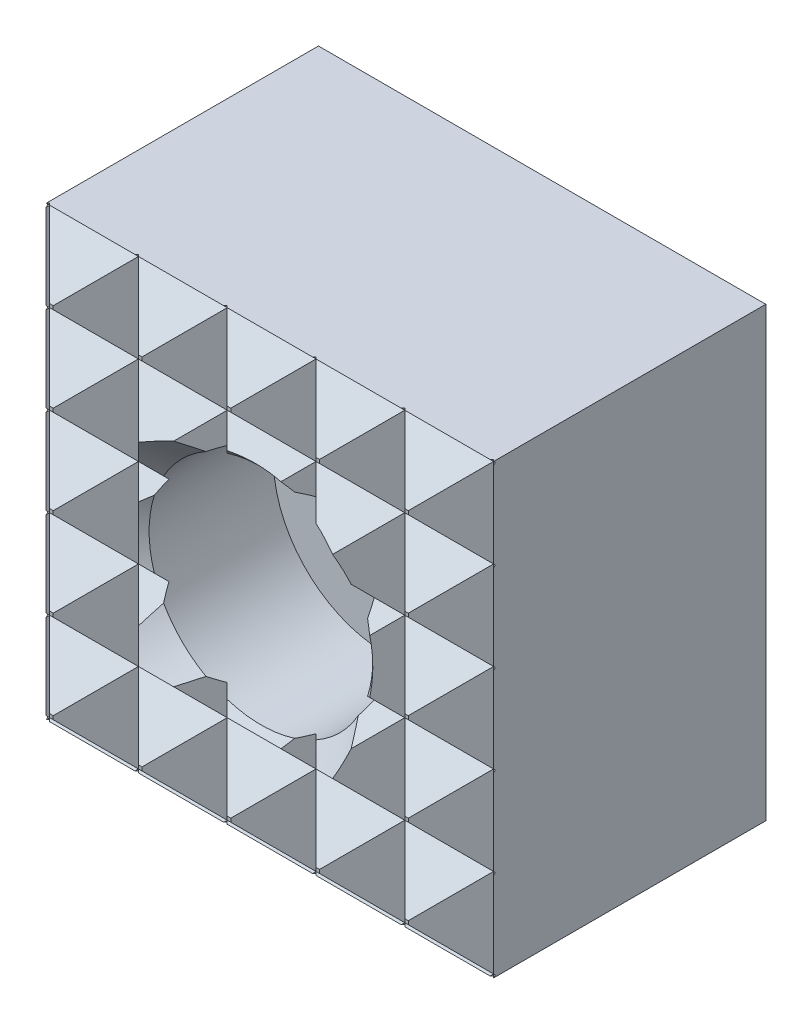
ISO-10303-21;
HEADER;
FILE_DESCRIPTION(('STEP AP214'),'2;1');
FILE_NAME('part.step','',(''),(''),'','','');
FILE_SCHEMA(('AUTOMOTIVE_DESIGN { 1 0 10303 214 1 1 1 1 }'));
ENDSEC;
DATA;
#1=APPLICATION_CONTEXT('core data for automotive mechanical design processes');
#2=APPLICATION_PROTOCOL_DEFINITION('international standard','automotive_design',2000,#1);
#3=PRODUCT_CONTEXT('',#1,'mechanical');
#4=PRODUCT('Part','Part','',(#3));
#5=PRODUCT_RELATED_PRODUCT_CATEGORY('part','',(#4));
#6=PRODUCT_DEFINITION_FORMATION('','',#4);
#7=PRODUCT_DEFINITION_CONTEXT('part definition',#1,'design');
#8=PRODUCT_DEFINITION('design','',#6,#7);
#9=PRODUCT_DEFINITION_SHAPE('','',#8);
#10=(LENGTH_UNIT() NAMED_UNIT(*) SI_UNIT(.MILLI.,.METRE.));
#11=(NAMED_UNIT(*) PLANE_ANGLE_UNIT() SI_UNIT($,.RADIAN.));
#12=(NAMED_UNIT(*) SI_UNIT($,.STERADIAN.) SOLID_ANGLE_UNIT());
#13=UNCERTAINTY_MEASURE_WITH_UNIT(LENGTH_MEASURE(1.E-05),#10,'distance_accuracy_value','');
#14=(GEOMETRIC_REPRESENTATION_CONTEXT(3) GLOBAL_UNCERTAINTY_ASSIGNED_CONTEXT((#13)) GLOBAL_UNIT_ASSIGNED_CONTEXT((#10,
#11,#12)) REPRESENTATION_CONTEXT('',''));
#15=CARTESIAN_POINT('',(0.,0.,0.));
#16=DIRECTION('',(0.,0.,1.));
#17=DIRECTION('',(1.,0.,0.));
#18=AXIS2_PLACEMENT_3D('',#15,#16,#17);
#19=CARTESIAN_POINT('',(-8.,8.,12.));
#20=DIRECTION('',(0.,0.,-1.));
#21=DIRECTION('',(-1.,0.,0.));
#22=AXIS2_PLACEMENT_3D('',#19,#20,#21);
#23=PLANE('',#22);
#24=DIRECTION('',(0.,1.,0.));
#25=VECTOR('',#24,1.);
#26=CARTESIAN_POINT('',(-6.41349999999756,8.,12.));
#27=LINE('',#26,#25);
#28=CARTESIAN_POINT('',(-6.41349999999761,-6.4134999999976,12.));
#29=VERTEX_POINT('',#28);
#30=CARTESIAN_POINT('',(-6.41349999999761,-6.2865000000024,12.));
#31=VERTEX_POINT('',#30);
#32=EDGE_CURVE('E761',#29,#31,#27,.T.);
#33=ORIENTED_EDGE('',*,*,#32,.F.);
#34=DIRECTION('',(-1.,0.,0.));
#35=VECTOR('',#34,1.);
#36=CARTESIAN_POINT('',(-8.,-6.4134999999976,12.));
#37=LINE('',#36,#35);
#38=CARTESIAN_POINT('',(-6.28650000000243,-6.4134999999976,12.));
#39=VERTEX_POINT('',#38);
#40=EDGE_CURVE('E1992',#39,#29,#37,.T.);
#41=ORIENTED_EDGE('',*,*,#40,.F.);
#42=DIRECTION('',(0.,-1.,0.));
#43=VECTOR('',#42,1.);
#44=CARTESIAN_POINT('',(-6.28650000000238,8.,12.));
#45=LINE('',#44,#43);
#46=CARTESIAN_POINT('',(-6.28650000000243,-6.2865000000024,12.));
#47=VERTEX_POINT('',#46);
#48=EDGE_CURVE('E878',#47,#39,#45,.T.);
#49=ORIENTED_EDGE('',*,*,#48,.F.);
#50=DIRECTION('',(1.,0.,0.));
#51=VECTOR('',#50,1.);
#52=CARTESIAN_POINT('',(-8.,-6.2865000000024,12.));
#53=LINE('',#52,#51);
#54=EDGE_CURVE('E1997',#31,#47,#53,.T.);
#55=ORIENTED_EDGE('',*,*,#54,.F.);
#56=EDGE_LOOP('',(#33,#41,#49,#55));
#57=FACE_BOUND('',#56,.T.);
#58=ADVANCED_FACE('F15',(#57),#23,.F.);
#59=CARTESIAN_POINT('',(-8.,-8.,0.));
#60=DIRECTION('',(0.,-1.,0.));
#61=DIRECTION('',(0.,0.,-1.));
#62=AXIS2_PLACEMENT_3D('',#59,#60,#61);
#63=PLANE('',#62);
#64=DIRECTION('',(0.707106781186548,0.,0.707106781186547));
#65=VECTOR('',#64,1.);
#66=CARTESIAN_POINT('',(-7.9375,-8.,10.4759999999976));
#67=LINE('',#66,#65);
#68=CARTESIAN_POINT('',(-7.9375,-8.,10.4759999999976));
#69=VERTEX_POINT('',#68);
#70=CARTESIAN_POINT('',(-7.875,-8.,10.5384999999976));
#71=VERTEX_POINT('',#70);
#72=EDGE_CURVE('E692',#69,#71,#67,.T.);
#73=ORIENTED_EDGE('',*,*,#72,.F.);
#74=DIRECTION('',(0.707106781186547,0.,-0.707106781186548));
#75=VECTOR('',#74,1.);
#76=CARTESIAN_POINT('',(-9.525,-8.,12.0634999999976));
#77=LINE('',#76,#75);
#78=CARTESIAN_POINT('',(-8.,-8.,10.5384999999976));
#79=VERTEX_POINT('',#78);
#80=EDGE_CURVE('E681',#79,#69,#77,.T.);
#81=ORIENTED_EDGE('',*,*,#80,.F.);
#82=DIRECTION('',(0.,0.,1.));
#83=VECTOR('',#82,1.);
#84=CARTESIAN_POINT('',(-8.,-8.,0.));
#85=LINE('',#84,#83);
#86=CARTESIAN_POINT('',(-8.,-8.,0.8));
#87=VERTEX_POINT('',#86);
#88=EDGE_CURVE('E1560',#87,#79,#85,.T.);
#89=ORIENTED_EDGE('',*,*,#88,.F.);
#90=DIRECTION('',(1.,0.,0.));
#91=VECTOR('',#90,1.);
#92=CARTESIAN_POINT('',(-8.,-8.,0.8));
#93=LINE('',#92,#91);
#94=CARTESIAN_POINT('',(8.,-8.,0.8));
#95=VERTEX_POINT('',#94);
#96=EDGE_CURVE('E1581',#87,#95,#93,.T.);
#97=ORIENTED_EDGE('',*,*,#96,.T.);
#98=DIRECTION('',(0.,0.,1.));
#99=VECTOR('',#98,1.);
#100=CARTESIAN_POINT('',(8.,-8.,0.));
#101=LINE('',#100,#99);
#102=CARTESIAN_POINT('',(8.,-8.,10.5384999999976));
#103=VERTEX_POINT('',#102);
#104=EDGE_CURVE('E1557',#95,#103,#101,.T.);
#105=ORIENTED_EDGE('',*,*,#104,.T.);
#106=DIRECTION('',(0.707106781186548,0.,0.707106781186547));
#107=VECTOR('',#106,1.);
#108=CARTESIAN_POINT('',(7.9375,-8.,10.4759999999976));
#109=LINE('',#108,#107);
#110=CARTESIAN_POINT('',(7.9375,-8.,10.4759999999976));
#111=VERTEX_POINT('',#110);
#112=EDGE_CURVE('E1245',#111,#103,#109,.T.);
#113=ORIENTED_EDGE('',*,*,#112,.F.);
#114=DIRECTION('',(0.707106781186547,0.,-0.707106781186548));
#115=VECTOR('',#114,1.);
#116=CARTESIAN_POINT('',(6.35,-8.,12.0634999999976));
#117=LINE('',#116,#115);
#118=CARTESIAN_POINT('',(7.875,-8.,10.5384999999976));
#119=VERTEX_POINT('',#118);
#120=EDGE_CURVE('E1243',#119,#111,#117,.T.);
#121=ORIENTED_EDGE('',*,*,#120,.F.);
#122=DIRECTION('',(-1.,0.,0.));
#123=VECTOR('',#122,1.);
#124=CARTESIAN_POINT('',(-8.,-8.,10.5384999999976));
#125=LINE('',#124,#123);
#126=CARTESIAN_POINT('',(4.825,-8.0000000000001,10.5384999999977));
#127=VERTEX_POINT('',#126);
#128=EDGE_CURVE('E1993',#119,#127,#125,.T.);
#129=ORIENTED_EDGE('',*,*,#128,.T.);
#130=DIRECTION('',(0.707106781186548,0.,0.707106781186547));
#131=VECTOR('',#130,1.);
#132=CARTESIAN_POINT('',(4.7625,-8.0000000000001,10.4759999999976));
#133=LINE('',#132,#131);
#134=CARTESIAN_POINT('',(4.7625,-8.0000000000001,10.4759999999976));
#135=VERTEX_POINT('',#134);
#136=EDGE_CURVE('E1125',#135,#127,#133,.T.);
#137=ORIENTED_EDGE('',*,*,#136,.F.);
#138=DIRECTION('',(0.707106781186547,0.,-0.707106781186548));
#139=VECTOR('',#138,1.);
#140=CARTESIAN_POINT('',(3.175,-8.00000000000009,12.0634999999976));
#141=LINE('',#140,#139);
#142=CARTESIAN_POINT('',(4.69999999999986,-8.0000000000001,10.5384999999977));
#143=VERTEX_POINT('',#142);
#144=EDGE_CURVE('E1117',#143,#135,#141,.T.);
#145=ORIENTED_EDGE('',*,*,#144,.F.);
#146=CARTESIAN_POINT('',(1.65,-8.00000000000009,10.5384999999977));
#147=VERTEX_POINT('',#146);
#148=EDGE_CURVE('E1996',#143,#147,#125,.T.);
#149=ORIENTED_EDGE('',*,*,#148,.T.);
#150=DIRECTION('',(0.707106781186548,0.,0.707106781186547));
#151=VECTOR('',#150,1.);
#152=CARTESIAN_POINT('',(1.5875,-8.00000000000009,10.4759999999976));
#153=LINE('',#152,#151);
#154=CARTESIAN_POINT('',(1.5875,-8.00000000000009,10.4759999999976));
#155=VERTEX_POINT('',#154);
#156=EDGE_CURVE('E1014',#155,#147,#153,.T.);
#157=ORIENTED_EDGE('',*,*,#156,.F.);
#158=DIRECTION('',(0.707106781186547,0.,-0.707106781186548));
#159=VECTOR('',#158,1.);
#160=CARTESIAN_POINT('',(0.,-8.,12.0634999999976));
#161=LINE('',#160,#159);
#162=CARTESIAN_POINT('',(1.52499999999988,-8.00000000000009,10.5384999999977));
#163=VERTEX_POINT('',#162);
#164=EDGE_CURVE('E1012',#163,#155,#161,.T.);
#165=ORIENTED_EDGE('',*,*,#164,.F.);
#166=CARTESIAN_POINT('',(-1.525,-8.,10.5384999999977));
#167=VERTEX_POINT('',#166);
#168=EDGE_CURVE('E3804',#163,#167,#125,.T.);
#169=ORIENTED_EDGE('',*,*,#168,.T.);
#170=DIRECTION('',(0.707106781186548,0.,0.707106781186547));
#171=VECTOR('',#170,1.);
#172=CARTESIAN_POINT('',(-1.5875,-8.,10.4759999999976));
#173=LINE('',#172,#171);
#174=CARTESIAN_POINT('',(-1.5875,-8.,10.4759999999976));
#175=VERTEX_POINT('',#174);
#176=EDGE_CURVE('E911',#175,#167,#173,.T.);
#177=ORIENTED_EDGE('',*,*,#176,.F.);
#178=DIRECTION('',(0.707106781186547,0.,-0.707106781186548));
#179=VECTOR('',#178,1.);
#180=CARTESIAN_POINT('',(-3.175,-8.,12.0634999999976));
#181=LINE('',#180,#179);
#182=CARTESIAN_POINT('',(-1.65000000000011,-8.,10.5384999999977));
#183=VERTEX_POINT('',#182);
#184=EDGE_CURVE('E909',#183,#175,#181,.T.);
#185=ORIENTED_EDGE('',*,*,#184,.F.);
#186=CARTESIAN_POINT('',(-4.7,-8.,10.5384999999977));
#187=VERTEX_POINT('',#186);
#188=EDGE_CURVE('E3798',#183,#187,#125,.T.);
#189=ORIENTED_EDGE('',*,*,#188,.T.);
#190=DIRECTION('',(0.707106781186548,0.,0.707106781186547));
#191=VECTOR('',#190,1.);
#192=CARTESIAN_POINT('',(-4.7625,-8.,10.4759999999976));
#193=LINE('',#192,#191);
#194=CARTESIAN_POINT('',(-4.7625,-8.,10.4759999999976));
#195=VERTEX_POINT('',#194);
#196=EDGE_CURVE('E792',#195,#187,#193,.T.);
#197=ORIENTED_EDGE('',*,*,#196,.F.);
#198=DIRECTION('',(0.707106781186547,0.,-0.707106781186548));
#199=VECTOR('',#198,1.);
#200=CARTESIAN_POINT('',(-6.35,-8.,12.0634999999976));
#201=LINE('',#200,#199);
#202=CARTESIAN_POINT('',(-4.82500000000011,-8.,10.5384999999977));
#203=VERTEX_POINT('',#202);
#204=EDGE_CURVE('E790',#203,#195,#201,.T.);
#205=ORIENTED_EDGE('',*,*,#204,.F.);
#206=EDGE_CURVE('E708',#203,#71,#125,.T.);
#207=ORIENTED_EDGE('',*,*,#206,.T.);
#208=EDGE_LOOP('',(#73,#81,#89,#97,#105,#113,#121,#129,#137,#145,#149,#157,#165,#169,#177,#185,
#189,#197,#205,#207));
#209=FACE_BOUND('',#208,.T.);
#210=ADVANCED_FACE('F705',(#209),#63,.T.);
#211=DIRECTION('',(0.,1.,0.));
#212=VECTOR('',#211,1.);
#213=CARTESIAN_POINT('',(-6.41349999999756,8.,12.));
#214=LINE('',#213,#212);
#215=CARTESIAN_POINT('',(-6.41349999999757,6.2865000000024,12.));
#216=VERTEX_POINT('',#215);
#217=CARTESIAN_POINT('',(-6.41349999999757,6.4134999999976,12.));
#218=VERTEX_POINT('',#217);
#219=EDGE_CURVE('E780',#216,#218,#214,.T.);
#220=ORIENTED_EDGE('',*,*,#219,.F.);
#221=DIRECTION('',(-1.,0.,0.));
#222=VECTOR('',#221,1.);
#223=CARTESIAN_POINT('',(-8.,6.2865000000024,12.));
#224=LINE('',#223,#222);
#225=CARTESIAN_POINT('',(-6.28650000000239,6.2865000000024,12.));
#226=VERTEX_POINT('',#225);
#227=EDGE_CURVE('E1618',#226,#216,#224,.T.);
#228=ORIENTED_EDGE('',*,*,#227,.F.);
#229=DIRECTION('',(0.,-1.,0.));
#230=VECTOR('',#229,1.);
#231=CARTESIAN_POINT('',(-6.28650000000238,8.,12.));
#232=LINE('',#231,#230);
#233=CARTESIAN_POINT('',(-6.28650000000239,6.4134999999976,12.));
#234=VERTEX_POINT('',#233);
#235=EDGE_CURVE('E897',#234,#226,#232,.T.);
#236=ORIENTED_EDGE('',*,*,#235,.F.);
#237=DIRECTION('',(1.,0.,0.));
#238=VECTOR('',#237,1.);
#239=CARTESIAN_POINT('',(-8.,6.4134999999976,12.));
#240=LINE('',#239,#238);
#241=EDGE_CURVE('E1606',#218,#234,#240,.T.);
#242=ORIENTED_EDGE('',*,*,#241,.F.);
#243=EDGE_LOOP('',(#220,#228,#236,#242));
#244=FACE_BOUND('',#243,.T.);
#245=ADVANCED_FACE('F1668',(#244),#23,.F.);
#246=CARTESIAN_POINT('',(-8.,8.,0.));
#247=DIRECTION('',(0.,1.,0.));
#248=DIRECTION('',(0.,0.,1.));
#249=AXIS2_PLACEMENT_3D('',#246,#247,#248);
#250=PLANE('',#249);
#251=DIRECTION('',(0.,0.,1.));
#252=VECTOR('',#251,1.);
#253=CARTESIAN_POINT('',(-8.,8.,0.));
#254=LINE('',#253,#252);
#255=CARTESIAN_POINT('',(-8.,8.,0.8));
#256=VERTEX_POINT('',#255);
#257=CARTESIAN_POINT('',(-8.,8.,10.5384999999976));
#258=VERTEX_POINT('',#257);
#259=EDGE_CURVE('E1550',#256,#258,#254,.T.);
#260=ORIENTED_EDGE('',*,*,#259,.T.);
#261=DIRECTION('',(0.707106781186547,0.,-0.707106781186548));
#262=VECTOR('',#261,1.);
#263=CARTESIAN_POINT('',(-9.525,8.,12.0634999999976));
#264=LINE('',#263,#262);
#265=CARTESIAN_POINT('',(-7.9375,8.,10.4759999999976));
#266=VERTEX_POINT('',#265);
#267=EDGE_CURVE('E712',#258,#266,#264,.T.);
#268=ORIENTED_EDGE('',*,*,#267,.T.);
#269=DIRECTION('',(0.707106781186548,0.,0.707106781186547));
#270=VECTOR('',#269,1.);
#271=CARTESIAN_POINT('',(-7.9375,8.,10.4759999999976));
#272=LINE('',#271,#270);
#273=CARTESIAN_POINT('',(-7.875,8.,10.5384999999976));
#274=VERTEX_POINT('',#273);
#275=EDGE_CURVE('E693',#266,#274,#272,.T.);
#276=ORIENTED_EDGE('',*,*,#275,.T.);
#277=DIRECTION('',(1.,0.,0.));
#278=VECTOR('',#277,1.);
#279=CARTESIAN_POINT('',(-8.,8.,10.5384999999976));
#280=LINE('',#279,#278);
#281=CARTESIAN_POINT('',(-4.825,8.,10.5384999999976));
#282=VERTEX_POINT('',#281);
#283=EDGE_CURVE('E1543',#274,#282,#280,.T.);
#284=ORIENTED_EDGE('',*,*,#283,.T.);
#285=DIRECTION('',(0.707106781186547,0.,-0.707106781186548));
#286=VECTOR('',#285,1.);
#287=CARTESIAN_POINT('',(-6.35,8.,12.0634999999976));
#288=LINE('',#287,#286);
#289=CARTESIAN_POINT('',(-4.7625,8.,10.4759999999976));
#290=VERTEX_POINT('',#289);
#291=EDGE_CURVE('E789',#282,#290,#288,.T.);
#292=ORIENTED_EDGE('',*,*,#291,.T.);
#293=DIRECTION('',(0.707106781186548,0.,0.707106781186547));
#294=VECTOR('',#293,1.);
#295=CARTESIAN_POINT('',(-4.7625,8.,10.4759999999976));
#296=LINE('',#295,#294);
#297=CARTESIAN_POINT('',(-4.7,8.,10.5384999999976));
#298=VERTEX_POINT('',#297);
#299=EDGE_CURVE('E793',#290,#298,#296,.T.);
#300=ORIENTED_EDGE('',*,*,#299,.T.);
#301=CARTESIAN_POINT('',(-1.65,8.,10.5384999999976));
#302=VERTEX_POINT('',#301);
#303=EDGE_CURVE('E1546',#298,#302,#280,.T.);
#304=ORIENTED_EDGE('',*,*,#303,.T.);
#305=DIRECTION('',(0.707106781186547,0.,-0.707106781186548));
#306=VECTOR('',#305,1.);
#307=CARTESIAN_POINT('',(-3.175,8.,12.0634999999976));
#308=LINE('',#307,#306);
#309=CARTESIAN_POINT('',(-1.5875,8.,10.4759999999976));
#310=VERTEX_POINT('',#309);
#311=EDGE_CURVE('E908',#302,#310,#308,.T.);
#312=ORIENTED_EDGE('',*,*,#311,.T.);
#313=DIRECTION('',(0.707106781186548,0.,0.707106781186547));
#314=VECTOR('',#313,1.);
#315=CARTESIAN_POINT('',(-1.5875,8.,10.4759999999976));
#316=LINE('',#315,#314);
#317=CARTESIAN_POINT('',(-1.525,8.,10.5384999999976));
#318=VERTEX_POINT('',#317);
#319=EDGE_CURVE('E912',#310,#318,#316,.T.);
#320=ORIENTED_EDGE('',*,*,#319,.T.);
#321=CARTESIAN_POINT('',(1.525,8.,10.5384999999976));
#322=VERTEX_POINT('',#321);
#323=EDGE_CURVE('E1855',#318,#322,#280,.T.);
#324=ORIENTED_EDGE('',*,*,#323,.T.);
#325=DIRECTION('',(0.707106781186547,0.,-0.707106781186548));
#326=VECTOR('',#325,1.);
#327=CARTESIAN_POINT('',(0.,8.,12.0634999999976));
#328=LINE('',#327,#326);
#329=CARTESIAN_POINT('',(1.5875,8.,10.4759999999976));
#330=VERTEX_POINT('',#329);
#331=EDGE_CURVE('E1011',#322,#330,#328,.T.);
#332=ORIENTED_EDGE('',*,*,#331,.T.);
#333=DIRECTION('',(0.707106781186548,0.,0.707106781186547));
#334=VECTOR('',#333,1.);
#335=CARTESIAN_POINT('',(1.5875,8.,10.4759999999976));
#336=LINE('',#335,#334);
#337=CARTESIAN_POINT('',(1.65,8.,10.5384999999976));
#338=VERTEX_POINT('',#337);
#339=EDGE_CURVE('E1015',#330,#338,#336,.T.);
#340=ORIENTED_EDGE('',*,*,#339,.T.);
#341=CARTESIAN_POINT('',(4.7,8.,10.5384999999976));
#342=VERTEX_POINT('',#341);
#343=EDGE_CURVE('E1854',#338,#342,#280,.T.);
#344=ORIENTED_EDGE('',*,*,#343,.T.);
#345=DIRECTION('',(0.707106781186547,0.,-0.707106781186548));
#346=VECTOR('',#345,1.);
#347=CARTESIAN_POINT('',(3.175,8.,12.0634999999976));
#348=LINE('',#347,#346);
#349=CARTESIAN_POINT('',(4.7625,8.,10.4759999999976));
#350=VERTEX_POINT('',#349);
#351=EDGE_CURVE('E1114',#342,#350,#348,.T.);
#352=ORIENTED_EDGE('',*,*,#351,.T.);
#353=DIRECTION('',(0.707106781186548,0.,0.707106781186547));
#354=VECTOR('',#353,1.);
#355=CARTESIAN_POINT('',(4.7625,8.,10.4759999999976));
#356=LINE('',#355,#354);
#357=CARTESIAN_POINT('',(4.825,8.,10.5384999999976));
#358=VERTEX_POINT('',#357);
#359=EDGE_CURVE('E1120',#350,#358,#356,.T.);
#360=ORIENTED_EDGE('',*,*,#359,.T.);
#361=CARTESIAN_POINT('',(7.875,8.,10.5384999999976));
#362=VERTEX_POINT('',#361);
#363=EDGE_CURVE('E1541',#358,#362,#280,.T.);
#364=ORIENTED_EDGE('',*,*,#363,.T.);
#365=DIRECTION('',(0.707106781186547,0.,-0.707106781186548));
#366=VECTOR('',#365,1.);
#367=CARTESIAN_POINT('',(6.35,8.,12.0634999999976));
#368=LINE('',#367,#366);
#369=CARTESIAN_POINT('',(7.9375,8.,10.4759999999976));
#370=VERTEX_POINT('',#369);
#371=EDGE_CURVE('E1242',#362,#370,#368,.T.);
#372=ORIENTED_EDGE('',*,*,#371,.T.);
#373=DIRECTION('',(0.707106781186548,0.,0.707106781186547));
#374=VECTOR('',#373,1.);
#375=CARTESIAN_POINT('',(7.9375,8.,10.4759999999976));
#376=LINE('',#375,#374);
#377=CARTESIAN_POINT('',(8.,8.,10.5384999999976));
#378=VERTEX_POINT('',#377);
#379=EDGE_CURVE('E1246',#370,#378,#376,.T.);
#380=ORIENTED_EDGE('',*,*,#379,.T.);
#381=DIRECTION('',(0.,0.,1.));
#382=VECTOR('',#381,1.);
#383=CARTESIAN_POINT('',(8.,8.,0.));
#384=LINE('',#383,#382);
#385=CARTESIAN_POINT('',(8.,8.,0.8));
#386=VERTEX_POINT('',#385);
#387=EDGE_CURVE('E1554',#386,#378,#384,.T.);
#388=ORIENTED_EDGE('',*,*,#387,.F.);
#389=DIRECTION('',(-1.,0.,0.));
#390=VECTOR('',#389,1.);
#391=CARTESIAN_POINT('',(-8.,8.,0.8));
#392=LINE('',#391,#390);
#393=EDGE_CURVE('E1585',#386,#256,#392,.T.);
#394=ORIENTED_EDGE('',*,*,#393,.T.);
#395=EDGE_LOOP('',(#260,#268,#276,#284,#292,#300,#304,#312,#320,#324,#332,#340,#344,#352,#360,
#364,#372,#380,#388,#394));
#396=FACE_BOUND('',#395,.T.);
#397=ADVANCED_FACE('F1640',(#396),#250,.T.);
#398=CARTESIAN_POINT('',(8.,6.35,12.0634999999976));
#399=DIRECTION('',(0.,0.707106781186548,0.707106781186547));
#400=DIRECTION('',(0.,-0.707106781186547,0.707106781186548));
#401=AXIS2_PLACEMENT_3D('',#398,#399,#400);
#402=PLANE('',#401);
#403=DIRECTION('',(0.,0.707106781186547,-0.707106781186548));
#404=VECTOR('',#403,1.);
#405=CARTESIAN_POINT('',(-8.,6.35,12.0634999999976));
#406=LINE('',#405,#404);
#407=CARTESIAN_POINT('',(-8.,7.875,10.5384999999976));
#408=VERTEX_POINT('',#407);
#409=CARTESIAN_POINT('',(-8.,7.9375,10.4759999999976));
#410=VERTEX_POINT('',#409);
#411=EDGE_CURVE('E1533',#408,#410,#406,.T.);
#412=ORIENTED_EDGE('',*,*,#411,.F.);
#413=DIRECTION('',(0.577350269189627,0.577350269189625,-0.577350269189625));
#414=VECTOR('',#413,1.);
#415=CARTESIAN_POINT('',(-3.68333333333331,12.1916666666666,6.22183333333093));
#416=LINE('',#415,#414);
#417=CARTESIAN_POINT('',(-7.9375,7.9375,10.4759999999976));
#418=VERTEX_POINT('',#417);
#419=EDGE_CURVE('E31',#408,#418,#416,.T.);
#420=ORIENTED_EDGE('',*,*,#419,.T.);
#421=DIRECTION('',(-1.,0.,0.));
#422=VECTOR('',#421,1.);
#423=CARTESIAN_POINT('',(8.,7.9375,10.4759999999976));
#424=LINE('',#423,#422);
#425=EDGE_CURVE('E1532',#418,#410,#424,.T.);
#426=ORIENTED_EDGE('',*,*,#425,.T.);
#427=EDGE_LOOP('',(#412,#420,#426));
#428=FACE_BOUND('',#427,.T.);
#429=ADVANCED_FACE('F1637',(#428),#402,.T.);
#430=CARTESIAN_POINT('',(-4.7625,7.9375,10.4759999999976));
#431=VERTEX_POINT('',#430);
#432=EDGE_CURVE('E1813',#431,#418,#424,.T.);
#433=ORIENTED_EDGE('',*,*,#432,.T.);
#434=DIRECTION('',(0.577350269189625,-0.577350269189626,0.577350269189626));
#435=VECTOR('',#434,1.);
#436=CARTESIAN_POINT('',(-1.56666666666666,1.56666666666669,16.8468333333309));
#437=LINE('',#436,#435);
#438=EDGE_CURVE('E783',#418,#218,#437,.T.);
#439=ORIENTED_EDGE('',*,*,#438,.T.);
#440=ORIENTED_EDGE('',*,*,#241,.T.);
#441=DIRECTION('',(0.577350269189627,0.577350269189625,-0.577350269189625));
#442=VECTOR('',#441,1.);
#443=CARTESIAN_POINT('',(-1.56666666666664,11.1333333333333,7.28016666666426));
#444=LINE('',#443,#442);
#445=EDGE_CURVE('E902',#234,#431,#444,.T.);
#446=ORIENTED_EDGE('',*,*,#445,.T.);
#447=EDGE_LOOP('',(#433,#439,#440,#446));
#448=FACE_BOUND('',#447,.T.);
#449=ADVANCED_FACE('F1634',(#448),#402,.T.);
#450=CARTESIAN_POINT('',(8.,7.9375,10.4759999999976));
#451=DIRECTION('',(0.,-0.707106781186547,0.707106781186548));
#452=DIRECTION('',(0.,-0.707106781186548,-0.707106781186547));
#453=AXIS2_PLACEMENT_3D('',#450,#451,#452);
#454=PLANE('',#453);
#455=ORIENTED_EDGE('',*,*,#425,.F.);
#456=DIRECTION('',(-0.577350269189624,0.577350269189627,0.577350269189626));
#457=VECTOR('',#456,1.);
#458=CARTESIAN_POINT('',(-2.625,2.625,5.16349999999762));
#459=LINE('',#458,#457);
#460=EDGE_CURVE('E723',#418,#258,#459,.T.);
#461=ORIENTED_EDGE('',*,*,#460,.T.);
#462=DIRECTION('',(0.,0.707106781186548,0.707106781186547));
#463=VECTOR('',#462,1.);
#464=CARTESIAN_POINT('',(-8.,7.9375,10.4759999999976));
#465=LINE('',#464,#463);
#466=EDGE_CURVE('E1529',#410,#258,#465,.T.);
#467=ORIENTED_EDGE('',*,*,#466,.F.);
#468=EDGE_LOOP('',(#455,#461,#467));
#469=FACE_BOUND('',#468,.T.);
#470=ADVANCED_FACE('F1630',(#469),#454,.T.);
#471=ORIENTED_EDGE('',*,*,#283,.F.);
#472=DIRECTION('',(-0.577350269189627,-0.577350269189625,-0.577350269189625));
#473=VECTOR('',#472,1.);
#474=CARTESIAN_POINT('',(-2.62499999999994,13.25,15.7884999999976));
#475=LINE('',#474,#473);
#476=EDGE_CURVE('E786',#274,#418,#475,.T.);
#477=ORIENTED_EDGE('',*,*,#476,.T.);
#478=ORIENTED_EDGE('',*,*,#432,.F.);
#479=DIRECTION('',(-0.577350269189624,0.577350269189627,0.577350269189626));
#480=VECTOR('',#479,1.);
#481=CARTESIAN_POINT('',(-0.50833333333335,3.68333333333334,6.22183333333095));
#482=LINE('',#481,#480);
#483=EDGE_CURVE('E905',#431,#282,#482,.T.);
#484=ORIENTED_EDGE('',*,*,#483,.T.);
#485=EDGE_LOOP('',(#471,#477,#478,#484));
#486=FACE_BOUND('',#485,.T.);
#487=ADVANCED_FACE('F1633',(#486),#454,.T.);
#488=CARTESIAN_POINT('',(8.,4.7625,10.4759999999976));
#489=DIRECTION('',(0.,-0.707106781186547,0.707106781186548));
#490=DIRECTION('',(0.,-0.707106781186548,-0.707106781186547));
#491=AXIS2_PLACEMENT_3D('',#488,#489,#490);
#492=PLANE('',#491);
#493=DIRECTION('',(-1.,0.,0.));
#494=VECTOR('',#493,1.);
#495=CARTESIAN_POINT('',(8.,4.7625,10.4759999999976));
#496=LINE('',#495,#494);
#497=CARTESIAN_POINT('',(-7.9375,4.7625,10.4759999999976));
#498=VERTEX_POINT('',#497);
#499=CARTESIAN_POINT('',(-8.,4.7625,10.4759999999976));
#500=VERTEX_POINT('',#499);
#501=EDGE_CURVE('E1513',#498,#500,#496,.T.);
#502=ORIENTED_EDGE('',*,*,#501,.F.);
#503=DIRECTION('',(-0.577350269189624,0.577350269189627,0.577350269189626));
#504=VECTOR('',#503,1.);
#505=CARTESIAN_POINT('',(-2.625,-0.55,5.16349999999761));
#506=LINE('',#505,#504);
#507=CARTESIAN_POINT('',(-8.,4.825,10.5384999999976));
#508=VERTEX_POINT('',#507);
#509=EDGE_CURVE('E700',#498,#508,#506,.T.);
#510=ORIENTED_EDGE('',*,*,#509,.T.);
#511=DIRECTION('',(0.,0.707106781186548,0.707106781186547));
#512=VECTOR('',#511,1.);
#513=CARTESIAN_POINT('',(-8.,4.7625,10.4759999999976));
#514=LINE('',#513,#512);
#515=EDGE_CURVE('E1510',#500,#508,#514,.T.);
#516=ORIENTED_EDGE('',*,*,#515,.F.);
#517=EDGE_LOOP('',(#502,#510,#516));
#518=FACE_BOUND('',#517,.T.);
#519=ADVANCED_FACE('F1480',(#518),#492,.T.);
#520=ORIENTED_EDGE('',*,*,#227,.T.);
#521=DIRECTION('',(-0.577350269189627,-0.577350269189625,-0.577350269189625));
#522=VECTOR('',#521,1.);
#523=CARTESIAN_POINT('',(-2.625,10.075,15.7884999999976));
#524=LINE('',#523,#522);
#525=EDGE_CURVE('E777',#216,#498,#524,.T.);
#526=ORIENTED_EDGE('',*,*,#525,.T.);
#527=CARTESIAN_POINT('',(-4.7625,4.7625,10.4759999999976));
#528=VERTEX_POINT('',#527);
#529=EDGE_CURVE('E3500',#528,#498,#496,.T.);
#530=ORIENTED_EDGE('',*,*,#529,.F.);
#531=DIRECTION('',(-0.577350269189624,0.577350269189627,0.577350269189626));
#532=VECTOR('',#531,1.);
#533=CARTESIAN_POINT('',(-0.50833333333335,0.50833333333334,6.22183333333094));
#534=LINE('',#533,#532);
#535=EDGE_CURVE('E894',#528,#226,#534,.T.);
#536=ORIENTED_EDGE('',*,*,#535,.T.);
#537=EDGE_LOOP('',(#520,#526,#530,#536));
#538=FACE_BOUND('',#537,.T.);
#539=ADVANCED_FACE('F1627',(#538),#492,.T.);
#540=CARTESIAN_POINT('',(8.,3.175,12.0634999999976));
#541=DIRECTION('',(0.,0.707106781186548,0.707106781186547));
#542=DIRECTION('',(0.,-0.707106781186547,0.707106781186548));
#543=AXIS2_PLACEMENT_3D('',#540,#541,#542);
#544=PLANE('',#543);
#545=DIRECTION('',(0.,0.707106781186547,-0.707106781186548));
#546=VECTOR('',#545,1.);
#547=CARTESIAN_POINT('',(-8.,3.175,12.0634999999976));
#548=LINE('',#547,#546);
#549=CARTESIAN_POINT('',(-8.,4.7,10.5384999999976));
#550=VERTEX_POINT('',#549);
#551=EDGE_CURVE('E1514',#550,#500,#548,.T.);
#552=ORIENTED_EDGE('',*,*,#551,.F.);
#553=DIRECTION('',(0.577350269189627,0.577350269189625,-0.577350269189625));
#554=VECTOR('',#553,1.);
#555=CARTESIAN_POINT('',(-3.68333333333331,9.01666666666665,6.22183333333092));
#556=LINE('',#555,#554);
#557=EDGE_CURVE('E720',#550,#498,#556,.T.);
#558=ORIENTED_EDGE('',*,*,#557,.T.);
#559=ORIENTED_EDGE('',*,*,#501,.T.);
#560=EDGE_LOOP('',(#552,#558,#559));
#561=FACE_BOUND('',#560,.T.);
#562=ADVANCED_FACE('F1622',(#561),#544,.T.);
#563=ORIENTED_EDGE('',*,*,#529,.T.);
#564=DIRECTION('',(0.577350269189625,-0.577350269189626,0.577350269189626));
#565=VECTOR('',#564,1.);
#566=CARTESIAN_POINT('',(-1.56666666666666,-1.60833333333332,16.8468333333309));
#567=LINE('',#566,#565);
#568=CARTESIAN_POINT('',(-6.41349999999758,3.2384999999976,12.));
#569=VERTEX_POINT('',#568);
#570=EDGE_CURVE('E774',#498,#569,#567,.T.);
#571=ORIENTED_EDGE('',*,*,#570,.T.);
#572=DIRECTION('',(1.,0.,0.));
#573=VECTOR('',#572,1.);
#574=CARTESIAN_POINT('',(-8.,3.2384999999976,12.));
#575=LINE('',#574,#573);
#576=CARTESIAN_POINT('',(-6.2865000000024,3.2384999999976,12.));
#577=VERTEX_POINT('',#576);
#578=EDGE_CURVE('E1525',#569,#577,#575,.T.);
#579=ORIENTED_EDGE('',*,*,#578,.T.);
#580=DIRECTION('',(0.577350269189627,0.577350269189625,-0.577350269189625));
#581=VECTOR('',#580,1.);
#582=CARTESIAN_POINT('',(-1.56666666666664,7.95833333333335,7.28016666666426));
#583=LINE('',#582,#581);
#584=EDGE_CURVE('E891',#577,#528,#583,.T.);
#585=ORIENTED_EDGE('',*,*,#584,.T.);
#586=EDGE_LOOP('',(#563,#571,#579,#585));
#587=FACE_BOUND('',#586,.T.);
#588=ADVANCED_FACE('F1626',(#587),#544,.T.);
#589=CARTESIAN_POINT('',(8.,-6.35,12.0634999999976));
#590=DIRECTION('',(0.,0.707106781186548,0.707106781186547));
#591=DIRECTION('',(0.,-0.707106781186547,0.707106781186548));
#592=AXIS2_PLACEMENT_3D('',#589,#590,#591);
#593=PLANE('',#592);
#594=DIRECTION('',(0.,0.707106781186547,-0.707106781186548));
#595=VECTOR('',#594,1.);
#596=CARTESIAN_POINT('',(-8.,-6.35,12.0634999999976));
#597=LINE('',#596,#595);
#598=CARTESIAN_POINT('',(-8.,-4.825,10.5384999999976));
#599=VERTEX_POINT('',#598);
#600=CARTESIAN_POINT('',(-8.,-4.7625,10.4759999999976));
#601=VERTEX_POINT('',#600);
#602=EDGE_CURVE('E1355',#599,#601,#597,.T.);
#603=ORIENTED_EDGE('',*,*,#602,.F.);
#604=DIRECTION('',(0.577350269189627,0.577350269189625,-0.577350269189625));
#605=VECTOR('',#604,1.);
#606=CARTESIAN_POINT('',(-3.68333333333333,-0.50833333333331,6.22183333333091));
#607=LINE('',#606,#605);
#608=CARTESIAN_POINT('',(-7.9375,-4.7625,10.4759999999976));
#609=VERTEX_POINT('',#608);
#610=EDGE_CURVE('E741',#599,#609,#607,.T.);
#611=ORIENTED_EDGE('',*,*,#610,.T.);
#612=DIRECTION('',(-1.,0.,0.));
#613=VECTOR('',#612,1.);
#614=CARTESIAN_POINT('',(8.,-4.7625,10.4759999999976));
#615=LINE('',#614,#613);
#616=EDGE_CURVE('E1363',#609,#601,#615,.T.);
#617=ORIENTED_EDGE('',*,*,#616,.T.);
#618=EDGE_LOOP('',(#603,#611,#617));
#619=FACE_BOUND('',#618,.T.);
#620=ADVANCED_FACE('F1412',(#619),#593,.T.);
#621=CARTESIAN_POINT('',(-4.7625,-4.7625,10.4759999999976));
#622=VERTEX_POINT('',#621);
#623=EDGE_CURVE('E1770',#622,#609,#615,.T.);
#624=ORIENTED_EDGE('',*,*,#623,.T.);
#625=DIRECTION('',(0.577350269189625,-0.577350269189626,0.577350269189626));
#626=VECTOR('',#625,1.);
#627=CARTESIAN_POINT('',(-1.56666666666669,-11.1333333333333,16.846833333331));
#628=LINE('',#627,#626);
#629=EDGE_CURVE('E758',#609,#31,#628,.T.);
#630=ORIENTED_EDGE('',*,*,#629,.T.);
#631=ORIENTED_EDGE('',*,*,#54,.T.);
#632=DIRECTION('',(0.577350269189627,0.577350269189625,-0.577350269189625));
#633=VECTOR('',#632,1.);
#634=CARTESIAN_POINT('',(-1.56666666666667,-1.56666666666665,7.28016666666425));
#635=LINE('',#634,#633);
#636=EDGE_CURVE('E875',#47,#622,#635,.T.);
#637=ORIENTED_EDGE('',*,*,#636,.T.);
#638=EDGE_LOOP('',(#624,#630,#631,#637));
#639=FACE_BOUND('',#638,.T.);
#640=ADVANCED_FACE('F2014',(#639),#593,.T.);
#641=CARTESIAN_POINT('',(8.,-4.7625,10.4759999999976));
#642=DIRECTION('',(0.,-0.707106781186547,0.707106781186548));
#643=DIRECTION('',(0.,-0.707106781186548,-0.707106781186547));
#644=AXIS2_PLACEMENT_3D('',#641,#642,#643);
#645=PLANE('',#644);
#646=ORIENTED_EDGE('',*,*,#616,.F.);
#647=DIRECTION('',(-0.577350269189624,0.577350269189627,0.577350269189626));
#648=VECTOR('',#647,1.);
#649=CARTESIAN_POINT('',(-2.625,-10.075,5.1634999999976));
#650=LINE('',#649,#648);
#651=CARTESIAN_POINT('',(-8.,-4.7,10.5384999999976));
#652=VERTEX_POINT('',#651);
#653=EDGE_CURVE('E738',#609,#652,#650,.T.);
#654=ORIENTED_EDGE('',*,*,#653,.T.);
#655=DIRECTION('',(0.,0.707106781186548,0.707106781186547));
#656=VECTOR('',#655,1.);
#657=CARTESIAN_POINT('',(-8.,-4.7625,10.4759999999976));
#658=LINE('',#657,#656);
#659=EDGE_CURVE('E1360',#601,#652,#658,.T.);
#660=ORIENTED_EDGE('',*,*,#659,.F.);
#661=EDGE_LOOP('',(#646,#654,#660));
#662=FACE_BOUND('',#661,.T.);
#663=ADVANCED_FACE('F1784',(#662),#645,.T.);
#664=DIRECTION('',(-1.,0.,0.));
#665=VECTOR('',#664,1.);
#666=CARTESIAN_POINT('',(-8.,-3.2384999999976,12.));
#667=LINE('',#666,#665);
#668=CARTESIAN_POINT('',(-6.28650000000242,-3.2384999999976,12.));
#669=VERTEX_POINT('',#668);
#670=CARTESIAN_POINT('',(-6.4134999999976,-3.2384999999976,12.));
#671=VERTEX_POINT('',#670);
#672=EDGE_CURVE('E1371',#669,#671,#667,.T.);
#673=ORIENTED_EDGE('',*,*,#672,.T.);
#674=DIRECTION('',(-0.577350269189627,-0.577350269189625,-0.577350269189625));
#675=VECTOR('',#674,1.);
#676=CARTESIAN_POINT('',(-2.625,0.55,15.7884999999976));
#677=LINE('',#676,#675);
#678=EDGE_CURVE('E755',#671,#609,#677,.T.);
#679=ORIENTED_EDGE('',*,*,#678,.T.);
#680=ORIENTED_EDGE('',*,*,#623,.F.);
#681=DIRECTION('',(-0.577350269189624,0.577350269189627,0.577350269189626));
#682=VECTOR('',#681,1.);
#683=CARTESIAN_POINT('',(-0.50833333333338,-9.01666666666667,6.22183333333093));
#684=LINE('',#683,#682);
#685=EDGE_CURVE('E872',#622,#669,#684,.T.);
#686=ORIENTED_EDGE('',*,*,#685,.T.);
#687=EDGE_LOOP('',(#673,#679,#680,#686));
#688=FACE_BOUND('',#687,.T.);
#689=ADVANCED_FACE('F2013',(#688),#645,.T.);
#690=CARTESIAN_POINT('',(8.,-7.9375,10.4759999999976));
#691=DIRECTION('',(0.,-0.707106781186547,0.707106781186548));
#692=DIRECTION('',(0.,-0.707106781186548,-0.707106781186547));
#693=AXIS2_PLACEMENT_3D('',#690,#691,#692);
#694=PLANE('',#693);
#695=DIRECTION('',(-1.,0.,0.));
#696=VECTOR('',#695,1.);
#697=CARTESIAN_POINT('',(8.,-7.9375,10.4759999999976));
#698=LINE('',#697,#696);
#699=CARTESIAN_POINT('',(-7.9375,-7.9375,10.4759999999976));
#700=VERTEX_POINT('',#699);
#701=CARTESIAN_POINT('',(-8.,-7.9375,10.4759999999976));
#702=VERTEX_POINT('',#701);
#703=EDGE_CURVE('E1347',#700,#702,#698,.T.);
#704=ORIENTED_EDGE('',*,*,#703,.F.);
#705=DIRECTION('',(-0.577350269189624,0.577350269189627,0.577350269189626));
#706=VECTOR('',#705,1.);
#707=CARTESIAN_POINT('',(-2.62500000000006,-13.25,5.1634999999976));
#708=LINE('',#707,#706);
#709=CARTESIAN_POINT('',(-8.,-7.875,10.5384999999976));
#710=VERTEX_POINT('',#709);
#711=EDGE_CURVE('E744',#700,#710,#708,.T.);
#712=ORIENTED_EDGE('',*,*,#711,.T.);
#713=DIRECTION('',(0.,0.707106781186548,0.707106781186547));
#714=VECTOR('',#713,1.);
#715=CARTESIAN_POINT('',(-8.,-7.9375,10.4759999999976));
#716=LINE('',#715,#714);
#717=EDGE_CURVE('E1344',#702,#710,#716,.T.);
#718=ORIENTED_EDGE('',*,*,#717,.F.);
#719=EDGE_LOOP('',(#704,#712,#718));
#720=FACE_BOUND('',#719,.T.);
#721=ADVANCED_FACE('F2021',(#720),#694,.T.);
#722=ORIENTED_EDGE('',*,*,#40,.T.);
#723=DIRECTION('',(-0.577350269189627,-0.577350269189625,-0.577350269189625));
#724=VECTOR('',#723,1.);
#725=CARTESIAN_POINT('',(-2.625,-2.625,15.7884999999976));
#726=LINE('',#725,#724);
#727=EDGE_CURVE('E771',#29,#700,#726,.T.);
#728=ORIENTED_EDGE('',*,*,#727,.T.);
#729=CARTESIAN_POINT('',(-4.7625,-7.9375,10.4759999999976));
#730=VERTEX_POINT('',#729);
#731=EDGE_CURVE('E3737',#730,#700,#698,.T.);
#732=ORIENTED_EDGE('',*,*,#731,.F.);
#733=DIRECTION('',(-0.577350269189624,0.577350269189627,0.577350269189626));
#734=VECTOR('',#733,1.);
#735=CARTESIAN_POINT('',(-0.50833333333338,-12.1916666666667,6.22183333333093));
#736=LINE('',#735,#734);
#737=EDGE_CURVE('E888',#730,#39,#736,.T.);
#738=ORIENTED_EDGE('',*,*,#737,.T.);
#739=EDGE_LOOP('',(#722,#728,#732,#738));
#740=FACE_BOUND('',#739,.T.);
#741=ADVANCED_FACE('F2019',(#740),#694,.T.);
#742=CARTESIAN_POINT('',(8.,-9.525,12.0634999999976));
#743=DIRECTION('',(0.,0.707106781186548,0.707106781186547));
#744=DIRECTION('',(0.,-0.707106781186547,0.707106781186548));
#745=AXIS2_PLACEMENT_3D('',#742,#743,#744);
#746=PLANE('',#745);
#747=DIRECTION('',(0.,0.707106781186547,-0.707106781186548));
#748=VECTOR('',#747,1.);
#749=CARTESIAN_POINT('',(-8.,-9.525,12.0634999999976));
#750=LINE('',#749,#748);
#751=EDGE_CURVE('E1340',#79,#702,#750,.T.);
#752=ORIENTED_EDGE('',*,*,#751,.F.);
#753=DIRECTION('',(0.577350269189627,0.577350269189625,-0.577350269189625));
#754=VECTOR('',#753,1.);
#755=CARTESIAN_POINT('',(-3.68333333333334,-3.68333333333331,6.22183333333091));
#756=LINE('',#755,#754);
#757=EDGE_CURVE('E687',#79,#700,#756,.T.);
#758=ORIENTED_EDGE('',*,*,#757,.T.);
#759=ORIENTED_EDGE('',*,*,#703,.T.);
#760=EDGE_LOOP('',(#752,#758,#759));
#761=FACE_BOUND('',#760,.T.);
#762=ADVANCED_FACE('F2015',(#761),#746,.T.);
#763=ORIENTED_EDGE('',*,*,#731,.T.);
#764=DIRECTION('',(0.577350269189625,-0.577350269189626,0.577350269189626));
#765=VECTOR('',#764,1.);
#766=CARTESIAN_POINT('',(-1.56666666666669,-14.3083333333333,16.846833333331));
#767=LINE('',#766,#765);
#768=EDGE_CURVE('E698',#700,#71,#767,.T.);
#769=ORIENTED_EDGE('',*,*,#768,.T.);
#770=ORIENTED_EDGE('',*,*,#206,.F.);
#771=DIRECTION('',(0.577350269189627,0.577350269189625,-0.577350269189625));
#772=VECTOR('',#771,1.);
#773=CARTESIAN_POINT('',(-1.56666666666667,-4.74166666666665,7.28016666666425));
#774=LINE('',#773,#772);
#775=EDGE_CURVE('E899',#203,#730,#774,.T.);
#776=ORIENTED_EDGE('',*,*,#775,.T.);
#777=EDGE_LOOP('',(#763,#769,#770,#776));
#778=FACE_BOUND('',#777,.T.);
#779=ADVANCED_FACE('F2018',(#778),#746,.T.);
#780=DIRECTION('',(0.,1.,0.));
#781=VECTOR('',#780,1.);
#782=CARTESIAN_POINT('',(-6.41349999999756,8.,12.));
#783=LINE('',#782,#781);
#784=CARTESIAN_POINT('',(-6.4134999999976,-3.1115000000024,12.));
#785=VERTEX_POINT('',#784);
#786=EDGE_CURVE('E753',#671,#785,#783,.T.);
#787=ORIENTED_EDGE('',*,*,#786,.F.);
#788=ORIENTED_EDGE('',*,*,#672,.F.);
#789=DIRECTION('',(0.,-1.,0.));
#790=VECTOR('',#789,1.);
#791=CARTESIAN_POINT('',(-6.28650000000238,8.,12.));
#792=LINE('',#791,#790);
#793=CARTESIAN_POINT('',(-6.28650000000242,-3.1115000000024,12.));
#794=VERTEX_POINT('',#793);
#795=EDGE_CURVE('E870',#794,#669,#792,.T.);
#796=ORIENTED_EDGE('',*,*,#795,.F.);
#797=DIRECTION('',(1.,0.,0.));
#798=VECTOR('',#797,1.);
#799=CARTESIAN_POINT('',(-8.,-3.1115000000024,12.));
#800=LINE('',#799,#798);
#801=EDGE_CURVE('E1436',#785,#794,#800,.T.);
#802=ORIENTED_EDGE('',*,*,#801,.F.);
#803=EDGE_LOOP('',(#787,#788,#796,#802));
#804=FACE_BOUND('',#803,.T.);
#805=ADVANCED_FACE('F3347',(#804),#23,.F.);
#806=DIRECTION('',(0.,1.,0.));
#807=VECTOR('',#806,1.);
#808=CARTESIAN_POINT('',(-6.41349999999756,8.,12.));
#809=LINE('',#808,#807);
#810=CARTESIAN_POINT('',(-6.41349999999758,-0.0634999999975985,12.));
#811=VERTEX_POINT('',#810);
#812=CARTESIAN_POINT('',(-6.41349999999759,0.0634999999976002,12.));
#813=VERTEX_POINT('',#812);
#814=EDGE_CURVE('E751',#811,#813,#809,.T.);
#815=ORIENTED_EDGE('',*,*,#814,.F.);
#816=DIRECTION('',(-1.,0.,0.));
#817=VECTOR('',#816,1.);
#818=CARTESIAN_POINT('',(-8.,-0.0634999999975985,12.));
#819=LINE('',#818,#817);
#820=CARTESIAN_POINT('',(-6.28650000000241,-0.0634999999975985,12.));
#821=VERTEX_POINT('',#820);
#822=EDGE_CURVE('E1400',#821,#811,#819,.T.);
#823=ORIENTED_EDGE('',*,*,#822,.F.);
#824=DIRECTION('',(0.,-1.,0.));
#825=VECTOR('',#824,1.);
#826=CARTESIAN_POINT('',(-6.28650000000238,8.,12.));
#827=LINE('',#826,#825);
#828=CARTESIAN_POINT('',(-6.28650000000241,0.0634999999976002,12.));
#829=VERTEX_POINT('',#828);
#830=EDGE_CURVE('E868',#829,#821,#827,.T.);
#831=ORIENTED_EDGE('',*,*,#830,.F.);
#832=DIRECTION('',(1.,0.,0.));
#833=VECTOR('',#832,1.);
#834=CARTESIAN_POINT('',(-8.,0.0634999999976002,12.));
#835=LINE('',#834,#833);
#836=EDGE_CURVE('E1500',#813,#829,#835,.T.);
#837=ORIENTED_EDGE('',*,*,#836,.F.);
#838=EDGE_LOOP('',(#815,#823,#831,#837));
#839=FACE_BOUND('',#838,.T.);
#840=ADVANCED_FACE('F3338',(#839),#23,.F.);
#841=DIRECTION('',(0.,1.,0.));
#842=VECTOR('',#841,1.);
#843=CARTESIAN_POINT('',(-6.41349999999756,8.,12.));
#844=LINE('',#843,#842);
#845=CARTESIAN_POINT('',(-6.41349999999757,3.1115000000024,12.));
#846=VERTEX_POINT('',#845);
#847=EDGE_CURVE('E769',#846,#569,#844,.T.);
#848=ORIENTED_EDGE('',*,*,#847,.F.);
#849=DIRECTION('',(-1.,0.,0.));
#850=VECTOR('',#849,1.);
#851=CARTESIAN_POINT('',(-8.,3.1115000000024,12.));
#852=LINE('',#851,#850);
#853=CARTESIAN_POINT('',(-6.2865000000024,3.1115000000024,12.));
#854=VERTEX_POINT('',#853);
#855=EDGE_CURVE('E1467',#854,#846,#852,.T.);
#856=ORIENTED_EDGE('',*,*,#855,.F.);
#857=DIRECTION('',(0.,-1.,0.));
#858=VECTOR('',#857,1.);
#859=CARTESIAN_POINT('',(-6.28650000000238,8.,12.));
#860=LINE('',#859,#858);
#861=EDGE_CURVE('E886',#577,#854,#860,.T.);
#862=ORIENTED_EDGE('',*,*,#861,.F.);
#863=ORIENTED_EDGE('',*,*,#578,.F.);
#864=EDGE_LOOP('',(#848,#856,#862,#863));
#865=FACE_BOUND('',#864,.T.);
#866=ADVANCED_FACE('F3265',(#865),#23,.F.);
#867=CARTESIAN_POINT('',(8.,1.5875,10.4759999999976));
#868=DIRECTION('',(0.,-0.707106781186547,0.707106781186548));
#869=DIRECTION('',(0.,-0.707106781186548,-0.707106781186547));
#870=AXIS2_PLACEMENT_3D('',#867,#868,#869);
#871=PLANE('',#870);
#872=DIRECTION('',(-1.,0.,0.));
#873=VECTOR('',#872,1.);
#874=CARTESIAN_POINT('',(8.,1.5875,10.4759999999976));
#875=LINE('',#874,#873);
#876=CARTESIAN_POINT('',(-7.9375,1.5875,10.4759999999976));
#877=VERTEX_POINT('',#876);
#878=CARTESIAN_POINT('',(-8.,1.5875,10.4759999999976));
#879=VERTEX_POINT('',#878);
#880=EDGE_CURVE('E1448',#877,#879,#875,.T.);
#881=ORIENTED_EDGE('',*,*,#880,.F.);
#882=DIRECTION('',(-0.577350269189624,0.577350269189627,0.577350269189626));
#883=VECTOR('',#882,1.);
#884=CARTESIAN_POINT('',(-2.625,-3.725,5.16349999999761));
#885=LINE('',#884,#883);
#886=CARTESIAN_POINT('',(-8.,1.65,10.5384999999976));
#887=VERTEX_POINT('',#886);
#888=EDGE_CURVE('E726',#877,#887,#885,.T.);
#889=ORIENTED_EDGE('',*,*,#888,.T.);
#890=DIRECTION('',(0.,0.707106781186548,0.707106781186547));
#891=VECTOR('',#890,1.);
#892=CARTESIAN_POINT('',(-8.,1.5875,10.4759999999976));
#893=LINE('',#892,#891);
#894=EDGE_CURVE('E1450',#879,#887,#893,.T.);
#895=ORIENTED_EDGE('',*,*,#894,.F.);
#896=EDGE_LOOP('',(#881,#889,#895));
#897=FACE_BOUND('',#896,.T.);
#898=ADVANCED_FACE('F1476',(#897),#871,.T.);
#899=ORIENTED_EDGE('',*,*,#855,.T.);
#900=DIRECTION('',(-0.577350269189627,-0.577350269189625,-0.577350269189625));
#901=VECTOR('',#900,1.);
#902=CARTESIAN_POINT('',(-2.625,6.9,15.7884999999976));
#903=LINE('',#902,#901);
#904=EDGE_CURVE('E766',#846,#877,#903,.T.);
#905=ORIENTED_EDGE('',*,*,#904,.T.);
#906=CARTESIAN_POINT('',(-4.7625,1.5875,10.4759999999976));
#907=VERTEX_POINT('',#906);
#908=EDGE_CURVE('E3577',#907,#877,#875,.T.);
#909=ORIENTED_EDGE('',*,*,#908,.F.);
#910=DIRECTION('',(-0.577350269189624,0.577350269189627,0.577350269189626));
#911=VECTOR('',#910,1.);
#912=CARTESIAN_POINT('',(-0.50833333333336,-2.66666666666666,6.22183333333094));
#913=LINE('',#912,#911);
#914=EDGE_CURVE('E883',#907,#854,#913,.T.);
#915=ORIENTED_EDGE('',*,*,#914,.T.);
#916=EDGE_LOOP('',(#899,#905,#909,#915));
#917=FACE_BOUND('',#916,.T.);
#918=ADVANCED_FACE('F3177',(#917),#871,.T.);
#919=CARTESIAN_POINT('',(8.,0.,12.0634999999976));
#920=DIRECTION('',(0.,0.707106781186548,0.707106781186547));
#921=DIRECTION('',(0.,-0.707106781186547,0.707106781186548));
#922=AXIS2_PLACEMENT_3D('',#919,#920,#921);
#923=PLANE('',#922);
#924=DIRECTION('',(0.,0.707106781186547,-0.707106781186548));
#925=VECTOR('',#924,1.);
#926=CARTESIAN_POINT('',(-8.,0.,12.0634999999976));
#927=LINE('',#926,#925);
#928=CARTESIAN_POINT('',(-8.,1.525,10.5384999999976));
#929=VERTEX_POINT('',#928);
#930=EDGE_CURVE('E1453',#929,#879,#927,.T.);
#931=ORIENTED_EDGE('',*,*,#930,.F.);
#932=DIRECTION('',(0.577350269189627,0.577350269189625,-0.577350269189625));
#933=VECTOR('',#932,1.);
#934=CARTESIAN_POINT('',(-3.68333333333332,5.84166666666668,6.22183333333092));
#935=LINE('',#934,#933);
#936=EDGE_CURVE('E729',#929,#877,#935,.T.);
#937=ORIENTED_EDGE('',*,*,#936,.T.);
#938=ORIENTED_EDGE('',*,*,#880,.T.);
#939=EDGE_LOOP('',(#931,#937,#938));
#940=FACE_BOUND('',#939,.T.);
#941=ADVANCED_FACE('F1478',(#940),#923,.T.);
#942=ORIENTED_EDGE('',*,*,#908,.T.);
#943=DIRECTION('',(0.577350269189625,-0.577350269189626,0.577350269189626));
#944=VECTOR('',#943,1.);
#945=CARTESIAN_POINT('',(-1.56666666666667,-4.78333333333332,16.846833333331));
#946=LINE('',#945,#944);
#947=EDGE_CURVE('E763',#877,#813,#946,.T.);
#948=ORIENTED_EDGE('',*,*,#947,.T.);
#949=ORIENTED_EDGE('',*,*,#836,.T.);
#950=DIRECTION('',(0.577350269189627,0.577350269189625,-0.577350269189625));
#951=VECTOR('',#950,1.);
#952=CARTESIAN_POINT('',(-1.56666666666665,4.78333333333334,7.28016666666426));
#953=LINE('',#952,#951);
#954=EDGE_CURVE('E880',#829,#907,#953,.T.);
#955=ORIENTED_EDGE('',*,*,#954,.T.);
#956=EDGE_LOOP('',(#942,#948,#949,#955));
#957=FACE_BOUND('',#956,.T.);
#958=ADVANCED_FACE('F3169',(#957),#923,.T.);
#959=CARTESIAN_POINT('',(8.,-1.5875,10.4759999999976));
#960=DIRECTION('',(0.,-0.707106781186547,0.707106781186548));
#961=DIRECTION('',(0.,-0.707106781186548,-0.707106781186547));
#962=AXIS2_PLACEMENT_3D('',#959,#960,#961);
#963=PLANE('',#962);
#964=DIRECTION('',(-1.,0.,0.));
#965=VECTOR('',#964,1.);
#966=CARTESIAN_POINT('',(8.,-1.5875,10.4759999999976));
#967=LINE('',#966,#965);
#968=CARTESIAN_POINT('',(-7.9375,-1.5875,10.4759999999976));
#969=VERTEX_POINT('',#968);
#970=CARTESIAN_POINT('',(-8.,-1.5875,10.4759999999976));
#971=VERTEX_POINT('',#970);
#972=EDGE_CURVE('E1382',#969,#971,#967,.T.);
#973=ORIENTED_EDGE('',*,*,#972,.F.);
#974=DIRECTION('',(-0.577350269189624,0.577350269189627,0.577350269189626));
#975=VECTOR('',#974,1.);
#976=CARTESIAN_POINT('',(-2.625,-6.9,5.1634999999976));
#977=LINE('',#976,#975);
#978=CARTESIAN_POINT('',(-8.,-1.525,10.5384999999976));
#979=VERTEX_POINT('',#978);
#980=EDGE_CURVE('E732',#969,#979,#977,.T.);
#981=ORIENTED_EDGE('',*,*,#980,.T.);
#982=DIRECTION('',(0.,0.707106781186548,0.707106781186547));
#983=VECTOR('',#982,1.);
#984=CARTESIAN_POINT('',(-8.,-1.5875,10.4759999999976));
#985=LINE('',#984,#983);
#986=EDGE_CURVE('E1379',#971,#979,#985,.T.);
#987=ORIENTED_EDGE('',*,*,#986,.F.);
#988=EDGE_LOOP('',(#973,#981,#987));
#989=FACE_BOUND('',#988,.T.);
#990=ADVANCED_FACE('F1410',(#989),#963,.T.);
#991=ORIENTED_EDGE('',*,*,#822,.T.);
#992=DIRECTION('',(-0.577350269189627,-0.577350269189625,-0.577350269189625));
#993=VECTOR('',#992,1.);
#994=CARTESIAN_POINT('',(-2.625,3.725,15.7884999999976));
#995=LINE('',#994,#993);
#996=EDGE_CURVE('E748',#811,#969,#995,.T.);
#997=ORIENTED_EDGE('',*,*,#996,.T.);
#998=CARTESIAN_POINT('',(-4.7625,-1.5875,10.4759999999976));
#999=VERTEX_POINT('',#998);
#1000=EDGE_CURVE('E3773',#999,#969,#967,.T.);
#1001=ORIENTED_EDGE('',*,*,#1000,.F.);
#1002=DIRECTION('',(-0.577350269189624,0.577350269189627,0.577350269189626));
#1003=VECTOR('',#1002,1.);
#1004=CARTESIAN_POINT('',(-0.50833333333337,-5.84166666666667,6.22183333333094));
#1005=LINE('',#1004,#1003);
#1006=EDGE_CURVE('E865',#999,#821,#1005,.T.);
#1007=ORIENTED_EDGE('',*,*,#1006,.T.);
#1008=EDGE_LOOP('',(#991,#997,#1001,#1007));
#1009=FACE_BOUND('',#1008,.T.);
#1010=ADVANCED_FACE('F3161',(#1009),#963,.T.);
#1011=CARTESIAN_POINT('',(8.,-3.175,12.0634999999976));
#1012=DIRECTION('',(0.,0.707106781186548,0.707106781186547));
#1013=DIRECTION('',(0.,-0.707106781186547,0.707106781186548));
#1014=AXIS2_PLACEMENT_3D('',#1011,#1012,#1013);
#1015=PLANE('',#1014);
#1016=DIRECTION('',(0.,0.707106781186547,-0.707106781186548));
#1017=VECTOR('',#1016,1.);
#1018=CARTESIAN_POINT('',(-8.,-3.175,12.0634999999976));
#1019=LINE('',#1018,#1017);
#1020=CARTESIAN_POINT('',(-8.,-1.65,10.5384999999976));
#1021=VERTEX_POINT('',#1020);
#1022=EDGE_CURVE('E1383',#1021,#971,#1019,.T.);
#1023=ORIENTED_EDGE('',*,*,#1022,.F.);
#1024=DIRECTION('',(0.577350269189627,0.577350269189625,-0.577350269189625));
#1025=VECTOR('',#1024,1.);
#1026=CARTESIAN_POINT('',(-3.68333333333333,2.66666666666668,6.22183333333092));
#1027=LINE('',#1026,#1025);
#1028=EDGE_CURVE('E735',#1021,#969,#1027,.T.);
#1029=ORIENTED_EDGE('',*,*,#1028,.T.);
#1030=ORIENTED_EDGE('',*,*,#972,.T.);
#1031=EDGE_LOOP('',(#1023,#1029,#1030));
#1032=FACE_BOUND('',#1031,.T.);
#1033=ADVANCED_FACE('F1414',(#1032),#1015,.T.);
#1034=ORIENTED_EDGE('',*,*,#1000,.T.);
#1035=DIRECTION('',(0.577350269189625,-0.577350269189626,0.577350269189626));
#1036=VECTOR('',#1035,1.);
#1037=CARTESIAN_POINT('',(-1.56666666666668,-7.95833333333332,16.846833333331));
#1038=LINE('',#1037,#1036);
#1039=EDGE_CURVE('E9',#969,#785,#1038,.T.);
#1040=ORIENTED_EDGE('',*,*,#1039,.T.);
#1041=ORIENTED_EDGE('',*,*,#801,.T.);
#1042=DIRECTION('',(0.577350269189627,0.577350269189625,-0.577350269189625));
#1043=VECTOR('',#1042,1.);
#1044=CARTESIAN_POINT('',(-1.56666666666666,1.60833333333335,7.28016666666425));
#1045=LINE('',#1044,#1043);
#1046=EDGE_CURVE('E3514',#794,#999,#1045,.T.);
#1047=ORIENTED_EDGE('',*,*,#1046,.T.);
#1048=EDGE_LOOP('',(#1034,#1040,#1041,#1047));
#1049=FACE_BOUND('',#1048,.T.);
#1050=ADVANCED_FACE('F1684',(#1049),#1015,.T.);
#1051=CARTESIAN_POINT('',(-8.,-8.,0.));
#1052=DIRECTION('',(-1.,0.,0.));
#1053=DIRECTION('',(0.,0.,1.));
#1054=AXIS2_PLACEMENT_3D('',#1051,#1052,#1053);
#1055=PLANE('',#1054);
#1056=ORIENTED_EDGE('',*,*,#717,.T.);
#1057=DIRECTION('',(0.,1.,0.));
#1058=VECTOR('',#1057,1.);
#1059=CARTESIAN_POINT('',(-8.,-8.,10.5384999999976));
#1060=LINE('',#1059,#1058);
#1061=EDGE_CURVE('E24',#710,#599,#1060,.T.);
#1062=ORIENTED_EDGE('',*,*,#1061,.T.);
#1063=ORIENTED_EDGE('',*,*,#602,.T.);
#1064=ORIENTED_EDGE('',*,*,#659,.T.);
#1065=EDGE_CURVE('E1791',#652,#1021,#1060,.T.);
#1066=ORIENTED_EDGE('',*,*,#1065,.T.);
#1067=ORIENTED_EDGE('',*,*,#1022,.T.);
#1068=ORIENTED_EDGE('',*,*,#986,.T.);
#1069=EDGE_CURVE('E3511',#979,#929,#1060,.T.);
#1070=ORIENTED_EDGE('',*,*,#1069,.T.);
#1071=ORIENTED_EDGE('',*,*,#930,.T.);
#1072=ORIENTED_EDGE('',*,*,#894,.T.);
#1073=EDGE_CURVE('E3509',#887,#550,#1060,.T.);
#1074=ORIENTED_EDGE('',*,*,#1073,.T.);
#1075=ORIENTED_EDGE('',*,*,#551,.T.);
#1076=ORIENTED_EDGE('',*,*,#515,.T.);
#1077=EDGE_CURVE('E3512',#508,#408,#1060,.T.);
#1078=ORIENTED_EDGE('',*,*,#1077,.T.);
#1079=ORIENTED_EDGE('',*,*,#411,.T.);
#1080=ORIENTED_EDGE('',*,*,#466,.T.);
#1081=ORIENTED_EDGE('',*,*,#259,.F.);
#1082=DIRECTION('',(0.,-1.,0.));
#1083=VECTOR('',#1082,1.);
#1084=CARTESIAN_POINT('',(-8.,-8.,0.8));
#1085=LINE('',#1084,#1083);
#1086=EDGE_CURVE('E1583',#256,#87,#1085,.T.);
#1087=ORIENTED_EDGE('',*,*,#1086,.T.);
#1088=ORIENTED_EDGE('',*,*,#88,.T.);
#1089=ORIENTED_EDGE('',*,*,#751,.T.);
#1090=EDGE_LOOP('',(#1056,#1062,#1063,#1064,#1066,#1067,#1068,#1070,#1071,#1072,#1074,#1075,
#1076,#1078,#1079,#1080,#1081,#1087,#1088,#1089));
#1091=FACE_BOUND('',#1090,.T.);
#1092=ADVANCED_FACE('F1680',(#1091),#1055,.T.);
#1093=DIRECTION('',(0.,1.,0.));
#1094=VECTOR('',#1093,1.);
#1095=CARTESIAN_POINT('',(-3.23849999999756,8.,12.));
#1096=LINE('',#1095,#1094);
#1097=CARTESIAN_POINT('',(-3.23849999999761,-6.4134999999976,12.));
#1098=VERTEX_POINT('',#1097);
#1099=CARTESIAN_POINT('',(-3.23849999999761,-6.2865000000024,12.));
#1100=VERTEX_POINT('',#1099);
#1101=EDGE_CURVE('E3642',#1098,#1100,#1096,.T.);
#1102=ORIENTED_EDGE('',*,*,#1101,.F.);
#1103=CARTESIAN_POINT('',(-3.11150000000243,-6.4134999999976,12.));
#1104=VERTEX_POINT('',#1103);
#1105=EDGE_CURVE('E3726',#1104,#1098,#37,.T.);
#1106=ORIENTED_EDGE('',*,*,#1105,.F.);
#1107=DIRECTION('',(0.,-1.,0.));
#1108=VECTOR('',#1107,1.);
#1109=CARTESIAN_POINT('',(-3.11150000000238,8.,12.));
#1110=LINE('',#1109,#1108);
#1111=CARTESIAN_POINT('',(-3.11150000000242,-6.2865000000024,12.));
#1112=VERTEX_POINT('',#1111);
#1113=EDGE_CURVE('E982',#1112,#1104,#1110,.T.);
#1114=ORIENTED_EDGE('',*,*,#1113,.F.);
#1115=EDGE_CURVE('E1999',#1100,#1112,#53,.T.);
#1116=ORIENTED_EDGE('',*,*,#1115,.F.);
#1117=EDGE_LOOP('',(#1102,#1106,#1114,#1116));
#1118=FACE_BOUND('',#1117,.T.);
#1119=ADVANCED_FACE('F1683',(#1118),#23,.F.);
#1120=DIRECTION('',(0.,1.,0.));
#1121=VECTOR('',#1120,1.);
#1122=CARTESIAN_POINT('',(-3.23849999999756,8.,12.));
#1123=LINE('',#1122,#1121);
#1124=CARTESIAN_POINT('',(-3.23849999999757,6.2865000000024,12.));
#1125=VERTEX_POINT('',#1124);
#1126=CARTESIAN_POINT('',(-3.23849999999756,6.4134999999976,12.));
#1127=VERTEX_POINT('',#1126);
#1128=EDGE_CURVE('E854',#1125,#1127,#1123,.T.);
#1129=ORIENTED_EDGE('',*,*,#1128,.F.);
#1130=CARTESIAN_POINT('',(-3.11150000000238,6.2865000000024,12.));
#1131=VERTEX_POINT('',#1130);
#1132=EDGE_CURVE('E1934',#1131,#1125,#224,.T.);
#1133=ORIENTED_EDGE('',*,*,#1132,.F.);
#1134=DIRECTION('',(0.,-1.,0.));
#1135=VECTOR('',#1134,1.);
#1136=CARTESIAN_POINT('',(-3.11150000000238,8.,12.));
#1137=LINE('',#1136,#1135);
#1138=CARTESIAN_POINT('',(-3.11150000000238,6.4134999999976,12.));
#1139=VERTEX_POINT('',#1138);
#1140=EDGE_CURVE('E1003',#1139,#1131,#1137,.T.);
#1141=ORIENTED_EDGE('',*,*,#1140,.F.);
#1142=EDGE_CURVE('E1609',#1127,#1139,#240,.T.);
#1143=ORIENTED_EDGE('',*,*,#1142,.F.);
#1144=EDGE_LOOP('',(#1129,#1133,#1141,#1143));
#1145=FACE_BOUND('',#1144,.T.);
#1146=ADVANCED_FACE('F1932',(#1145),#23,.F.);
#1147=CARTESIAN_POINT('',(-1.5875,7.9375,10.4759999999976));
#1148=VERTEX_POINT('',#1147);
#1149=EDGE_CURVE('E1817',#1148,#431,#424,.T.);
#1150=ORIENTED_EDGE('',*,*,#1149,.T.);
#1151=DIRECTION('',(0.577350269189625,-0.577350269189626,0.577350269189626));
#1152=VECTOR('',#1151,1.);
#1153=CARTESIAN_POINT('',(0.55,2.625,15.7884999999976));
#1154=LINE('',#1153,#1152);
#1155=EDGE_CURVE('E859',#431,#1127,#1154,.T.);
#1156=ORIENTED_EDGE('',*,*,#1155,.T.);
#1157=ORIENTED_EDGE('',*,*,#1142,.T.);
#1158=DIRECTION('',(0.577350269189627,0.577350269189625,-0.577350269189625));
#1159=VECTOR('',#1158,1.);
#1160=CARTESIAN_POINT('',(0.55,10.075,8.3384999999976));
#1161=LINE('',#1160,#1159);
#1162=EDGE_CURVE('E1005',#1139,#1148,#1161,.T.);
#1163=ORIENTED_EDGE('',*,*,#1162,.T.);
#1164=EDGE_LOOP('',(#1150,#1156,#1157,#1163));
#1165=FACE_BOUND('',#1164,.T.);
#1166=ADVANCED_FACE('F1921',(#1165),#402,.T.);
#1167=ORIENTED_EDGE('',*,*,#303,.F.);
#1168=DIRECTION('',(-0.577350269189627,-0.577350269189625,-0.577350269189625));
#1169=VECTOR('',#1168,1.);
#1170=CARTESIAN_POINT('',(-0.50833333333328,12.1916666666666,14.7301666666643));
#1171=LINE('',#1170,#1169);
#1172=EDGE_CURVE('E862',#298,#431,#1171,.T.);
#1173=ORIENTED_EDGE('',*,*,#1172,.T.);
#1174=ORIENTED_EDGE('',*,*,#1149,.F.);
#1175=DIRECTION('',(-0.577350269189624,0.577350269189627,0.577350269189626));
#1176=VECTOR('',#1175,1.);
#1177=CARTESIAN_POINT('',(1.60833333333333,4.74166666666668,7.28016666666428));
#1178=LINE('',#1177,#1176);
#1179=EDGE_CURVE('E1008',#1148,#302,#1178,.T.);
#1180=ORIENTED_EDGE('',*,*,#1179,.T.);
#1181=EDGE_LOOP('',(#1167,#1173,#1174,#1180));
#1182=FACE_BOUND('',#1181,.T.);
#1183=ADVANCED_FACE('F1870',(#1182),#454,.T.);
#1184=ORIENTED_EDGE('',*,*,#1132,.T.);
#1185=DIRECTION('',(-0.577350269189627,-0.577350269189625,-0.577350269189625));
#1186=VECTOR('',#1185,1.);
#1187=CARTESIAN_POINT('',(-0.50833333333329,9.01666666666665,14.7301666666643));
#1188=LINE('',#1187,#1186);
#1189=EDGE_CURVE('E851',#1125,#528,#1188,.T.);
#1190=ORIENTED_EDGE('',*,*,#1189,.T.);
#1191=CARTESIAN_POINT('',(-1.5875,4.7625,10.4759999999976));
#1192=VERTEX_POINT('',#1191);
#1193=EDGE_CURVE('E3503',#1192,#528,#496,.T.);
#1194=ORIENTED_EDGE('',*,*,#1193,.F.);
#1195=DIRECTION('',(-0.577350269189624,0.577350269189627,0.577350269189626));
#1196=VECTOR('',#1195,1.);
#1197=CARTESIAN_POINT('',(1.60833333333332,1.56666666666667,7.28016666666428));
#1198=LINE('',#1197,#1196);
#1199=EDGE_CURVE('E1000',#1192,#1131,#1198,.T.);
#1200=ORIENTED_EDGE('',*,*,#1199,.T.);
#1201=EDGE_LOOP('',(#1184,#1190,#1194,#1200));
#1202=FACE_BOUND('',#1201,.T.);
#1203=ADVANCED_FACE('F3119',(#1202),#492,.T.);
#1204=ORIENTED_EDGE('',*,*,#1193,.T.);
#1205=DIRECTION('',(0.577350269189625,-0.577350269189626,0.577350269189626));
#1206=VECTOR('',#1205,1.);
#1207=CARTESIAN_POINT('',(0.55,-0.55,15.7884999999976));
#1208=LINE('',#1207,#1206);
#1209=CARTESIAN_POINT('',(-3.47173097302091,3.47173097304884,11.7667690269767));
#1210=VERTEX_POINT('',#1209);
#1211=EDGE_CURVE('E848',#528,#1210,#1208,.T.);
#1212=ORIENTED_EDGE('',*,*,#1211,.T.);
#1213=CARTESIAN_POINT('',(3.99573764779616,3.2382999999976,12.0002));
#1214=CARTESIAN_POINT('',(3.78704481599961,3.33778245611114,11.9007175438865));
#1215=CARTESIAN_POINT('',(3.57302255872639,3.43202666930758,11.80647333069));
#1216=CARTESIAN_POINT('',(3.13373107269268,3.60781183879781,11.6306881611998));
#1217=CARTESIAN_POINT('',(2.90842124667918,3.68930183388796,11.5491981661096));
#1218=CARTESIAN_POINT('',(2.44657913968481,3.83686115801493,11.4016388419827));
#1219=CARTESIAN_POINT('',(2.21000164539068,3.90286071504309,11.3356392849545));
#1220=CARTESIAN_POINT('',(1.72828825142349,4.01600948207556,11.222490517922));
#1221=CARTESIAN_POINT('',(1.48316771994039,4.06319081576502,11.1753091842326));
#1222=CARTESIAN_POINT('',(1.06727646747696,4.12447922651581,11.1140207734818));
#1223=CARTESIAN_POINT('',(0.898178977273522,4.14435035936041,11.0941496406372));
#1224=CARTESIAN_POINT('',(0.558223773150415,4.17388205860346,11.0646179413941));
#1225=CARTESIAN_POINT('',(0.387366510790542,4.18354518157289,11.0549548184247));
#1226=CARTESIAN_POINT('',(0.0459071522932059,4.19235541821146,11.0461445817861));
#1227=CARTESIAN_POINT('',(-0.124692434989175,4.19155123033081,11.0469487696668));
#1228=CARTESIAN_POINT('',(-0.465152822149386,4.17957122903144,11.0589287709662));
#1229=CARTESIAN_POINT('',(-0.635013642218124,4.16839570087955,11.070104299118));
#1230=CARTESIAN_POINT('',(-0.972358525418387,4.13604037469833,11.1024596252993));
#1231=CARTESIAN_POINT('',(-1.13984758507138,4.11488642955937,11.1236135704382));
#1232=CARTESIAN_POINT('',(-1.47187990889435,4.06315594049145,11.1753440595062));
#1233=CARTESIAN_POINT('',(-1.63642298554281,4.0325787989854,11.2059212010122));
#1234=CARTESIAN_POINT('',(-1.96235828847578,3.96261724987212,11.2758827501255));
#1235=CARTESIAN_POINT('',(-2.12373679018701,3.92320104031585,11.3152989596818));
#1236=CARTESIAN_POINT('',(-2.44219467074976,3.83646127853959,11.402038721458));
#1237=CARTESIAN_POINT('',(-2.59927295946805,3.78913574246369,11.4493642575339));
#1238=CARTESIAN_POINT('',(-2.97104736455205,3.66697499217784,11.5715250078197));
#1239=CARTESIAN_POINT('',(-3.18351520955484,3.58872982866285,11.6497701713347));
#1240=CARTESIAN_POINT('',(-3.494277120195,3.46299638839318,11.7755036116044));
#1241=CARTESIAN_POINT('',(-3.59618070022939,3.41986476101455,11.8186352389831));
#1242=CARTESIAN_POINT('',(-3.79767746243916,3.3309862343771,11.9075137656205));
#1243=CARTESIAN_POINT('',(-3.89727073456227,3.2852394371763,11.9532605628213));
#1244=CARTESIAN_POINT('',(-3.99573764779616,3.2382999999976,12.0002));
#1245=B_SPLINE_CURVE_WITH_KNOTS('',3,(#1213,#1214,#1215,#1216,#1217,#1218,#1219,#1220,#1221,
#1222,#1223,#1224,#1225,#1226,#1227,#1228,#1229,#1230,#1231,#1232,#1233,#1234,#1235,#1236,#1237,
#1238,#1239,#1240,#1241,#1242,#1243,#1244),.UNSPECIFIED.,.F.,.F.,(4,2,2,2,2,2,2,2,2,2,2,2,2,2,2,
4),(0.,0.755317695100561,1.51358028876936,2.27519537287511,3.03550471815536,3.54919699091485,
4.06276058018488,4.57393570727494,5.0850967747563,5.59494069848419,6.1048169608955,
6.61655800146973,7.12842759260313,7.84611465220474,8.20234717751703,8.55856581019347),.UNSPECIFIED.);
#1246=CARTESIAN_POINT('',(-2.54591652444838,3.8040834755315,11.434416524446));
#1247=VERTEX_POINT('',#1246);
#1248=EDGE_CURVE('E1608',#1247,#1210,#1245,.T.);
#1249=ORIENTED_EDGE('',*,*,#1248,.F.);
#1250=DIRECTION('',(0.577350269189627,0.577350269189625,-0.577350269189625));
#1251=VECTOR('',#1250,1.);
#1252=CARTESIAN_POINT('',(0.55,6.9,8.33849999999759));
#1253=LINE('',#1252,#1251);
#1254=EDGE_CURVE('E997',#1247,#1192,#1253,.T.);
#1255=ORIENTED_EDGE('',*,*,#1254,.T.);
#1256=EDGE_LOOP('',(#1204,#1212,#1249,#1255));
#1257=FACE_BOUND('',#1256,.T.);
#1258=ADVANCED_FACE('F3111',(#1257),#544,.T.);
#1259=CARTESIAN_POINT('',(-1.5875,-4.7625,10.4759999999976));
#1260=VERTEX_POINT('',#1259);
#1261=EDGE_CURVE('E1766',#1260,#622,#615,.T.);
#1262=ORIENTED_EDGE('',*,*,#1261,.T.);
#1263=DIRECTION('',(0.577350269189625,-0.577350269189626,0.577350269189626));
#1264=VECTOR('',#1263,1.);
#1265=CARTESIAN_POINT('',(0.55,-10.075,15.7884999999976));
#1266=LINE('',#1265,#1264);
#1267=EDGE_CURVE('E3640',#622,#1100,#1266,.T.);
#1268=ORIENTED_EDGE('',*,*,#1267,.T.);
#1269=ORIENTED_EDGE('',*,*,#1115,.T.);
#1270=DIRECTION('',(0.577350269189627,0.577350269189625,-0.577350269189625));
#1271=VECTOR('',#1270,1.);
#1272=CARTESIAN_POINT('',(0.55,-2.625,8.33849999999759));
#1273=LINE('',#1272,#1271);
#1274=EDGE_CURVE('E979',#1112,#1260,#1273,.T.);
#1275=ORIENTED_EDGE('',*,*,#1274,.T.);
#1276=EDGE_LOOP('',(#1262,#1268,#1269,#1275));
#1277=FACE_BOUND('',#1276,.T.);
#1278=ADVANCED_FACE('F3103',(#1277),#593,.T.);
#1279=CARTESIAN_POINT('',(-3.99573764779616,-3.2382999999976,12.0002));
#1280=CARTESIAN_POINT('',(-3.78704481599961,-3.33778245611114,11.9007175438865));
#1281=CARTESIAN_POINT('',(-3.57302255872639,-3.43202666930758,11.80647333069));
#1282=CARTESIAN_POINT('',(-3.13373107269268,-3.60781183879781,11.6306881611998));
#1283=CARTESIAN_POINT('',(-2.90842124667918,-3.68930183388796,11.5491981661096));
#1284=CARTESIAN_POINT('',(-2.44657913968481,-3.83686115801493,11.4016388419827));
#1285=CARTESIAN_POINT('',(-2.21000164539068,-3.90286071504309,11.3356392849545));
#1286=CARTESIAN_POINT('',(-1.72828825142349,-4.01600948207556,11.222490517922));
#1287=CARTESIAN_POINT('',(-1.48316771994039,-4.06319081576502,11.1753091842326));
#1288=CARTESIAN_POINT('',(-1.06727646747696,-4.12447922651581,11.1140207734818));
#1289=CARTESIAN_POINT('',(-0.898178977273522,-4.14435035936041,11.0941496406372));
#1290=CARTESIAN_POINT('',(-0.558223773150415,-4.17388205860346,11.0646179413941));
#1291=CARTESIAN_POINT('',(-0.387366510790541,-4.18354518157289,11.0549548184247));
#1292=CARTESIAN_POINT('',(-0.0459071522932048,-4.19235541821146,11.0461445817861));
#1293=CARTESIAN_POINT('',(0.124692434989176,-4.19155123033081,11.0469487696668));
#1294=CARTESIAN_POINT('',(0.465152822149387,-4.17957122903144,11.0589287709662));
#1295=CARTESIAN_POINT('',(0.635013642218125,-4.16839570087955,11.070104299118));
#1296=CARTESIAN_POINT('',(0.972358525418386,-4.13604037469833,11.1024596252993));
#1297=CARTESIAN_POINT('',(1.13984758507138,-4.11488642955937,11.1236135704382));
#1298=CARTESIAN_POINT('',(1.47187990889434,-4.06315594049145,11.1753440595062));
#1299=CARTESIAN_POINT('',(1.6364229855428,-4.0325787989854,11.2059212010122));
#1300=CARTESIAN_POINT('',(1.96235828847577,-3.96261724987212,11.2758827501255));
#1301=CARTESIAN_POINT('',(2.123736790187,-3.92320104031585,11.3152989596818));
#1302=CARTESIAN_POINT('',(2.44219467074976,-3.83646127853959,11.402038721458));
#1303=CARTESIAN_POINT('',(2.59927295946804,-3.7891357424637,11.4493642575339));
#1304=CARTESIAN_POINT('',(2.97104736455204,-3.66697499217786,11.5715250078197));
#1305=CARTESIAN_POINT('',(3.18351520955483,-3.58872982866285,11.6497701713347));
#1306=CARTESIAN_POINT('',(3.494277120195,-3.46299638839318,11.7755036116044));
#1307=CARTESIAN_POINT('',(3.59618070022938,-3.41986476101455,11.818635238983));
#1308=CARTESIAN_POINT('',(3.79767746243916,-3.3309862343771,11.9075137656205));
#1309=CARTESIAN_POINT('',(3.89727073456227,-3.2852394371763,11.9532605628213));
#1310=CARTESIAN_POINT('',(3.99573764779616,-3.2382999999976,12.0002));
#1311=B_SPLINE_CURVE_WITH_KNOTS('',3,(#1279,#1280,#1281,#1282,#1283,#1284,#1285,#1286,#1287,
#1288,#1289,#1290,#1291,#1292,#1293,#1294,#1295,#1296,#1297,#1298,#1299,#1300,#1301,#1302,#1303,
#1304,#1305,#1306,#1307,#1308,#1309,#1310),.UNSPECIFIED.,.F.,.F.,(4,2,2,2,2,2,2,2,2,2,2,2,2,2,2,
4),(0.,0.755317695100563,1.51358028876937,2.27519537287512,3.03550471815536,3.54919699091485,
4.06276058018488,4.57393570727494,5.08509677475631,5.59494069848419,6.1048169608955,
6.61655800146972,7.12842759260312,7.84611465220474,8.20234717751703,8.55856581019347),.UNSPECIFIED.);
#1312=CARTESIAN_POINT('',(-3.47173097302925,-3.47173097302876,11.7667690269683));
#1313=VERTEX_POINT('',#1312);
#1314=CARTESIAN_POINT('',(-2.54591652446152,-3.8040834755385,11.4344165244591));
#1315=VERTEX_POINT('',#1314);
#1316=EDGE_CURVE('E2000',#1313,#1315,#1311,.T.);
#1317=ORIENTED_EDGE('',*,*,#1316,.F.);
#1318=DIRECTION('',(-0.577350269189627,-0.577350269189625,-0.577350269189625));
#1319=VECTOR('',#1318,1.);
#1320=CARTESIAN_POINT('',(-0.50833333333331,-0.50833333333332,14.7301666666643));
#1321=LINE('',#1320,#1319);
#1322=EDGE_CURVE('E3644',#1313,#622,#1321,.T.);
#1323=ORIENTED_EDGE('',*,*,#1322,.T.);
#1324=ORIENTED_EDGE('',*,*,#1261,.F.);
#1325=DIRECTION('',(-0.577350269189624,0.577350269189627,0.577350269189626));
#1326=VECTOR('',#1325,1.);
#1327=CARTESIAN_POINT('',(1.6083333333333,-7.95833333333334,7.28016666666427));
#1328=LINE('',#1327,#1326);
#1329=EDGE_CURVE('E976',#1260,#1315,#1328,.T.);
#1330=ORIENTED_EDGE('',*,*,#1329,.T.);
#1331=EDGE_LOOP('',(#1317,#1323,#1324,#1330));
#1332=FACE_BOUND('',#1331,.T.);
#1333=ADVANCED_FACE('F3096',(#1332),#645,.T.);
#1334=ORIENTED_EDGE('',*,*,#1105,.T.);
#1335=DIRECTION('',(-0.577350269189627,-0.577350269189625,-0.577350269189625));
#1336=VECTOR('',#1335,1.);
#1337=CARTESIAN_POINT('',(-0.50833333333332,-3.68333333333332,14.7301666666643));
#1338=LINE('',#1337,#1336);
#1339=EDGE_CURVE('E843',#1098,#730,#1338,.T.);
#1340=ORIENTED_EDGE('',*,*,#1339,.T.);
#1341=CARTESIAN_POINT('',(-1.5875,-7.9375,10.4759999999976));
#1342=VERTEX_POINT('',#1341);
#1343=EDGE_CURVE('E3738',#1342,#730,#698,.T.);
#1344=ORIENTED_EDGE('',*,*,#1343,.F.);
#1345=DIRECTION('',(-0.577350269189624,0.577350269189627,0.577350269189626));
#1346=VECTOR('',#1345,1.);
#1347=CARTESIAN_POINT('',(1.60833333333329,-11.1333333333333,7.28016666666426));
#1348=LINE('',#1347,#1346);
#1349=EDGE_CURVE('E984',#1342,#1104,#1348,.T.);
#1350=ORIENTED_EDGE('',*,*,#1349,.T.);
#1351=EDGE_LOOP('',(#1334,#1340,#1344,#1350));
#1352=FACE_BOUND('',#1351,.T.);
#1353=ADVANCED_FACE('F3088',(#1352),#694,.T.);
#1354=ORIENTED_EDGE('',*,*,#1343,.T.);
#1355=DIRECTION('',(0.577350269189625,-0.577350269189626,0.577350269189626));
#1356=VECTOR('',#1355,1.);
#1357=CARTESIAN_POINT('',(0.55,-13.25,15.7884999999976));
#1358=LINE('',#1357,#1356);
#1359=EDGE_CURVE('E856',#730,#187,#1358,.T.);
#1360=ORIENTED_EDGE('',*,*,#1359,.T.);
#1361=ORIENTED_EDGE('',*,*,#188,.F.);
#1362=DIRECTION('',(0.577350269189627,0.577350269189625,-0.577350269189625));
#1363=VECTOR('',#1362,1.);
#1364=CARTESIAN_POINT('',(0.55,-5.8,8.33849999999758));
#1365=LINE('',#1364,#1363);
#1366=EDGE_CURVE('E987',#183,#1342,#1365,.T.);
#1367=ORIENTED_EDGE('',*,*,#1366,.T.);
#1368=EDGE_LOOP('',(#1354,#1360,#1361,#1367));
#1369=FACE_BOUND('',#1368,.T.);
#1370=ADVANCED_FACE('F3080',(#1369),#746,.T.);
#1371=CARTESIAN_POINT('',(0.,0.,10.857));
#1372=DIRECTION('',(0.,0.,1.));
#1373=DIRECTION('',(1.,0.,0.));
#1374=AXIS2_PLACEMENT_3D('',#1371,#1372,#1373);
#1375=CONICAL_SURFACE('',#1374,4.,0.78539816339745);
#1376=CARTESIAN_POINT('',(-3.48198149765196,-1.9683000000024,10.8568));
#1377=CARTESIAN_POINT('',(-3.53694840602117,-2.06252714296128,10.9510271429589));
#1378=CARTESIAN_POINT('',(-3.59081562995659,-2.15707213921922,11.0455721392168));
#1379=CARTESIAN_POINT('',(-3.69654567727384,-2.34670165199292,11.2352016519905));
#1380=CARTESIAN_POINT('',(-3.7484088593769,-2.44178606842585,11.3302860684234));
#1381=CARTESIAN_POINT('',(-3.85034263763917,-2.63242699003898,11.5209269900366));
#1382=CARTESIAN_POINT('',(-3.90041333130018,-2.72798346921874,11.6164834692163));
#1383=CARTESIAN_POINT('',(-3.99893396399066,-2.91953298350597,11.8080329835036));
#1384=CARTESIAN_POINT('',(-4.04738361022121,-3.01552609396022,11.9040260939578));
#1385=CARTESIAN_POINT('',(-4.09509821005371,-3.1117000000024,12.0002));
#1386=B_SPLINE_CURVE_WITH_KNOTS('',3,(#1376,#1377,#1378,#1379,#1380,#1381,#1382,#1383,#1384,
#1385),.UNSPECIFIED.,.F.,.F.,(4,2,2,2,4),(0.,0.432435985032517,0.864794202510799,
1.29712886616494,1.72954120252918),.UNSPECIFIED.);
#1387=CARTESIAN_POINT('',(-3.48209818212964,-1.9685000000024,10.857));
#1388=VERTEX_POINT('',#1387);
#1389=CARTESIAN_POINT('',(-3.8040834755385,-2.54591652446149,11.4344165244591));
#1390=VERTEX_POINT('',#1389);
#1391=EDGE_CURVE('E1435',#1388,#1390,#1386,.T.);
#1392=ORIENTED_EDGE('',*,*,#1391,.T.);
#1393=CARTESIAN_POINT('',(-3.95963355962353,-1.9683000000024,11.2788664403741));
#1394=CARTESIAN_POINT('',(-3.92151778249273,-2.13064701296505,11.3169822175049));
#1395=CARTESIAN_POINT('',(-3.87915343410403,-2.29092096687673,11.3593465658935));
#1396=CARTESIAN_POINT('',(-3.78696796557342,-2.60640316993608,11.4515320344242));
#1397=CARTESIAN_POINT('',(-3.73717650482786,-2.7616287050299,11.5013234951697));
#1398=CARTESIAN_POINT('',(-3.63090461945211,-3.06725465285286,11.6075953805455));
#1399=CARTESIAN_POINT('',(-3.57442894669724,-3.21765839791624,11.6640710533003));
#1400=CARTESIAN_POINT('',(-3.4553111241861,-3.51428809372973,11.7831888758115));
#1401=CARTESIAN_POINT('',(-3.39264576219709,-3.66049544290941,11.8458542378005));
#1402=CARTESIAN_POINT('',(-3.32738587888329,-3.8042834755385,11.9111141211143));
#1403=B_SPLINE_CURVE_WITH_KNOTS('',3,(#1393,#1394,#1395,#1396,#1397,#1398,#1399,#1400,#1401,
#1402),.UNSPECIFIED.,.F.,.F.,(4,2,2,2,4),(0.,0.512962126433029,1.02392807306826,
1.53453292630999,2.04713109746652),.UNSPECIFIED.);
#1404=EDGE_CURVE('E813',#1390,#1313,#1403,.T.);
#1405=ORIENTED_EDGE('',*,*,#1404,.T.);
#1406=ORIENTED_EDGE('',*,*,#1316,.T.);
#1407=CARTESIAN_POINT('',(-3.11170000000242,-4.0950982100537,12.0002));
#1408=CARTESIAN_POINT('',(-3.01552609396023,-4.04738361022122,11.9040260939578));
#1409=CARTESIAN_POINT('',(-2.91953298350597,-3.99893396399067,11.8080329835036));
#1410=CARTESIAN_POINT('',(-2.72798346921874,-3.9004133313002,11.6164834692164));
#1411=CARTESIAN_POINT('',(-2.63242699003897,-3.85034263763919,11.5209269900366));
#1412=CARTESIAN_POINT('',(-2.44178606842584,-3.74840885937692,11.3302860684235));
#1413=CARTESIAN_POINT('',(-2.34670165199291,-3.69654567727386,11.2352016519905));
#1414=CARTESIAN_POINT('',(-2.15707213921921,-3.5908156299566,11.0455721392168));
#1415=CARTESIAN_POINT('',(-2.06252714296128,-3.53694840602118,10.9510271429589));
#1416=CARTESIAN_POINT('',(-1.96830000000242,-3.48198149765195,10.8568));
#1417=B_SPLINE_CURVE_WITH_KNOTS('',3,(#1407,#1408,#1409,#1410,#1411,#1412,#1413,#1414,#1415,
#1416),.UNSPECIFIED.,.F.,.F.,(4,2,2,2,4),(0.,0.432412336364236,0.864747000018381,
1.29710521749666,1.72954120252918),.UNSPECIFIED.);
#1418=CARTESIAN_POINT('',(-1.96850000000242,-3.48209818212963,10.857));
#1419=VERTEX_POINT('',#1418);
#1420=EDGE_CURVE('E969',#1315,#1419,#1417,.T.);
#1421=ORIENTED_EDGE('',*,*,#1420,.T.);
#1422=CARTESIAN_POINT('',(0.,0.,10.857));
#1423=DIRECTION('',(0.,0.,-1.));
#1424=DIRECTION('',(-1.,0.,0.));
#1425=AXIS2_PLACEMENT_3D('',#1422,#1423,#1424);
#1426=CIRCLE('',#1425,4.);
#1427=EDGE_CURVE('E1603',#1388,#1419,#1426,.F.);
#1428=ORIENTED_EDGE('',*,*,#1427,.F.);
#1429=EDGE_LOOP('',(#1392,#1405,#1406,#1421,#1428));
#1430=FACE_BOUND('',#1429,.T.);
#1431=ADVANCED_FACE('F17',(#1430),#1375,.F.);
#1432=ORIENTED_EDGE('',*,*,#1248,.T.);
#1433=CARTESIAN_POINT('',(-3.32738587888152,3.80428347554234,11.911114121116));
#1434=CARTESIAN_POINT('',(-3.39264576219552,3.66049544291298,11.845854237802));
#1435=CARTESIAN_POINT('',(-3.45531112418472,3.514288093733,11.7831888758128));
#1436=CARTESIAN_POINT('',(-3.57442894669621,3.21765839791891,11.6640710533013));
#1437=CARTESIAN_POINT('',(-3.63090461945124,3.06725465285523,11.6075953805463));
#1438=CARTESIAN_POINT('',(-3.73717650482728,2.76162870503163,11.5013234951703));
#1439=CARTESIAN_POINT('',(-3.78696796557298,2.60640316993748,11.4515320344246));
#1440=CARTESIAN_POINT('',(-3.87915343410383,2.29092096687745,11.3593465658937));
#1441=CARTESIAN_POINT('',(-3.92151778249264,2.13064701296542,11.3169822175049));
#1442=CARTESIAN_POINT('',(-3.95963355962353,1.9683000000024,11.278866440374));
#1443=B_SPLINE_CURVE_WITH_KNOTS('',3,(#1433,#1434,#1435,#1436,#1437,#1438,#1439,#1440,#1441,
#1442),.UNSPECIFIED.,.F.,.F.,(4,2,2,2,4),(0.,0.512598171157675,1.02320302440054,
1.53416897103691,2.04713109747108),.UNSPECIFIED.);
#1444=CARTESIAN_POINT('',(-3.8040834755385,2.54591652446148,11.4344165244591));
#1445=VERTEX_POINT('',#1444);
#1446=EDGE_CURVE('E835',#1210,#1445,#1443,.T.);
#1447=ORIENTED_EDGE('',*,*,#1446,.T.);
#1448=CARTESIAN_POINT('',(-4.09509821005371,3.1117000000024,12.0002));
#1449=CARTESIAN_POINT('',(-4.04738361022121,3.01552609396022,11.9040260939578));
#1450=CARTESIAN_POINT('',(-3.99893396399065,2.91953298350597,11.8080329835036));
#1451=CARTESIAN_POINT('',(-3.90041333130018,2.72798346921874,11.6164834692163));
#1452=CARTESIAN_POINT('',(-3.85034263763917,2.63242699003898,11.5209269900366));
#1453=CARTESIAN_POINT('',(-3.7484088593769,2.44178606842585,11.3302860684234));
#1454=CARTESIAN_POINT('',(-3.69654567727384,2.34670165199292,11.2352016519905));
#1455=CARTESIAN_POINT('',(-3.59081562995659,2.15707213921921,11.0455721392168));
#1456=CARTESIAN_POINT('',(-3.53694840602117,2.06252714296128,10.9510271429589));
#1457=CARTESIAN_POINT('',(-3.48198149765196,1.9683000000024,10.8568));
#1458=B_SPLINE_CURVE_WITH_KNOTS('',3,(#1448,#1449,#1450,#1451,#1452,#1453,#1454,#1455,#1456,
#1457),.UNSPECIFIED.,.F.,.F.,(4,2,2,2,4),(0.,0.432412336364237,0.864747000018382,
1.29710521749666,1.72954120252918),.UNSPECIFIED.);
#1459=CARTESIAN_POINT('',(-3.48209818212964,1.9685000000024,10.857));
#1460=VERTEX_POINT('',#1459);
#1461=EDGE_CURVE('E1459',#1445,#1460,#1458,.T.);
#1462=ORIENTED_EDGE('',*,*,#1461,.T.);
#1463=CARTESIAN_POINT('',(-1.96850000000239,3.48209818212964,10.857));
#1464=VERTEX_POINT('',#1463);
#1465=EDGE_CURVE('E1602',#1464,#1460,#1426,.F.);
#1466=ORIENTED_EDGE('',*,*,#1465,.F.);
#1467=CARTESIAN_POINT('',(-1.96830000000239,3.48198149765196,10.8568));
#1468=CARTESIAN_POINT('',(-2.06252714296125,3.53694840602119,10.9510271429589));
#1469=CARTESIAN_POINT('',(-2.15707213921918,3.59081562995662,11.0455721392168));
#1470=CARTESIAN_POINT('',(-2.34670165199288,3.69654567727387,11.2352016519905));
#1471=CARTESIAN_POINT('',(-2.44178606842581,3.74840885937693,11.3302860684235));
#1472=CARTESIAN_POINT('',(-2.63242699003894,3.85034263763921,11.5209269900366));
#1473=CARTESIAN_POINT('',(-2.72798346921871,3.90041333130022,11.6164834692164));
#1474=CARTESIAN_POINT('',(-2.91953298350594,3.99893396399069,11.8080329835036));
#1475=CARTESIAN_POINT('',(-3.0155260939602,4.04738361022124,11.9040260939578));
#1476=CARTESIAN_POINT('',(-3.11170000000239,4.09509821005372,12.0002));
#1477=B_SPLINE_CURVE_WITH_KNOTS('',3,(#1467,#1468,#1469,#1470,#1471,#1472,#1473,#1474,#1475,
#1476),.UNSPECIFIED.,.F.,.F.,(4,2,2,2,4),(0.,0.43243598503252,0.864794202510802,
1.29712886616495,1.72954120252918),.UNSPECIFIED.);
#1478=EDGE_CURVE('E990',#1464,#1247,#1477,.T.);
#1479=ORIENTED_EDGE('',*,*,#1478,.T.);
#1480=EDGE_LOOP('',(#1432,#1447,#1462,#1466,#1479));
#1481=FACE_BOUND('',#1480,.T.);
#1482=ADVANCED_FACE('F3184',(#1481),#1375,.F.);
#1483=CARTESIAN_POINT('',(-3.81343351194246,1.2066999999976,10.8568));
#1484=CARTESIAN_POINT('',(-3.93480242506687,1.11777103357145,10.9457289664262));
#1485=CARTESIAN_POINT('',(-4.05318890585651,1.02685046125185,11.0366495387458));
#1486=CARTESIAN_POINT('',(-4.28439176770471,0.841742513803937,11.2217574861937));
#1487=CARTESIAN_POINT('',(-4.39721530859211,0.747559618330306,11.3159403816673));
#1488=CARTESIAN_POINT('',(-4.61795880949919,0.556445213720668,11.5070547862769));
#1489=CARTESIAN_POINT('',(-4.72588080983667,0.459514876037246,11.6039851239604));
#1490=CARTESIAN_POINT('',(-4.93746764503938,0.263152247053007,11.8003477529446));
#1491=CARTESIAN_POINT('',(-5.04112666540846,0.163716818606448,11.8997831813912));
#1492=CARTESIAN_POINT('',(-5.14281045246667,0.0632999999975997,12.0002));
#1493=B_SPLINE_CURVE_WITH_KNOTS('',3,(#1483,#1484,#1485,#1486,#1487,#1488,#1489,#1490,#1491,
#1492),.UNSPECIFIED.,.F.,.F.,(4,2,2,2,4),(0.,0.524220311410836,1.04774729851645,
1.57105432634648,2.09505292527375),.UNSPECIFIED.);
#1494=CARTESIAN_POINT('',(-3.81370656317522,1.2064999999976,10.857));
#1495=VERTEX_POINT('',#1494);
#1496=CARTESIAN_POINT('',(-4.13569243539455,0.96069243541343,11.102807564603));
#1497=VERTEX_POINT('',#1496);
#1498=EDGE_CURVE('E1499',#1495,#1497,#1493,.T.);
#1499=ORIENTED_EDGE('',*,*,#1498,.T.);
#1500=CARTESIAN_POINT('',(-4.10388458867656,1.2066999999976,11.134615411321));
#1501=CARTESIAN_POINT('',(-4.11597253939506,1.12274802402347,11.1225274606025));
#1502=CARTESIAN_POINT('',(-4.1268453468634,1.03845452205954,11.1116546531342));
#1503=CARTESIAN_POINT('',(-4.1460970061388,0.869293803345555,11.0924029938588));
#1504=CARTESIAN_POINT('',(-4.15447566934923,0.78442654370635,11.0840243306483));
#1505=CARTESIAN_POINT('',(-4.17577640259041,0.529099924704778,11.0627235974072));
#1506=CARTESIAN_POINT('',(-4.18485641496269,0.357962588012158,11.0536435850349));
#1507=CARTESIAN_POINT('',(-4.19242530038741,0.0181088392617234,11.0460746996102));
#1508=CARTESIAN_POINT('',(-4.19108849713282,-0.150600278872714,11.0474115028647));
#1509=CARTESIAN_POINT('',(-4.17827970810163,-0.487154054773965,11.060220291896));
#1510=CARTESIAN_POINT('',(-4.16681486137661,-0.654999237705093,11.071685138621));
#1511=CARTESIAN_POINT('',(-4.14414761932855,-0.886200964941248,11.094352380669));
#1512=CARTESIAN_POINT('',(-4.13710837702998,-0.950421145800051,11.1013916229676));
#1513=CARTESIAN_POINT('',(-4.12157824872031,-1.07872675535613,11.1169217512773));
#1514=CARTESIAN_POINT('',(-4.11308267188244,-1.14281104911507,11.1254173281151));
#1515=CARTESIAN_POINT('',(-4.10388458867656,-1.2066999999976,11.134615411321));
#1516=B_SPLINE_CURVE_WITH_KNOTS('',3,(#1500,#1501,#1502,#1503,#1504,#1505,#1506,#1507,#1508,
#1509,#1510,#1511,#1512,#1513,#1514,#1515),.UNSPECIFIED.,.F.,.F.,(4,2,2,2,2,2,2,4),(0.,
0.256988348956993,0.51399612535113,1.02815473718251,1.53372770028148,2.03894457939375,
2.23388163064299,2.42945879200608),.UNSPECIFIED.);
#1517=CARTESIAN_POINT('',(-4.1356924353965,-0.9606924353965,11.1028075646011));
#1518=VERTEX_POINT('',#1517);
#1519=EDGE_CURVE('E805',#1497,#1518,#1516,.T.);
#1520=ORIENTED_EDGE('',*,*,#1519,.T.);
#1521=CARTESIAN_POINT('',(-5.14281045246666,-0.0632999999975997,12.0002));
#1522=CARTESIAN_POINT('',(-5.04112666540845,-0.163716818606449,11.8997831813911));
#1523=CARTESIAN_POINT('',(-4.93746764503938,-0.263152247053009,11.8003477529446));
#1524=CARTESIAN_POINT('',(-4.72588080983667,-0.459514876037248,11.6039851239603));
#1525=CARTESIAN_POINT('',(-4.61795880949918,-0.556445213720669,11.5070547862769));
#1526=CARTESIAN_POINT('',(-4.39721530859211,-0.747559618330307,11.3159403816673));
#1527=CARTESIAN_POINT('',(-4.28439176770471,-0.841742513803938,11.2217574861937));
#1528=CARTESIAN_POINT('',(-4.05318890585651,-1.02685046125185,11.0366495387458));
#1529=CARTESIAN_POINT('',(-3.93480242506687,-1.11777103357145,10.9457289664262));
#1530=CARTESIAN_POINT('',(-3.81343351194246,-1.2066999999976,10.8568));
#1531=B_SPLINE_CURVE_WITH_KNOTS('',3,(#1521,#1522,#1523,#1524,#1525,#1526,#1527,#1528,#1529,
#1530),.UNSPECIFIED.,.F.,.F.,(4,2,2,2,4),(0.,0.523998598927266,1.0473056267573,1.57083261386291,
2.09505292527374),.UNSPECIFIED.);
#1532=CARTESIAN_POINT('',(-3.81370656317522,-1.2064999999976,10.857));
#1533=VERTEX_POINT('',#1532);
#1534=EDGE_CURVE('E1391',#1518,#1533,#1531,.T.);
#1535=ORIENTED_EDGE('',*,*,#1534,.T.);
#1536=EDGE_CURVE('E1599',#1495,#1533,#1426,.F.);
#1537=ORIENTED_EDGE('',*,*,#1536,.F.);
#1538=EDGE_LOOP('',(#1499,#1520,#1535,#1537));
#1539=FACE_BOUND('',#1538,.T.);
#1540=ADVANCED_FACE('F3072',(#1539),#1375,.F.);
#1541=ORIENTED_EDGE('',*,*,#1461,.F.);
#1542=DIRECTION('',(-0.577350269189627,-0.577350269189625,-0.577350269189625));
#1543=VECTOR('',#1542,1.);
#1544=CARTESIAN_POINT('',(-0.5083333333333,5.84166666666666,14.7301666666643));
#1545=LINE('',#1544,#1543);
#1546=EDGE_CURVE('E844',#1445,#907,#1545,.T.);
#1547=ORIENTED_EDGE('',*,*,#1546,.T.);
#1548=CARTESIAN_POINT('',(-3.67149067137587,1.5875,10.4759999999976));
#1549=VERTEX_POINT('',#1548);
#1550=EDGE_CURVE('E1449',#1549,#907,#875,.T.);
#1551=ORIENTED_EDGE('',*,*,#1550,.F.);
#1552=CARTESIAN_POINT('',(0.,0.,8.8884999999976));
#1553=DIRECTION('',(0.,-0.707106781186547,0.707106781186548));
#1554=DIRECTION('',(0.,0.707106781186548,0.707106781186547));
#1555=AXIS2_PLACEMENT_3D('',#1552,#1553,#1554);
#1556=ELLIPSE('',#1555,5.65685424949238,4.);
#1557=EDGE_CURVE('E1943',#1549,#1460,#1556,.F.);
#1558=ORIENTED_EDGE('',*,*,#1557,.T.);
#1559=EDGE_LOOP('',(#1541,#1547,#1551,#1558));
#1560=FACE_BOUND('',#1559,.T.);
#1561=ADVANCED_FACE('F2881',(#1560),#871,.T.);
#1562=ORIENTED_EDGE('',*,*,#1550,.T.);
#1563=DIRECTION('',(0.577350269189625,-0.577350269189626,0.577350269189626));
#1564=VECTOR('',#1563,1.);
#1565=CARTESIAN_POINT('',(0.55,-3.725,15.7884999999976));
#1566=LINE('',#1565,#1564);
#1567=EDGE_CURVE('E3654',#907,#1497,#1566,.T.);
#1568=ORIENTED_EDGE('',*,*,#1567,.T.);
#1569=ORIENTED_EDGE('',*,*,#1498,.F.);
#1570=CARTESIAN_POINT('',(0.,0.,12.0634999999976));
#1571=DIRECTION('',(0.,0.707106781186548,0.707106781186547));
#1572=DIRECTION('',(0.,-0.707106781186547,0.707106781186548));
#1573=AXIS2_PLACEMENT_3D('',#1570,#1571,#1572);
#1574=ELLIPSE('',#1573,5.65685424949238,4.);
#1575=EDGE_CURVE('E1947',#1495,#1549,#1574,.F.);
#1576=ORIENTED_EDGE('',*,*,#1575,.T.);
#1577=EDGE_LOOP('',(#1562,#1568,#1569,#1576));
#1578=FACE_BOUND('',#1577,.T.);
#1579=ADVANCED_FACE('F2902',(#1578),#923,.T.);
#1580=ORIENTED_EDGE('',*,*,#1534,.F.);
#1581=DIRECTION('',(-0.577350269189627,-0.577350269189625,-0.577350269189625));
#1582=VECTOR('',#1581,1.);
#1583=CARTESIAN_POINT('',(-0.50833333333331,2.66666666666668,14.7301666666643));
#1584=LINE('',#1583,#1582);
#1585=EDGE_CURVE('E801',#1518,#999,#1584,.T.);
#1586=ORIENTED_EDGE('',*,*,#1585,.T.);
#1587=CARTESIAN_POINT('',(-3.67149067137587,-1.5875,10.4759999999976));
#1588=VERTEX_POINT('',#1587);
#1589=EDGE_CURVE('E1393',#1588,#999,#967,.T.);
#1590=ORIENTED_EDGE('',*,*,#1589,.F.);
#1591=CARTESIAN_POINT('',(0.,0.,12.0634999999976));
#1592=DIRECTION('',(0.,-0.707106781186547,0.707106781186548));
#1593=DIRECTION('',(0.,0.707106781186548,0.707106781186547));
#1594=AXIS2_PLACEMENT_3D('',#1591,#1592,#1593);
#1595=ELLIPSE('',#1594,5.65685424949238,4.);
#1596=EDGE_CURVE('E3553',#1588,#1533,#1595,.F.);
#1597=ORIENTED_EDGE('',*,*,#1596,.T.);
#1598=EDGE_LOOP('',(#1580,#1586,#1590,#1597));
#1599=FACE_BOUND('',#1598,.T.);
#1600=ADVANCED_FACE('F2852',(#1599),#963,.T.);
#1601=ORIENTED_EDGE('',*,*,#1589,.T.);
#1602=DIRECTION('',(0.577350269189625,-0.577350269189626,0.577350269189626));
#1603=VECTOR('',#1602,1.);
#1604=CARTESIAN_POINT('',(0.55,-6.9,15.7884999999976));
#1605=LINE('',#1604,#1603);
#1606=EDGE_CURVE('E3518',#999,#1390,#1605,.T.);
#1607=ORIENTED_EDGE('',*,*,#1606,.T.);
#1608=ORIENTED_EDGE('',*,*,#1391,.F.);
#1609=CARTESIAN_POINT('',(0.,0.,8.8884999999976));
#1610=DIRECTION('',(0.,0.707106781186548,0.707106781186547));
#1611=DIRECTION('',(0.,-0.707106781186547,0.707106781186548));
#1612=AXIS2_PLACEMENT_3D('',#1609,#1610,#1611);
#1613=ELLIPSE('',#1612,5.65685424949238,4.);
#1614=EDGE_CURVE('E2008',#1388,#1588,#1613,.F.);
#1615=ORIENTED_EDGE('',*,*,#1614,.T.);
#1616=EDGE_LOOP('',(#1601,#1607,#1608,#1615));
#1617=FACE_BOUND('',#1616,.T.);
#1618=ADVANCED_FACE('F2873',(#1617),#1015,.T.);
#1619=DIRECTION('',(0.,1.,0.));
#1620=VECTOR('',#1619,1.);
#1621=CARTESIAN_POINT('',(-0.0634999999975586,8.,12.));
#1622=LINE('',#1621,#1620);
#1623=CARTESIAN_POINT('',(-0.0634999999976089,-6.4134999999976,12.));
#1624=VERTEX_POINT('',#1623);
#1625=CARTESIAN_POINT('',(-0.0634999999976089,-6.2865000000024,12.));
#1626=VERTEX_POINT('',#1625);
#1627=EDGE_CURVE('E961',#1624,#1626,#1622,.T.);
#1628=ORIENTED_EDGE('',*,*,#1627,.F.);
#1629=CARTESIAN_POINT('',(0.0634999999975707,-6.4134999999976,12.));
#1630=VERTEX_POINT('',#1629);
#1631=EDGE_CURVE('E3727',#1630,#1624,#37,.T.);
#1632=ORIENTED_EDGE('',*,*,#1631,.F.);
#1633=DIRECTION('',(0.,-1.,0.));
#1634=VECTOR('',#1633,1.);
#1635=CARTESIAN_POINT('',(0.0634999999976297,8.,12.));
#1636=LINE('',#1635,#1634);
#1637=CARTESIAN_POINT('',(0.0634999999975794,-6.2865000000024,12.));
#1638=VERTEX_POINT('',#1637);
#1639=EDGE_CURVE('E1085',#1638,#1630,#1636,.T.);
#1640=ORIENTED_EDGE('',*,*,#1639,.F.);
#1641=EDGE_CURVE('E3715',#1626,#1638,#53,.T.);
#1642=ORIENTED_EDGE('',*,*,#1641,.F.);
#1643=EDGE_LOOP('',(#1628,#1632,#1640,#1642));
#1644=FACE_BOUND('',#1643,.T.);
#1645=ADVANCED_FACE('F3138',(#1644),#23,.F.);
#1646=DIRECTION('',(0.,1.,0.));
#1647=VECTOR('',#1646,1.);
#1648=CARTESIAN_POINT('',(-0.0634999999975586,8.,12.));
#1649=LINE('',#1648,#1647);
#1650=CARTESIAN_POINT('',(-0.063499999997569,6.2865000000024,12.));
#1651=VERTEX_POINT('',#1650);
#1652=CARTESIAN_POINT('',(-0.0634999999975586,6.4134999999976,12.));
#1653=VERTEX_POINT('',#1652);
#1654=EDGE_CURVE('E3612',#1651,#1653,#1649,.T.);
#1655=ORIENTED_EDGE('',*,*,#1654,.F.);
#1656=CARTESIAN_POINT('',(0.063499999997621,6.2865000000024,12.));
#1657=VERTEX_POINT('',#1656);
#1658=EDGE_CURVE('E1936',#1657,#1651,#224,.T.);
#1659=ORIENTED_EDGE('',*,*,#1658,.F.);
#1660=DIRECTION('',(0.,-1.,0.));
#1661=VECTOR('',#1660,1.);
#1662=CARTESIAN_POINT('',(0.0634999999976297,8.,12.));
#1663=LINE('',#1662,#1661);
#1664=CARTESIAN_POINT('',(0.063499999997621,6.4134999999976,12.));
#1665=VERTEX_POINT('',#1664);
#1666=EDGE_CURVE('E1106',#1665,#1657,#1663,.T.);
#1667=ORIENTED_EDGE('',*,*,#1666,.F.);
#1668=EDGE_CURVE('E1911',#1653,#1665,#240,.T.);
#1669=ORIENTED_EDGE('',*,*,#1668,.F.);
#1670=EDGE_LOOP('',(#1655,#1659,#1667,#1669));
#1671=FACE_BOUND('',#1670,.T.);
#1672=ADVANCED_FACE('F3051',(#1671),#23,.F.);
#1673=CARTESIAN_POINT('',(1.5875,7.9375,10.4759999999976));
#1674=VERTEX_POINT('',#1673);
#1675=EDGE_CURVE('E1873',#1674,#1148,#424,.T.);
#1676=ORIENTED_EDGE('',*,*,#1675,.T.);
#1677=DIRECTION('',(0.577350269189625,-0.577350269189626,0.577350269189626));
#1678=VECTOR('',#1677,1.);
#1679=CARTESIAN_POINT('',(2.66666666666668,3.68333333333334,14.7301666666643));
#1680=LINE('',#1679,#1678);
#1681=EDGE_CURVE('E1919',#1148,#1653,#1680,.T.);
#1682=ORIENTED_EDGE('',*,*,#1681,.T.);
#1683=ORIENTED_EDGE('',*,*,#1668,.T.);
#1684=DIRECTION('',(0.577350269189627,0.577350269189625,-0.577350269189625));
#1685=VECTOR('',#1684,1.);
#1686=CARTESIAN_POINT('',(2.6666666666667,9.01666666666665,9.39683333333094));
#1687=LINE('',#1686,#1685);
#1688=EDGE_CURVE('E1108',#1665,#1674,#1687,.T.);
#1689=ORIENTED_EDGE('',*,*,#1688,.T.);
#1690=EDGE_LOOP('',(#1676,#1682,#1683,#1689));
#1691=FACE_BOUND('',#1690,.T.);
#1692=ADVANCED_FACE('F1909',(#1691),#402,.T.);
#1693=ORIENTED_EDGE('',*,*,#323,.F.);
#1694=DIRECTION('',(-0.577350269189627,-0.577350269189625,-0.577350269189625));
#1695=VECTOR('',#1694,1.);
#1696=CARTESIAN_POINT('',(1.60833333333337,11.1333333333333,13.6718333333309));
#1697=LINE('',#1696,#1695);
#1698=EDGE_CURVE('E954',#318,#1148,#1697,.T.);
#1699=ORIENTED_EDGE('',*,*,#1698,.T.);
#1700=ORIENTED_EDGE('',*,*,#1675,.F.);
#1701=DIRECTION('',(-0.577350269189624,0.577350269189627,0.577350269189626));
#1702=VECTOR('',#1701,1.);
#1703=CARTESIAN_POINT('',(3.725,5.8,8.33849999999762));
#1704=LINE('',#1703,#1702);
#1705=EDGE_CURVE('E1111',#1674,#322,#1704,.T.);
#1706=ORIENTED_EDGE('',*,*,#1705,.T.);
#1707=EDGE_LOOP('',(#1693,#1699,#1700,#1706));
#1708=FACE_BOUND('',#1707,.T.);
#1709=ADVANCED_FACE('F1916',(#1708),#454,.T.);
#1710=ORIENTED_EDGE('',*,*,#1658,.T.);
#1711=DIRECTION('',(-0.577350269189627,-0.577350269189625,-0.577350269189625));
#1712=VECTOR('',#1711,1.);
#1713=CARTESIAN_POINT('',(1.60833333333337,7.95833333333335,13.6718333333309));
#1714=LINE('',#1713,#1712);
#1715=EDGE_CURVE('E3609',#1651,#1192,#1714,.T.);
#1716=ORIENTED_EDGE('',*,*,#1715,.T.);
#1717=CARTESIAN_POINT('',(1.5875,4.7625,10.4759999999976));
#1718=VERTEX_POINT('',#1717);
#1719=EDGE_CURVE('E3505',#1718,#1192,#496,.T.);
#1720=ORIENTED_EDGE('',*,*,#1719,.F.);
#1721=DIRECTION('',(-0.577350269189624,0.577350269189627,0.577350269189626));
#1722=VECTOR('',#1721,1.);
#1723=CARTESIAN_POINT('',(3.725,2.625,8.33849999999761));
#1724=LINE('',#1723,#1722);
#1725=EDGE_CURVE('E1103',#1718,#1657,#1724,.T.);
#1726=ORIENTED_EDGE('',*,*,#1725,.T.);
#1727=EDGE_LOOP('',(#1710,#1716,#1720,#1726));
#1728=FACE_BOUND('',#1727,.T.);
#1729=ADVANCED_FACE('F3025',(#1728),#492,.T.);
#1730=ORIENTED_EDGE('',*,*,#1719,.T.);
#1731=DIRECTION('',(0.577350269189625,-0.577350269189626,0.577350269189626));
#1732=VECTOR('',#1731,1.);
#1733=CARTESIAN_POINT('',(2.66666666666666,0.50833333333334,14.7301666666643));
#1734=LINE('',#1733,#1732);
#1735=CARTESIAN_POINT('',(-0.96069243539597,4.13569243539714,11.1028075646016));
#1736=VERTEX_POINT('',#1735);
#1737=EDGE_CURVE('E929',#1192,#1736,#1734,.T.);
#1738=ORIENTED_EDGE('',*,*,#1737,.T.);
#1739=CARTESIAN_POINT('',(0.960692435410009,4.1356924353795,11.1028075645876));
#1740=VERTEX_POINT('',#1739);
#1741=EDGE_CURVE('E1619',#1740,#1736,#1245,.T.);
#1742=ORIENTED_EDGE('',*,*,#1741,.F.);
#1743=DIRECTION('',(0.577350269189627,0.577350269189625,-0.577350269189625));
#1744=VECTOR('',#1743,1.);
#1745=CARTESIAN_POINT('',(2.66666666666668,5.84166666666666,9.39683333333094));
#1746=LINE('',#1745,#1744);
#1747=EDGE_CURVE('E1100',#1740,#1718,#1746,.T.);
#1748=ORIENTED_EDGE('',*,*,#1747,.T.);
#1749=EDGE_LOOP('',(#1730,#1738,#1742,#1748));
#1750=FACE_BOUND('',#1749,.T.);
#1751=ADVANCED_FACE('F3018',(#1750),#544,.T.);
#1752=CARTESIAN_POINT('',(1.5875,-4.7625,10.4759999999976));
#1753=VERTEX_POINT('',#1752);
#1754=EDGE_CURVE('E1762',#1753,#1260,#615,.T.);
#1755=ORIENTED_EDGE('',*,*,#1754,.T.);
#1756=DIRECTION('',(0.577350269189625,-0.577350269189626,0.577350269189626));
#1757=VECTOR('',#1756,1.);
#1758=CARTESIAN_POINT('',(2.66666666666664,-9.01666666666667,14.7301666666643));
#1759=LINE('',#1758,#1757);
#1760=EDGE_CURVE('E958',#1260,#1626,#1759,.T.);
#1761=ORIENTED_EDGE('',*,*,#1760,.T.);
#1762=ORIENTED_EDGE('',*,*,#1641,.T.);
#1763=DIRECTION('',(0.577350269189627,0.577350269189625,-0.577350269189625));
#1764=VECTOR('',#1763,1.);
#1765=CARTESIAN_POINT('',(2.66666666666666,-3.68333333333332,9.39683333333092));
#1766=LINE('',#1765,#1764);
#1767=EDGE_CURVE('E1082',#1638,#1753,#1766,.T.);
#1768=ORIENTED_EDGE('',*,*,#1767,.T.);
#1769=EDGE_LOOP('',(#1755,#1761,#1762,#1768));
#1770=FACE_BOUND('',#1769,.T.);
#1771=ADVANCED_FACE('F3011',(#1770),#593,.T.);
#1772=CARTESIAN_POINT('',(-0.96069243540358,-4.1356924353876,11.102807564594));
#1773=VERTEX_POINT('',#1772);
#1774=CARTESIAN_POINT('',(0.96069243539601,-4.1356924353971,11.1028075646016));
#1775=VERTEX_POINT('',#1774);
#1776=EDGE_CURVE('E2006',#1773,#1775,#1311,.T.);
#1777=ORIENTED_EDGE('',*,*,#1776,.F.);
#1778=DIRECTION('',(-0.577350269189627,-0.577350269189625,-0.577350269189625));
#1779=VECTOR('',#1778,1.);
#1780=CARTESIAN_POINT('',(1.60833333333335,-1.56666666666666,13.6718333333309));
#1781=LINE('',#1780,#1779);
#1782=EDGE_CURVE('E953',#1773,#1260,#1781,.T.);
#1783=ORIENTED_EDGE('',*,*,#1782,.T.);
#1784=ORIENTED_EDGE('',*,*,#1754,.F.);
#1785=DIRECTION('',(-0.577350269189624,0.577350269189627,0.577350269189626));
#1786=VECTOR('',#1785,1.);
#1787=CARTESIAN_POINT('',(3.725,-6.9,8.3384999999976));
#1788=LINE('',#1787,#1786);
#1789=EDGE_CURVE('E1079',#1753,#1775,#1788,.T.);
#1790=ORIENTED_EDGE('',*,*,#1789,.T.);
#1791=EDGE_LOOP('',(#1777,#1783,#1784,#1790));
#1792=FACE_BOUND('',#1791,.T.);
#1793=ADVANCED_FACE('F3004',(#1792),#645,.T.);
#1794=ORIENTED_EDGE('',*,*,#1631,.T.);
#1795=DIRECTION('',(-0.577350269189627,-0.577350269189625,-0.577350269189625));
#1796=VECTOR('',#1795,1.);
#1797=CARTESIAN_POINT('',(1.60833333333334,-4.74166666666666,13.6718333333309));
#1798=LINE('',#1797,#1796);
#1799=EDGE_CURVE('E963',#1624,#1342,#1798,.T.);
#1800=ORIENTED_EDGE('',*,*,#1799,.T.);
#1801=CARTESIAN_POINT('',(1.5875,-7.9375,10.4759999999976));
#1802=VERTEX_POINT('',#1801);
#1803=EDGE_CURVE('E3710',#1802,#1342,#698,.T.);
#1804=ORIENTED_EDGE('',*,*,#1803,.F.);
#1805=DIRECTION('',(-0.577350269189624,0.577350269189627,0.577350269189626));
#1806=VECTOR('',#1805,1.);
#1807=CARTESIAN_POINT('',(3.725,-10.075,8.33849999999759));
#1808=LINE('',#1807,#1806);
#1809=EDGE_CURVE('E1087',#1802,#1630,#1808,.T.);
#1810=ORIENTED_EDGE('',*,*,#1809,.T.);
#1811=EDGE_LOOP('',(#1794,#1800,#1804,#1810));
#1812=FACE_BOUND('',#1811,.T.);
#1813=ADVANCED_FACE('F2996',(#1812),#694,.T.);
#1814=ORIENTED_EDGE('',*,*,#1803,.T.);
#1815=DIRECTION('',(0.577350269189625,-0.577350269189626,0.577350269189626));
#1816=VECTOR('',#1815,1.);
#1817=CARTESIAN_POINT('',(2.66666666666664,-12.1916666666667,14.7301666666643));
#1818=LINE('',#1817,#1816);
#1819=EDGE_CURVE('E966',#1342,#167,#1818,.T.);
#1820=ORIENTED_EDGE('',*,*,#1819,.T.);
#1821=ORIENTED_EDGE('',*,*,#168,.F.);
#1822=DIRECTION('',(0.577350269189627,0.577350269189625,-0.577350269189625));
#1823=VECTOR('',#1822,1.);
#1824=CARTESIAN_POINT('',(2.66666666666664,-6.85833333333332,9.39683333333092));
#1825=LINE('',#1824,#1823);
#1826=EDGE_CURVE('E1090',#163,#1802,#1825,.T.);
#1827=ORIENTED_EDGE('',*,*,#1826,.T.);
#1828=EDGE_LOOP('',(#1814,#1820,#1821,#1827));
#1829=FACE_BOUND('',#1828,.T.);
#1830=ADVANCED_FACE('F2988',(#1829),#746,.T.);
#1831=CARTESIAN_POINT('',(-1.2064999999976,-3.81370656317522,10.857));
#1832=VERTEX_POINT('',#1831);
#1833=CARTESIAN_POINT('',(1.20649999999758,-3.81370656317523,10.857));
#1834=VERTEX_POINT('',#1833);
#1835=EDGE_CURVE('E1604',#1832,#1834,#1426,.F.);
#1836=ORIENTED_EDGE('',*,*,#1835,.F.);
#1837=CARTESIAN_POINT('',(-1.2066999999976,-3.81343351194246,10.8568));
#1838=CARTESIAN_POINT('',(-1.14353433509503,-3.8996616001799,10.9199656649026));
#1839=CARTESIAN_POINT('',(-1.0793504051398,-3.9843799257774,10.9841495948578));
#1840=CARTESIAN_POINT('',(-0.949229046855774,-4.15093649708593,11.1142709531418));
#1841=CARTESIAN_POINT('',(-0.883293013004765,-4.23277691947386,11.1802069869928));
#1842=CARTESIAN_POINT('',(-0.749863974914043,-4.39383548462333,11.3136360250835));
#1843=CARTESIAN_POINT('',(-0.682371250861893,-4.47305409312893,11.3811287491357));
#1844=CARTESIAN_POINT('',(-0.545944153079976,-4.62912544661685,11.5175558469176));
#1845=CARTESIAN_POINT('',(-0.477008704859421,-4.70597631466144,11.5864912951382));
#1846=CARTESIAN_POINT('',(-0.40746763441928,-4.78170281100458,11.6560323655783));
#1847=B_SPLINE_CURVE_WITH_KNOTS('',3,(#1837,#1838,#1839,#1840,#1841,#1842,#1843,#1844,#1845,
#1846),.UNSPECIFIED.,.F.,.F.,(4,2,2,2,4),(0.,0.372437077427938,0.744586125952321,
1.11666870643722,1.48903902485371),.UNSPECIFIED.);
#1848=EDGE_CURVE('E945',#1832,#1773,#1847,.T.);
#1849=ORIENTED_EDGE('',*,*,#1848,.T.);
#1850=ORIENTED_EDGE('',*,*,#1776,.T.);
#1851=CARTESIAN_POINT('',(0.40746763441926,-4.78170281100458,11.6560323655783));
#1852=CARTESIAN_POINT('',(0.477008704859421,-4.70597631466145,11.5864912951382));
#1853=CARTESIAN_POINT('',(0.545944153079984,-4.62912544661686,11.5175558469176));
#1854=CARTESIAN_POINT('',(0.682371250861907,-4.47305409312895,11.3811287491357));
#1855=CARTESIAN_POINT('',(0.749863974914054,-4.39383548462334,11.3136360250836));
#1856=CARTESIAN_POINT('',(0.883293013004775,-4.23277691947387,11.1802069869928));
#1857=CARTESIAN_POINT('',(0.949229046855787,-4.15093649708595,11.1142709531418));
#1858=CARTESIAN_POINT('',(1.07935040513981,-3.98437992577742,10.9841495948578));
#1859=CARTESIAN_POINT('',(1.14353433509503,-3.89966160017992,10.9199656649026));
#1860=CARTESIAN_POINT('',(1.20669999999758,-3.81343351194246,10.8568));
#1861=B_SPLINE_CURVE_WITH_KNOTS('',3,(#1851,#1852,#1853,#1854,#1855,#1856,#1857,#1858,#1859,
#1860),.UNSPECIFIED.,.F.,.F.,(4,2,2,2,4),(0.,0.372370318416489,0.744452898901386,
1.11660194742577,1.4890390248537),.UNSPECIFIED.);
#1862=EDGE_CURVE('E1072',#1775,#1834,#1861,.T.);
#1863=ORIENTED_EDGE('',*,*,#1862,.T.);
#1864=EDGE_LOOP('',(#1836,#1849,#1850,#1863));
#1865=FACE_BOUND('',#1864,.T.);
#1866=ADVANCED_FACE('F3063',(#1865),#1375,.F.);
#1867=ORIENTED_EDGE('',*,*,#1741,.T.);
#1868=CARTESIAN_POINT('',(-0.684124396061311,4.4703305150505,11.3793756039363));
#1869=CARTESIAN_POINT('',(-0.729117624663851,4.4179260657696,11.3343823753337));
#1870=CARTESIAN_POINT('',(-0.773793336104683,4.3649735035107,11.2897066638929));
#1871=CARTESIAN_POINT('',(-0.86243089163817,4.25793570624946,11.2010691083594));
#1872=CARTESIAN_POINT('',(-0.906393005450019,4.20385091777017,11.1571069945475));
#1873=CARTESIAN_POINT('',(-0.9935621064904,4.09446842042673,11.0699378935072));
#1874=CARTESIAN_POINT('',(-1.0367690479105,4.03917063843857,11.026730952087));
#1875=CARTESIAN_POINT('',(-1.1223683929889,3.92728231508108,10.9411316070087));
#1876=CARTESIAN_POINT('',(-1.16476047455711,3.87069128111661,10.8987395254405));
#1877=CARTESIAN_POINT('',(-1.20669999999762,3.81343351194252,10.8568));
#1878=B_SPLINE_CURVE_WITH_KNOTS('',3,(#1868,#1869,#1870,#1871,#1872,#1873,#1874,#1875,#1876,
#1877),.UNSPECIFIED.,.F.,.F.,(4,2,2,2,4),(0.,0.247295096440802,0.494494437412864,
0.741708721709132,0.989018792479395),.UNSPECIFIED.);
#1879=CARTESIAN_POINT('',(-1.20649999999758,3.81370656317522,10.857));
#1880=VERTEX_POINT('',#1879);
#1881=EDGE_CURVE('E921',#1736,#1880,#1878,.T.);
#1882=ORIENTED_EDGE('',*,*,#1881,.T.);
#1883=CARTESIAN_POINT('',(1.20649999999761,3.81370656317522,10.857));
#1884=VERTEX_POINT('',#1883);
#1885=EDGE_CURVE('E3754',#1884,#1880,#1426,.F.);
#1886=ORIENTED_EDGE('',*,*,#1885,.F.);
#1887=CARTESIAN_POINT('',(1.20669999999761,3.81343351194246,10.8568));
#1888=CARTESIAN_POINT('',(1.15836031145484,3.8794276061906,10.9051396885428));
#1889=CARTESIAN_POINT('',(1.10942069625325,3.94453632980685,10.9540793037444));
#1890=CARTESIAN_POINT('',(1.01047592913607,4.07304447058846,11.0530240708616));
#1891=CARTESIAN_POINT('',(0.960471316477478,4.1364447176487,11.1030286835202));
#1892=CARTESIAN_POINT('',(0.859487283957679,4.26165692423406,11.20401271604));
#1893=CARTESIAN_POINT('',(0.808507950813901,4.32346902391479,11.2549920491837));
#1894=CARTESIAN_POINT('',(0.705634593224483,4.44562650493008,11.3578654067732));
#1895=CARTESIAN_POINT('',(0.653740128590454,4.50597114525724,11.4097598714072));
#1896=CARTESIAN_POINT('',(0.601445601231,4.5656094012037,11.4620543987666));
#1897=B_SPLINE_CURVE_WITH_KNOTS('',3,(#1887,#1888,#1889,#1890,#1891,#1892,#1893,#1894,#1895,
#1896),.UNSPECIFIED.,.F.,.F.,(4,2,2,2,4),(0.,0.285043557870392,0.569946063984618,
0.854823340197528,1.13984160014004),.UNSPECIFIED.);
#1898=EDGE_CURVE('E1093',#1884,#1740,#1897,.T.);
#1899=ORIENTED_EDGE('',*,*,#1898,.T.);
#1900=EDGE_LOOP('',(#1867,#1882,#1886,#1899));
#1901=FACE_BOUND('',#1900,.T.);
#1902=ADVANCED_FACE('F1653',(#1901),#1375,.F.);
#1903=CARTESIAN_POINT('',(0.,0.,6.412));
#1904=DIRECTION('',(0.,0.,1.));
#1905=DIRECTION('',(1.,0.,0.));
#1906=AXIS2_PLACEMENT_3D('',#1903,#1904,#1905);
#1907=CYLINDRICAL_SURFACE('',#1906,4.);
#1908=CARTESIAN_POINT('',(0.,0.,6.412));
#1909=DIRECTION('',(0.,0.,1.));
#1910=DIRECTION('',(1.,0.,0.));
#1911=AXIS2_PLACEMENT_3D('',#1908,#1909,#1910);
#1912=CIRCLE('',#1911,4.);
#1913=CARTESIAN_POINT('',(4.,0.,6.412));
#1914=VERTEX_POINT('',#1913);
#1915=EDGE_CURVE('E1545',#1914,#1914,#1912,.T.);
#1916=ORIENTED_EDGE('',*,*,#1915,.F.);
#1917=EDGE_LOOP('',(#1916));
#1918=FACE_BOUND('',#1917,.T.);
#1919=CARTESIAN_POINT('',(0.,0.,8.8884999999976));
#1920=DIRECTION('',(0.707106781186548,0.,0.707106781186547));
#1921=DIRECTION('',(-0.707106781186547,0.,0.707106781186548));
#1922=AXIS2_PLACEMENT_3D('',#1919,#1920,#1921);
#1923=ELLIPSE('',#1922,5.65685424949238,4.);
#1924=CARTESIAN_POINT('',(-1.5875,-3.67149067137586,10.4759999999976));
#1925=VERTEX_POINT('',#1924);
#1926=EDGE_CURVE('E3521',#1925,#1419,#1923,.F.);
#1927=ORIENTED_EDGE('',*,*,#1926,.F.);
#1928=CARTESIAN_POINT('',(0.,0.,12.0634999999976));
#1929=DIRECTION('',(-0.707106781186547,0.,0.707106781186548));
#1930=DIRECTION('',(0.707106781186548,0.,0.707106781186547));
#1931=AXIS2_PLACEMENT_3D('',#1928,#1929,#1930);
#1932=ELLIPSE('',#1931,5.65685424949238,4.);
#1933=EDGE_CURVE('E3525',#1832,#1925,#1932,.F.);
#1934=ORIENTED_EDGE('',*,*,#1933,.F.);
#1935=ORIENTED_EDGE('',*,*,#1835,.T.);
#1936=CARTESIAN_POINT('',(0.,0.,12.0634999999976));
#1937=DIRECTION('',(0.707106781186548,0.,0.707106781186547));
#1938=DIRECTION('',(-0.707106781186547,0.,0.707106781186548));
#1939=AXIS2_PLACEMENT_3D('',#1936,#1937,#1938);
#1940=ELLIPSE('',#1939,5.65685424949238,4.);
#1941=CARTESIAN_POINT('',(1.5875,-3.67149067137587,10.4759999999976));
#1942=VERTEX_POINT('',#1941);
#1943=EDGE_CURVE('E3528',#1942,#1834,#1940,.F.);
#1944=ORIENTED_EDGE('',*,*,#1943,.F.);
#1945=CARTESIAN_POINT('',(0.,0.,8.8884999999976));
#1946=DIRECTION('',(-0.707106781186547,0.,0.707106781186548));
#1947=DIRECTION('',(0.707106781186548,0.,0.707106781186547));
#1948=AXIS2_PLACEMENT_3D('',#1945,#1946,#1947);
#1949=ELLIPSE('',#1948,5.65685424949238,4.);
#1950=CARTESIAN_POINT('',(1.96850000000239,-3.48209818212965,10.857));
#1951=VERTEX_POINT('',#1950);
#1952=EDGE_CURVE('E3532',#1951,#1942,#1949,.F.);
#1953=ORIENTED_EDGE('',*,*,#1952,.F.);
#1954=CARTESIAN_POINT('',(3.48209818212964,-1.9685000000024,10.857));
#1955=VERTEX_POINT('',#1954);
#1956=EDGE_CURVE('E3753',#1951,#1955,#1426,.F.);
#1957=ORIENTED_EDGE('',*,*,#1956,.T.);
#1958=CARTESIAN_POINT('',(3.67149067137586,-1.5875,10.4759999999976));
#1959=VERTEX_POINT('',#1958);
#1960=EDGE_CURVE('E3545',#1959,#1955,#1613,.F.);
#1961=ORIENTED_EDGE('',*,*,#1960,.F.);
#1962=CARTESIAN_POINT('',(3.81370656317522,-1.2064999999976,10.857));
#1963=VERTEX_POINT('',#1962);
#1964=EDGE_CURVE('E3549',#1963,#1959,#1595,.F.);
#1965=ORIENTED_EDGE('',*,*,#1964,.F.);
#1966=CARTESIAN_POINT('',(3.81370656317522,1.2064999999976,10.857));
#1967=VERTEX_POINT('',#1966);
#1968=EDGE_CURVE('E1587',#1963,#1967,#1426,.F.);
#1969=ORIENTED_EDGE('',*,*,#1968,.T.);
#1970=CARTESIAN_POINT('',(3.67149067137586,1.5875,10.4759999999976));
#1971=VERTEX_POINT('',#1970);
#1972=EDGE_CURVE('E3559',#1971,#1967,#1574,.F.);
#1973=ORIENTED_EDGE('',*,*,#1972,.F.);
#1974=CARTESIAN_POINT('',(3.48209818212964,1.9685000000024,10.857));
#1975=VERTEX_POINT('',#1974);
#1976=EDGE_CURVE('E1948',#1975,#1971,#1556,.F.);
#1977=ORIENTED_EDGE('',*,*,#1976,.F.);
#1978=CARTESIAN_POINT('',(1.96850000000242,3.48209818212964,10.857));
#1979=VERTEX_POINT('',#1978);
#1980=EDGE_CURVE('E1605',#1975,#1979,#1426,.F.);
#1981=ORIENTED_EDGE('',*,*,#1980,.T.);
#1982=CARTESIAN_POINT('',(1.5875,3.67149067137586,10.4759999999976));
#1983=VERTEX_POINT('',#1982);
#1984=EDGE_CURVE('E1981',#1983,#1979,#1949,.F.);
#1985=ORIENTED_EDGE('',*,*,#1984,.F.);
#1986=EDGE_CURVE('E3529',#1884,#1983,#1940,.F.);
#1987=ORIENTED_EDGE('',*,*,#1986,.F.);
#1988=ORIENTED_EDGE('',*,*,#1885,.T.);
#1989=CARTESIAN_POINT('',(-1.5875,3.67149067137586,10.4759999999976));
#1990=VERTEX_POINT('',#1989);
#1991=EDGE_CURVE('E3526',#1990,#1880,#1932,.F.);
#1992=ORIENTED_EDGE('',*,*,#1991,.F.);
#1993=EDGE_CURVE('E3522',#1464,#1990,#1923,.F.);
#1994=ORIENTED_EDGE('',*,*,#1993,.F.);
#1995=ORIENTED_EDGE('',*,*,#1465,.T.);
#1996=ORIENTED_EDGE('',*,*,#1557,.F.);
#1997=ORIENTED_EDGE('',*,*,#1575,.F.);
#1998=ORIENTED_EDGE('',*,*,#1536,.T.);
#1999=ORIENTED_EDGE('',*,*,#1596,.F.);
#2000=ORIENTED_EDGE('',*,*,#1614,.F.);
#2001=ORIENTED_EDGE('',*,*,#1427,.T.);
#2002=EDGE_LOOP('',(#1927,#1934,#1935,#1944,#1953,#1957,#1961,#1965,#1969,#1973,#1977,#1981,
#1985,#1987,#1988,#1992,#1994,#1995,#1996,#1997,#1998,#1999,#2000,#2001));
#2003=FACE_BOUND('',#2002,.T.);
#2004=ADVANCED_FACE('F1649',(#1918,#2003),#1907,.F.);
#2005=DIRECTION('',(0.,1.,0.));
#2006=VECTOR('',#2005,1.);
#2007=CARTESIAN_POINT('',(3.11150000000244,8.,12.));
#2008=LINE('',#2007,#2006);
#2009=CARTESIAN_POINT('',(3.1115000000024,-6.4134999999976,12.));
#2010=VERTEX_POINT('',#2009);
#2011=CARTESIAN_POINT('',(3.1115000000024,-6.2865000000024,12.));
#2012=VERTEX_POINT('',#2011);
#2013=EDGE_CURVE('E1064',#2010,#2012,#2008,.T.);
#2014=ORIENTED_EDGE('',*,*,#2013,.F.);
#2015=CARTESIAN_POINT('',(3.23849999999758,-6.4134999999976,12.));
#2016=VERTEX_POINT('',#2015);
#2017=EDGE_CURVE('E1991',#2016,#2010,#37,.T.);
#2018=ORIENTED_EDGE('',*,*,#2017,.F.);
#2019=DIRECTION('',(0.,-1.,0.));
#2020=VECTOR('',#2019,1.);
#2021=CARTESIAN_POINT('',(3.23849999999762,8.,12.));
#2022=LINE('',#2021,#2020);
#2023=CARTESIAN_POINT('',(3.23849999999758,-6.2865000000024,12.));
#2024=VERTEX_POINT('',#2023);
#2025=EDGE_CURVE('E1191',#2024,#2016,#2022,.T.);
#2026=ORIENTED_EDGE('',*,*,#2025,.F.);
#2027=EDGE_CURVE('E3714',#2012,#2024,#53,.T.);
#2028=ORIENTED_EDGE('',*,*,#2027,.F.);
#2029=EDGE_LOOP('',(#2014,#2018,#2026,#2028));
#2030=FACE_BOUND('',#2029,.T.);
#2031=ADVANCED_FACE('F1652',(#2030),#23,.F.);
#2032=DIRECTION('',(0.,1.,0.));
#2033=VECTOR('',#2032,1.);
#2034=CARTESIAN_POINT('',(3.11150000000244,8.,12.));
#2035=LINE('',#2034,#2033);
#2036=CARTESIAN_POINT('',(3.11150000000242,6.2865000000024,12.));
#2037=VERTEX_POINT('',#2036);
#2038=CARTESIAN_POINT('',(3.11150000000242,6.4134999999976,12.));
#2039=VERTEX_POINT('',#2038);
#2040=EDGE_CURVE('E1960',#2037,#2039,#2035,.T.);
#2041=ORIENTED_EDGE('',*,*,#2040,.F.);
#2042=CARTESIAN_POINT('',(3.23849999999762,6.2865000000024,12.));
#2043=VERTEX_POINT('',#2042);
#2044=EDGE_CURVE('E1938',#2043,#2037,#224,.T.);
#2045=ORIENTED_EDGE('',*,*,#2044,.F.);
#2046=DIRECTION('',(0.,-1.,0.));
#2047=VECTOR('',#2046,1.);
#2048=CARTESIAN_POINT('',(3.23849999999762,8.,12.));
#2049=LINE('',#2048,#2047);
#2050=CARTESIAN_POINT('',(3.23849999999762,6.4134999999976,12.));
#2051=VERTEX_POINT('',#2050);
#2052=EDGE_CURVE('E1140',#2051,#2043,#2049,.T.);
#2053=ORIENTED_EDGE('',*,*,#2052,.F.);
#2054=EDGE_CURVE('E1897',#2039,#2051,#240,.T.);
#2055=ORIENTED_EDGE('',*,*,#2054,.F.);
#2056=EDGE_LOOP('',(#2041,#2045,#2053,#2055));
#2057=FACE_BOUND('',#2056,.T.);
#2058=ADVANCED_FACE('F1959',(#2057),#23,.F.);
#2059=CARTESIAN_POINT('',(4.7625,7.9375,10.4759999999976));
#2060=VERTEX_POINT('',#2059);
#2061=EDGE_CURVE('E1875',#2060,#1674,#424,.T.);
#2062=ORIENTED_EDGE('',*,*,#2061,.T.);
#2063=DIRECTION('',(0.577350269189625,-0.577350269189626,0.577350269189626));
#2064=VECTOR('',#2063,1.);
#2065=CARTESIAN_POINT('',(4.78333333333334,4.74166666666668,13.6718333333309));
#2066=LINE('',#2065,#2064);
#2067=EDGE_CURVE('E1907',#1674,#2039,#2066,.T.);
#2068=ORIENTED_EDGE('',*,*,#2067,.T.);
#2069=ORIENTED_EDGE('',*,*,#2054,.T.);
#2070=DIRECTION('',(0.577350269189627,0.577350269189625,-0.577350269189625));
#2071=VECTOR('',#2070,1.);
#2072=CARTESIAN_POINT('',(4.78333333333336,7.95833333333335,10.4551666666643));
#2073=LINE('',#2072,#2071);
#2074=EDGE_CURVE('E1182',#2051,#2060,#2073,.T.);
#2075=ORIENTED_EDGE('',*,*,#2074,.T.);
#2076=EDGE_LOOP('',(#2062,#2068,#2069,#2075));
#2077=FACE_BOUND('',#2076,.T.);
#2078=ADVANCED_FACE('F1895',(#2077),#402,.T.);
#2079=ORIENTED_EDGE('',*,*,#343,.F.);
#2080=DIRECTION('',(-0.577350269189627,-0.577350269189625,-0.577350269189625));
#2081=VECTOR('',#2080,1.);
#2082=CARTESIAN_POINT('',(3.725,10.075,12.6134999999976));
#2083=LINE('',#2082,#2081);
#2084=EDGE_CURVE('E1057',#338,#1674,#2083,.T.);
#2085=ORIENTED_EDGE('',*,*,#2084,.T.);
#2086=ORIENTED_EDGE('',*,*,#2061,.F.);
#2087=DIRECTION('',(-0.577350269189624,0.577350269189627,0.577350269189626));
#2088=VECTOR('',#2087,1.);
#2089=CARTESIAN_POINT('',(5.84166666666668,6.85833333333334,9.39683333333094));
#2090=LINE('',#2089,#2088);
#2091=EDGE_CURVE('E1188',#2060,#342,#2090,.T.);
#2092=ORIENTED_EDGE('',*,*,#2091,.T.);
#2093=EDGE_LOOP('',(#2079,#2085,#2086,#2092));
#2094=FACE_BOUND('',#2093,.T.);
#2095=ADVANCED_FACE('F1903',(#2094),#454,.T.);
#2096=ORIENTED_EDGE('',*,*,#2044,.T.);
#2097=DIRECTION('',(-0.577350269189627,-0.577350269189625,-0.577350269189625));
#2098=VECTOR('',#2097,1.);
#2099=CARTESIAN_POINT('',(3.725,6.9,12.6134999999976));
#2100=LINE('',#2099,#2098);
#2101=EDGE_CURVE('E1955',#2037,#1718,#2100,.T.);
#2102=ORIENTED_EDGE('',*,*,#2101,.T.);
#2103=CARTESIAN_POINT('',(4.7625,4.7625,10.4759999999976));
#2104=VERTEX_POINT('',#2103);
#2105=EDGE_CURVE('E1970',#2104,#1718,#496,.T.);
#2106=ORIENTED_EDGE('',*,*,#2105,.F.);
#2107=DIRECTION('',(-0.577350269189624,0.577350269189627,0.577350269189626));
#2108=VECTOR('',#2107,1.);
#2109=CARTESIAN_POINT('',(5.84166666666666,3.68333333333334,9.39683333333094));
#2110=LINE('',#2109,#2108);
#2111=EDGE_CURVE('E1137',#2104,#2043,#2110,.T.);
#2112=ORIENTED_EDGE('',*,*,#2111,.T.);
#2113=EDGE_LOOP('',(#2096,#2102,#2106,#2112));
#2114=FACE_BOUND('',#2113,.T.);
#2115=ADVANCED_FACE('F1953',(#2114),#492,.T.);
#2116=ORIENTED_EDGE('',*,*,#2105,.T.);
#2117=DIRECTION('',(0.577350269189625,-0.577350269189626,0.577350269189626));
#2118=VECTOR('',#2117,1.);
#2119=CARTESIAN_POINT('',(4.78333333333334,1.56666666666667,13.6718333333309));
#2120=LINE('',#2119,#2118);
#2121=CARTESIAN_POINT('',(2.54591652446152,3.8040834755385,11.4344165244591));
#2122=VERTEX_POINT('',#2121);
#2123=EDGE_CURVE('E1032',#1718,#2122,#2120,.T.);
#2124=ORIENTED_EDGE('',*,*,#2123,.T.);
#2125=CARTESIAN_POINT('',(3.47173097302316,3.4717309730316,11.766769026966));
#2126=VERTEX_POINT('',#2125);
#2127=EDGE_CURVE('E1611',#2126,#2122,#1245,.T.);
#2128=ORIENTED_EDGE('',*,*,#2127,.F.);
#2129=DIRECTION('',(0.577350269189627,0.577350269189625,-0.577350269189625));
#2130=VECTOR('',#2129,1.);
#2131=CARTESIAN_POINT('',(4.78333333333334,4.78333333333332,10.4551666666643));
#2132=LINE('',#2131,#2130);
#2133=EDGE_CURVE('E1134',#2126,#2104,#2132,.T.);
#2134=ORIENTED_EDGE('',*,*,#2133,.T.);
#2135=EDGE_LOOP('',(#2116,#2124,#2128,#2134));
#2136=FACE_BOUND('',#2135,.T.);
#2137=ADVANCED_FACE('F1969',(#2136),#544,.T.);
#2138=CARTESIAN_POINT('',(4.7625,-4.7625,10.4759999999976));
#2139=VERTEX_POINT('',#2138);
#2140=EDGE_CURVE('E1760',#2139,#1753,#615,.T.);
#2141=ORIENTED_EDGE('',*,*,#2140,.T.);
#2142=DIRECTION('',(0.577350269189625,-0.577350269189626,0.577350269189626));
#2143=VECTOR('',#2142,1.);
#2144=CARTESIAN_POINT('',(4.78333333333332,-7.95833333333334,13.6718333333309));
#2145=LINE('',#2144,#2143);
#2146=EDGE_CURVE('E1061',#1753,#2012,#2145,.T.);
#2147=ORIENTED_EDGE('',*,*,#2146,.T.);
#2148=ORIENTED_EDGE('',*,*,#2027,.T.);
#2149=DIRECTION('',(0.577350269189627,0.577350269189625,-0.577350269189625));
#2150=VECTOR('',#2149,1.);
#2151=CARTESIAN_POINT('',(4.78333333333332,-4.74166666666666,10.4551666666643));
#2152=LINE('',#2151,#2150);
#2153=EDGE_CURVE('E1185',#2024,#2139,#2152,.T.);
#2154=ORIENTED_EDGE('',*,*,#2153,.T.);
#2155=EDGE_LOOP('',(#2141,#2147,#2148,#2154));
#2156=FACE_BOUND('',#2155,.T.);
#2157=ADVANCED_FACE('F2844',(#2156),#593,.T.);
#2158=CARTESIAN_POINT('',(2.54591652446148,-3.8040834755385,11.4344165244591));
#2159=VERTEX_POINT('',#2158);
#2160=CARTESIAN_POINT('',(3.47173097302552,-3.4717309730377,11.766769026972));
#2161=VERTEX_POINT('',#2160);
#2162=EDGE_CURVE('E2007',#2159,#2161,#1311,.T.);
#2163=ORIENTED_EDGE('',*,*,#2162,.F.);
#2164=DIRECTION('',(-0.577350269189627,-0.577350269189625,-0.577350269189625));
#2165=VECTOR('',#2164,1.);
#2166=CARTESIAN_POINT('',(3.725,-2.625,12.6134999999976));
#2167=LINE('',#2166,#2165);
#2168=EDGE_CURVE('E1056',#2159,#1753,#2167,.T.);
#2169=ORIENTED_EDGE('',*,*,#2168,.T.);
#2170=ORIENTED_EDGE('',*,*,#2140,.F.);
#2171=DIRECTION('',(-0.577350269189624,0.577350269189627,0.577350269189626));
#2172=VECTOR('',#2171,1.);
#2173=CARTESIAN_POINT('',(5.84166666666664,-5.84166666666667,9.39683333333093));
#2174=LINE('',#2173,#2172);
#2175=EDGE_CURVE('E1181',#2139,#2161,#2174,.T.);
#2176=ORIENTED_EDGE('',*,*,#2175,.T.);
#2177=EDGE_LOOP('',(#2163,#2169,#2170,#2176));
#2178=FACE_BOUND('',#2177,.T.);
#2179=ADVANCED_FACE('F2837',(#2178),#645,.T.);
#2180=ORIENTED_EDGE('',*,*,#2017,.T.);
#2181=DIRECTION('',(-0.577350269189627,-0.577350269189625,-0.577350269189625));
#2182=VECTOR('',#2181,1.);
#2183=CARTESIAN_POINT('',(3.725,-5.8,12.6134999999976));
#2184=LINE('',#2183,#2182);
#2185=EDGE_CURVE('E1066',#2010,#1802,#2184,.T.);
#2186=ORIENTED_EDGE('',*,*,#2185,.T.);
#2187=CARTESIAN_POINT('',(4.7625,-7.9375,10.4759999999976));
#2188=VERTEX_POINT('',#2187);
#2189=EDGE_CURVE('E3709',#2188,#1802,#698,.T.);
#2190=ORIENTED_EDGE('',*,*,#2189,.F.);
#2191=DIRECTION('',(-0.577350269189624,0.577350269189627,0.577350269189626));
#2192=VECTOR('',#2191,1.);
#2193=CARTESIAN_POINT('',(5.84166666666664,-9.01666666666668,9.39683333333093));
#2194=LINE('',#2193,#2192);
#2195=EDGE_CURVE('E1193',#2188,#2016,#2194,.T.);
#2196=ORIENTED_EDGE('',*,*,#2195,.T.);
#2197=EDGE_LOOP('',(#2180,#2186,#2190,#2196));
#2198=FACE_BOUND('',#2197,.T.);
#2199=ADVANCED_FACE('F2830',(#2198),#694,.T.);
#2200=ORIENTED_EDGE('',*,*,#2189,.T.);
#2201=DIRECTION('',(0.577350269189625,-0.577350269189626,0.577350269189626));
#2202=VECTOR('',#2201,1.);
#2203=CARTESIAN_POINT('',(4.7833333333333,-11.1333333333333,13.6718333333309));
#2204=LINE('',#2203,#2202);
#2205=EDGE_CURVE('E1069',#1802,#147,#2204,.T.);
#2206=ORIENTED_EDGE('',*,*,#2205,.T.);
#2207=ORIENTED_EDGE('',*,*,#148,.F.);
#2208=DIRECTION('',(0.577350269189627,0.577350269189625,-0.577350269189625));
#2209=VECTOR('',#2208,1.);
#2210=CARTESIAN_POINT('',(4.78333333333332,-7.91666666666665,10.4551666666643));
#2211=LINE('',#2210,#2209);
#2212=EDGE_CURVE('E1196',#143,#2188,#2211,.T.);
#2213=ORIENTED_EDGE('',*,*,#2212,.T.);
#2214=EDGE_LOOP('',(#2200,#2206,#2207,#2213));
#2215=FACE_BOUND('',#2214,.T.);
#2216=ADVANCED_FACE('F2822',(#2215),#746,.T.);
#2217=ORIENTED_EDGE('',*,*,#1956,.F.);
#2218=CARTESIAN_POINT('',(1.96830000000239,-3.48198149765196,10.8568));
#2219=CARTESIAN_POINT('',(2.06252714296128,-3.53694840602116,10.9510271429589));
#2220=CARTESIAN_POINT('',(2.15707213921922,-3.59081562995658,11.0455721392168));
#2221=CARTESIAN_POINT('',(2.34670165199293,-3.69654567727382,11.2352016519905));
#2222=CARTESIAN_POINT('',(2.44178606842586,-3.74840885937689,11.3302860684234));
#2223=CARTESIAN_POINT('',(2.63242699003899,-3.85034263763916,11.5209269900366));
#2224=CARTESIAN_POINT('',(2.72798346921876,-3.90041333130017,11.6164834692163));
#2225=CARTESIAN_POINT('',(2.91953298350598,-3.99893396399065,11.8080329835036));
#2226=CARTESIAN_POINT('',(3.01552609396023,-4.0473836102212,11.9040260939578));
#2227=CARTESIAN_POINT('',(3.1117000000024,-4.09509821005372,12.0002));
#2228=B_SPLINE_CURVE_WITH_KNOTS('',3,(#2218,#2219,#2220,#2221,#2222,#2223,#2224,#2225,#2226,
#2227),.UNSPECIFIED.,.F.,.F.,(4,2,2,2,4),(0.,0.432435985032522,0.864794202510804,
1.29712886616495,1.72954120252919),.UNSPECIFIED.);
#2229=EDGE_CURVE('E1048',#1951,#2159,#2228,.T.);
#2230=ORIENTED_EDGE('',*,*,#2229,.T.);
#2231=ORIENTED_EDGE('',*,*,#2162,.T.);
#2232=CARTESIAN_POINT('',(3.2382999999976,-3.99573764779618,12.0002));
#2233=CARTESIAN_POINT('',(3.31340567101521,-3.8381771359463,11.9250943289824));
#2234=CARTESIAN_POINT('',(3.38549858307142,-3.67765027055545,11.8530014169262));
#2235=CARTESIAN_POINT('',(3.52228262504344,-3.35142480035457,11.7162173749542));
#2236=CARTESIAN_POINT('',(3.58700637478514,-3.18575347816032,11.6514936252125));
#2237=CARTESIAN_POINT('',(3.70844599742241,-2.84838545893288,11.5300540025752));
#2238=CARTESIAN_POINT('',(3.76515420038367,-2.67668318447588,11.473345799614));
#2239=CARTESIAN_POINT('',(3.86956684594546,-2.32696672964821,11.3689331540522));
#2240=CARTESIAN_POINT('',(3.91722828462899,-2.14892695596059,11.3212717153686));
#2241=CARTESIAN_POINT('',(3.95963355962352,-1.9683000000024,11.2788664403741));
#2242=B_SPLINE_CURVE_WITH_KNOTS('',3,(#2232,#2233,#2234,#2235,#2236,#2237,#2238,#2239,#2240,
#2241),.UNSPECIFIED.,.F.,.F.,(4,2,2,2,4),(0.,0.570098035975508,1.13756540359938,
1.70557214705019,2.27621477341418),.UNSPECIFIED.);
#2243=CARTESIAN_POINT('',(3.8040834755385,-2.54591652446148,11.4344165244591));
#2244=VERTEX_POINT('',#2243);
#2245=EDGE_CURVE('E1173',#2161,#2244,#2242,.T.);
#2246=ORIENTED_EDGE('',*,*,#2245,.T.);
#2247=CARTESIAN_POINT('',(4.09509821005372,-3.1117000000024,12.0002));
#2248=CARTESIAN_POINT('',(4.04738361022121,-3.01552609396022,11.9040260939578));
#2249=CARTESIAN_POINT('',(3.99893396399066,-2.91953298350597,11.8080329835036));
#2250=CARTESIAN_POINT('',(3.90041333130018,-2.72798346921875,11.6164834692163));
#2251=CARTESIAN_POINT('',(3.85034263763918,-2.63242699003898,11.5209269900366));
#2252=CARTESIAN_POINT('',(3.74840885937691,-2.44178606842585,11.3302860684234));
#2253=CARTESIAN_POINT('',(3.69654567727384,-2.34670165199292,11.2352016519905));
#2254=CARTESIAN_POINT('',(3.59081562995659,-2.15707213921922,11.0455721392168));
#2255=CARTESIAN_POINT('',(3.53694840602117,-2.06252714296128,10.9510271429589));
#2256=CARTESIAN_POINT('',(3.48198149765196,-1.96830000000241,10.8568));
#2257=B_SPLINE_CURVE_WITH_KNOTS('',3,(#2247,#2248,#2249,#2250,#2251,#2252,#2253,#2254,#2255,
#2256),.UNSPECIFIED.,.F.,.F.,(4,2,2,2,4),(0.,0.432412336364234,0.864747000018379,
1.29710521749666,1.72954120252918),.UNSPECIFIED.);
#2258=EDGE_CURVE('E1426',#2244,#1955,#2257,.T.);
#2259=ORIENTED_EDGE('',*,*,#2258,.T.);
#2260=EDGE_LOOP('',(#2217,#2230,#2231,#2246,#2259));
#2261=FACE_BOUND('',#2260,.T.);
#2262=ADVANCED_FACE('F2973',(#2261),#1375,.F.);
#2263=ORIENTED_EDGE('',*,*,#2127,.T.);
#2264=CARTESIAN_POINT('',(3.11170000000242,4.0950982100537,12.0002));
#2265=CARTESIAN_POINT('',(3.01552609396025,4.04738361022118,11.9040260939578));
#2266=CARTESIAN_POINT('',(2.91953298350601,3.99893396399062,11.8080329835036));
#2267=CARTESIAN_POINT('',(2.72798346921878,3.90041333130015,11.6164834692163));
#2268=CARTESIAN_POINT('',(2.63242699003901,3.85034263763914,11.5209269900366));
#2269=CARTESIAN_POINT('',(2.44178606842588,3.74840885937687,11.3302860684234));
#2270=CARTESIAN_POINT('',(2.34670165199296,3.69654567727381,11.2352016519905));
#2271=CARTESIAN_POINT('',(2.15707213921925,3.59081562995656,11.0455721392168));
#2272=CARTESIAN_POINT('',(2.0625271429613,3.53694840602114,10.9510271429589));
#2273=CARTESIAN_POINT('',(1.96830000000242,3.48198149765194,10.8568));
#2274=B_SPLINE_CURVE_WITH_KNOTS('',3,(#2264,#2265,#2266,#2267,#2268,#2269,#2270,#2271,#2272,
#2273),.UNSPECIFIED.,.F.,.F.,(4,2,2,2,4),(0.,0.432412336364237,0.864747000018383,
1.29710521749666,1.72954120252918),.UNSPECIFIED.);
#2275=EDGE_CURVE('E1024',#2122,#1979,#2274,.T.);
#2276=ORIENTED_EDGE('',*,*,#2275,.T.);
#2277=ORIENTED_EDGE('',*,*,#1980,.F.);
#2278=CARTESIAN_POINT('',(3.48198149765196,1.96830000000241,10.8568));
#2279=CARTESIAN_POINT('',(3.53694840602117,2.06252714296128,10.9510271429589));
#2280=CARTESIAN_POINT('',(3.59081562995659,2.15707213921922,11.0455721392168));
#2281=CARTESIAN_POINT('',(3.69654567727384,2.34670165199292,11.2352016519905));
#2282=CARTESIAN_POINT('',(3.7484088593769,2.44178606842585,11.3302860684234));
#2283=CARTESIAN_POINT('',(3.85034263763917,2.63242699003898,11.5209269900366));
#2284=CARTESIAN_POINT('',(3.90041333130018,2.72798346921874,11.6164834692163));
#2285=CARTESIAN_POINT('',(3.99893396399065,2.91953298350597,11.8080329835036));
#2286=CARTESIAN_POINT('',(4.0473836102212,3.01552609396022,11.9040260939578));
#2287=CARTESIAN_POINT('',(4.0950982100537,3.1117000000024,12.0002));
#2288=B_SPLINE_CURVE_WITH_KNOTS('',3,(#2278,#2279,#2280,#2281,#2282,#2283,#2284,#2285,#2286,
#2287),.UNSPECIFIED.,.F.,.F.,(4,2,2,2,4),(0.,0.432435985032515,0.864794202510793,
1.29712886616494,1.72954120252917),.UNSPECIFIED.);
#2289=CARTESIAN_POINT('',(3.8040834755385,2.5459165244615,11.4344165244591));
#2290=VERTEX_POINT('',#2289);
#2291=EDGE_CURVE('E1483',#1975,#2290,#2288,.T.);
#2292=ORIENTED_EDGE('',*,*,#2291,.T.);
#2293=CARTESIAN_POINT('',(3.95963355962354,1.9683000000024,11.2788664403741));
#2294=CARTESIAN_POINT('',(3.91722828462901,2.14892695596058,11.3212717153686));
#2295=CARTESIAN_POINT('',(3.86956684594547,2.3269667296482,11.3689331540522));
#2296=CARTESIAN_POINT('',(3.76515420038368,2.67668318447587,11.473345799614));
#2297=CARTESIAN_POINT('',(3.70844599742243,2.84838545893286,11.5300540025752));
#2298=CARTESIAN_POINT('',(3.58700637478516,3.1857534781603,11.6514936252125));
#2299=CARTESIAN_POINT('',(3.52228262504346,3.35142480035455,11.7162173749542));
#2300=CARTESIAN_POINT('',(3.38549858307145,3.67765027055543,11.8530014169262));
#2301=CARTESIAN_POINT('',(3.31340567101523,3.83817713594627,11.9250943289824));
#2302=CARTESIAN_POINT('',(3.2382999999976,3.99573764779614,12.0002));
#2303=B_SPLINE_CURVE_WITH_KNOTS('',3,(#2293,#2294,#2295,#2296,#2297,#2298,#2299,#2300,#2301,
#2302),.UNSPECIFIED.,.F.,.F.,(4,2,2,2,4),(0.,0.570642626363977,1.13864936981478,
1.70611673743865,2.27621477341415),.UNSPECIFIED.);
#2304=EDGE_CURVE('E1165',#2290,#2126,#2303,.T.);
#2305=ORIENTED_EDGE('',*,*,#2304,.T.);
#2306=EDGE_LOOP('',(#2263,#2276,#2277,#2292,#2305));
#2307=FACE_BOUND('',#2306,.T.);
#2308=ADVANCED_FACE('F1974',(#2307),#1375,.F.);
#2309=DIRECTION('',(0.,1.,0.));
#2310=VECTOR('',#2309,1.);
#2311=CARTESIAN_POINT('',(6.28650000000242,8.,12.));
#2312=LINE('',#2311,#2310);
#2313=CARTESIAN_POINT('',(6.28650000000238,-6.4134999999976,12.));
#2314=VERTEX_POINT('',#2313);
#2315=CARTESIAN_POINT('',(6.28650000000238,-6.2865000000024,12.));
#2316=VERTEX_POINT('',#2315);
#2317=EDGE_CURVE('E1202',#2314,#2316,#2312,.T.);
#2318=ORIENTED_EDGE('',*,*,#2317,.F.);
#2319=CARTESIAN_POINT('',(6.41349999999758,-6.4134999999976,12.));
#2320=VERTEX_POINT('',#2319);
#2321=EDGE_CURVE('E1986',#2320,#2314,#37,.T.);
#2322=ORIENTED_EDGE('',*,*,#2321,.F.);
#2323=DIRECTION('',(0.,-1.,0.));
#2324=VECTOR('',#2323,1.);
#2325=CARTESIAN_POINT('',(6.41349999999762,8.,12.));
#2326=LINE('',#2325,#2324);
#2327=CARTESIAN_POINT('',(6.41349999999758,-6.2865000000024,12.));
#2328=VERTEX_POINT('',#2327);
#2329=EDGE_CURVE('E1300',#2328,#2320,#2326,.T.);
#2330=ORIENTED_EDGE('',*,*,#2329,.F.);
#2331=EDGE_CURVE('E1752',#2316,#2328,#53,.T.);
#2332=ORIENTED_EDGE('',*,*,#2331,.F.);
#2333=EDGE_LOOP('',(#2318,#2322,#2330,#2332));
#2334=FACE_BOUND('',#2333,.T.);
#2335=ADVANCED_FACE('F2958',(#2334),#23,.F.);
#2336=DIRECTION('',(0.,1.,0.));
#2337=VECTOR('',#2336,1.);
#2338=CARTESIAN_POINT('',(6.28650000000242,8.,12.));
#2339=LINE('',#2338,#2337);
#2340=CARTESIAN_POINT('',(6.2865000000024,-3.2384999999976,12.));
#2341=VERTEX_POINT('',#2340);
#2342=CARTESIAN_POINT('',(6.2865000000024,-3.1115000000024,12.));
#2343=VERTEX_POINT('',#2342);
#2344=EDGE_CURVE('E1210',#2341,#2343,#2339,.T.);
#2345=ORIENTED_EDGE('',*,*,#2344,.F.);
#2346=CARTESIAN_POINT('',(6.4134999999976,-3.2384999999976,12.));
#2347=VERTEX_POINT('',#2346);
#2348=EDGE_CURVE('E1375',#2347,#2341,#667,.T.);
#2349=ORIENTED_EDGE('',*,*,#2348,.F.);
#2350=DIRECTION('',(0.,-1.,0.));
#2351=VECTOR('',#2350,1.);
#2352=CARTESIAN_POINT('',(6.41349999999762,8.,12.));
#2353=LINE('',#2352,#2351);
#2354=CARTESIAN_POINT('',(6.4134999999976,-3.1115000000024,12.));
#2355=VERTEX_POINT('',#2354);
#2356=EDGE_CURVE('E1308',#2355,#2347,#2353,.T.);
#2357=ORIENTED_EDGE('',*,*,#2356,.F.);
#2358=EDGE_CURVE('E1433',#2343,#2355,#800,.T.);
#2359=ORIENTED_EDGE('',*,*,#2358,.F.);
#2360=EDGE_LOOP('',(#2345,#2349,#2357,#2359));
#2361=FACE_BOUND('',#2360,.T.);
#2362=ADVANCED_FACE('F2950',(#2361),#23,.F.);
#2363=DIRECTION('',(0.,1.,0.));
#2364=VECTOR('',#2363,1.);
#2365=CARTESIAN_POINT('',(6.28650000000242,8.,12.));
#2366=LINE('',#2365,#2364);
#2367=CARTESIAN_POINT('',(6.2865000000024,-0.0634999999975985,12.));
#2368=VERTEX_POINT('',#2367);
#2369=CARTESIAN_POINT('',(6.2865000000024,0.0634999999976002,12.));
#2370=VERTEX_POINT('',#2369);
#2371=EDGE_CURVE('E1218',#2368,#2370,#2366,.T.);
#2372=ORIENTED_EDGE('',*,*,#2371,.F.);
#2373=CARTESIAN_POINT('',(6.4134999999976,-0.0634999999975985,12.));
#2374=VERTEX_POINT('',#2373);
#2375=EDGE_CURVE('E1425',#2374,#2368,#819,.T.);
#2376=ORIENTED_EDGE('',*,*,#2375,.F.);
#2377=DIRECTION('',(0.,-1.,0.));
#2378=VECTOR('',#2377,1.);
#2379=CARTESIAN_POINT('',(6.41349999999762,8.,12.));
#2380=LINE('',#2379,#2378);
#2381=CARTESIAN_POINT('',(6.4134999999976,0.0634999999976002,12.));
#2382=VERTEX_POINT('',#2381);
#2383=EDGE_CURVE('E1316',#2382,#2374,#2380,.T.);
#2384=ORIENTED_EDGE('',*,*,#2383,.F.);
#2385=EDGE_CURVE('E1497',#2370,#2382,#835,.T.);
#2386=ORIENTED_EDGE('',*,*,#2385,.F.);
#2387=EDGE_LOOP('',(#2372,#2376,#2384,#2386));
#2388=FACE_BOUND('',#2387,.T.);
#2389=ADVANCED_FACE('F2942',(#2388),#23,.F.);
#2390=DIRECTION('',(0.,1.,0.));
#2391=VECTOR('',#2390,1.);
#2392=CARTESIAN_POINT('',(6.28650000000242,8.,12.));
#2393=LINE('',#2392,#2391);
#2394=CARTESIAN_POINT('',(6.28650000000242,3.1115000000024,12.));
#2395=VERTEX_POINT('',#2394);
#2396=CARTESIAN_POINT('',(6.2865000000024,3.2384999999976,12.));
#2397=VERTEX_POINT('',#2396);
#2398=EDGE_CURVE('E1226',#2395,#2397,#2393,.T.);
#2399=ORIENTED_EDGE('',*,*,#2398,.F.);
#2400=CARTESIAN_POINT('',(6.41349999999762,3.1115000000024,12.));
#2401=VERTEX_POINT('',#2400);
#2402=EDGE_CURVE('E1490',#2401,#2395,#852,.T.);
#2403=ORIENTED_EDGE('',*,*,#2402,.F.);
#2404=DIRECTION('',(0.,-1.,0.));
#2405=VECTOR('',#2404,1.);
#2406=CARTESIAN_POINT('',(6.41349999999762,8.,12.));
#2407=LINE('',#2406,#2405);
#2408=CARTESIAN_POINT('',(6.41349999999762,3.2384999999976,12.));
#2409=VERTEX_POINT('',#2408);
#2410=EDGE_CURVE('E1324',#2409,#2401,#2407,.T.);
#2411=ORIENTED_EDGE('',*,*,#2410,.F.);
#2412=EDGE_CURVE('E1522',#2397,#2409,#575,.T.);
#2413=ORIENTED_EDGE('',*,*,#2412,.F.);
#2414=EDGE_LOOP('',(#2399,#2403,#2411,#2413));
#2415=FACE_BOUND('',#2414,.T.);
#2416=ADVANCED_FACE('F2934',(#2415),#23,.F.);
#2417=DIRECTION('',(0.,1.,0.));
#2418=VECTOR('',#2417,1.);
#2419=CARTESIAN_POINT('',(6.28650000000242,8.,12.));
#2420=LINE('',#2419,#2418);
#2421=CARTESIAN_POINT('',(6.28650000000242,6.2865000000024,12.));
#2422=VERTEX_POINT('',#2421);
#2423=CARTESIAN_POINT('',(6.28650000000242,6.4134999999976,12.));
#2424=VERTEX_POINT('',#2423);
#2425=EDGE_CURVE('E1234',#2422,#2424,#2420,.T.);
#2426=ORIENTED_EDGE('',*,*,#2425,.F.);
#2427=CARTESIAN_POINT('',(6.41349999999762,6.2865000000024,12.));
#2428=VERTEX_POINT('',#2427);
#2429=EDGE_CURVE('E1620',#2428,#2422,#224,.T.);
#2430=ORIENTED_EDGE('',*,*,#2429,.F.);
#2431=DIRECTION('',(0.,-1.,0.));
#2432=VECTOR('',#2431,1.);
#2433=CARTESIAN_POINT('',(6.41349999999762,8.,12.));
#2434=LINE('',#2433,#2432);
#2435=CARTESIAN_POINT('',(6.41349999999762,6.4134999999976,12.));
#2436=VERTEX_POINT('',#2435);
#2437=EDGE_CURVE('E1332',#2436,#2428,#2434,.T.);
#2438=ORIENTED_EDGE('',*,*,#2437,.F.);
#2439=EDGE_CURVE('E1610',#2424,#2436,#240,.T.);
#2440=ORIENTED_EDGE('',*,*,#2439,.F.);
#2441=EDGE_LOOP('',(#2426,#2430,#2438,#2440));
#2442=FACE_BOUND('',#2441,.T.);
#2443=ADVANCED_FACE('F1669',(#2442),#23,.F.);
#2444=CARTESIAN_POINT('',(7.9375,7.9375,10.4759999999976));
#2445=VERTEX_POINT('',#2444);
#2446=EDGE_CURVE('E1542',#2445,#2060,#424,.T.);
#2447=ORIENTED_EDGE('',*,*,#2446,.T.);
#2448=DIRECTION('',(0.577350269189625,-0.577350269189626,0.577350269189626));
#2449=VECTOR('',#2448,1.);
#2450=CARTESIAN_POINT('',(6.9,5.8,12.6134999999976));
#2451=LINE('',#2450,#2449);
#2452=EDGE_CURVE('E1236',#2060,#2424,#2451,.T.);
#2453=ORIENTED_EDGE('',*,*,#2452,.T.);
#2454=ORIENTED_EDGE('',*,*,#2439,.T.);
#2455=DIRECTION('',(0.577350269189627,0.577350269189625,-0.577350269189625));
#2456=VECTOR('',#2455,1.);
#2457=CARTESIAN_POINT('',(6.9,6.9,11.5134999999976));
#2458=LINE('',#2457,#2456);
#2459=EDGE_CURVE('E1334',#2436,#2445,#2458,.T.);
#2460=ORIENTED_EDGE('',*,*,#2459,.T.);
#2461=EDGE_LOOP('',(#2447,#2453,#2454,#2460));
#2462=FACE_BOUND('',#2461,.T.);
#2463=ADVANCED_FACE('F1889',(#2462),#402,.T.);
#2464=ORIENTED_EDGE('',*,*,#363,.F.);
#2465=DIRECTION('',(-0.577350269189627,-0.577350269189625,-0.577350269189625));
#2466=VECTOR('',#2465,1.);
#2467=CARTESIAN_POINT('',(5.8416666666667,9.01666666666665,11.5551666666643));
#2468=LINE('',#2467,#2466);
#2469=EDGE_CURVE('E1239',#358,#2060,#2468,.T.);
#2470=ORIENTED_EDGE('',*,*,#2469,.T.);
#2471=ORIENTED_EDGE('',*,*,#2446,.F.);
#2472=DIRECTION('',(-0.577350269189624,0.577350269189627,0.577350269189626));
#2473=VECTOR('',#2472,1.);
#2474=CARTESIAN_POINT('',(7.95833333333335,7.9166666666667,10.4551666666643));
#2475=LINE('',#2474,#2473);
#2476=EDGE_CURVE('E1337',#2445,#362,#2475,.T.);
#2477=ORIENTED_EDGE('',*,*,#2476,.T.);
#2478=EDGE_LOOP('',(#2464,#2470,#2471,#2477));
#2479=FACE_BOUND('',#2478,.T.);
#2480=ADVANCED_FACE('F1892',(#2479),#454,.T.);
#2481=ORIENTED_EDGE('',*,*,#2429,.T.);
#2482=DIRECTION('',(-0.577350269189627,-0.577350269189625,-0.577350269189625));
#2483=VECTOR('',#2482,1.);
#2484=CARTESIAN_POINT('',(5.8416666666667,5.84166666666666,11.5551666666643));
#2485=LINE('',#2484,#2483);
#2486=EDGE_CURVE('E1231',#2422,#2104,#2485,.T.);
#2487=ORIENTED_EDGE('',*,*,#2486,.T.);
#2488=CARTESIAN_POINT('',(7.9375,4.7625,10.4759999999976));
#2489=VERTEX_POINT('',#2488);
#2490=EDGE_CURVE('E1523',#2489,#2104,#496,.T.);
#2491=ORIENTED_EDGE('',*,*,#2490,.F.);
#2492=DIRECTION('',(-0.577350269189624,0.577350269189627,0.577350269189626));
#2493=VECTOR('',#2492,1.);
#2494=CARTESIAN_POINT('',(7.95833333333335,4.74166666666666,10.4551666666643));
#2495=LINE('',#2494,#2493);
#2496=EDGE_CURVE('E1329',#2489,#2428,#2495,.T.);
#2497=ORIENTED_EDGE('',*,*,#2496,.T.);
#2498=EDGE_LOOP('',(#2481,#2487,#2491,#2497));
#2499=FACE_BOUND('',#2498,.T.);
#2500=ADVANCED_FACE('F2791',(#2499),#492,.T.);
#2501=ORIENTED_EDGE('',*,*,#2490,.T.);
#2502=DIRECTION('',(0.577350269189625,-0.577350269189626,0.577350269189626));
#2503=VECTOR('',#2502,1.);
#2504=CARTESIAN_POINT('',(6.9,2.625,12.6134999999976));
#2505=LINE('',#2504,#2503);
#2506=EDGE_CURVE('E1228',#2104,#2397,#2505,.T.);
#2507=ORIENTED_EDGE('',*,*,#2506,.T.);
#2508=ORIENTED_EDGE('',*,*,#2412,.T.);
#2509=DIRECTION('',(0.577350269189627,0.577350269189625,-0.577350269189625));
#2510=VECTOR('',#2509,1.);
#2511=CARTESIAN_POINT('',(6.9,3.725,11.5134999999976));
#2512=LINE('',#2511,#2510);
#2513=EDGE_CURVE('E1326',#2409,#2489,#2512,.T.);
#2514=ORIENTED_EDGE('',*,*,#2513,.T.);
#2515=EDGE_LOOP('',(#2501,#2507,#2508,#2514));
#2516=FACE_BOUND('',#2515,.T.);
#2517=ADVANCED_FACE('F2783',(#2516),#544,.T.);
#2518=CARTESIAN_POINT('',(5.14281045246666,0.0632999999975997,12.0002));
#2519=CARTESIAN_POINT('',(5.04112666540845,0.16371681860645,11.8997831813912));
#2520=CARTESIAN_POINT('',(4.93746764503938,0.26315224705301,11.8003477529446));
#2521=CARTESIAN_POINT('',(4.72588080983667,0.459514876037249,11.6039851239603));
#2522=CARTESIAN_POINT('',(4.61795880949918,0.55644521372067,11.5070547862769));
#2523=CARTESIAN_POINT('',(4.39721530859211,0.747559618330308,11.3159403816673));
#2524=CARTESIAN_POINT('',(4.28439176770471,0.841742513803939,11.2217574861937));
#2525=CARTESIAN_POINT('',(4.05318890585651,1.02685046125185,11.0366495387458));
#2526=CARTESIAN_POINT('',(3.93480242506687,1.11777103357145,10.9457289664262));
#2527=CARTESIAN_POINT('',(3.81343351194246,1.2066999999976,10.8568));
#2528=B_SPLINE_CURVE_WITH_KNOTS('',3,(#2518,#2519,#2520,#2521,#2522,#2523,#2524,#2525,#2526,
#2527),.UNSPECIFIED.,.F.,.F.,(4,2,2,2,4),(0.,0.523998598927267,1.0473056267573,1.57083261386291,
2.09505292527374),.UNSPECIFIED.);
#2529=CARTESIAN_POINT('',(4.1356924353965,0.960692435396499,11.1028075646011));
#2530=VERTEX_POINT('',#2529);
#2531=EDGE_CURVE('E1491',#2530,#1967,#2528,.T.);
#2532=ORIENTED_EDGE('',*,*,#2531,.F.);
#2533=DIRECTION('',(0.577350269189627,0.577350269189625,-0.577350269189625));
#2534=VECTOR('',#2533,1.);
#2535=CARTESIAN_POINT('',(4.78333333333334,1.60833333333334,10.4551666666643));
#2536=LINE('',#2535,#2534);
#2537=CARTESIAN_POINT('',(4.7625,1.5875,10.4759999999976));
#2538=VERTEX_POINT('',#2537);
#2539=EDGE_CURVE('E1131',#2530,#2538,#2536,.T.);
#2540=ORIENTED_EDGE('',*,*,#2539,.T.);
#2541=EDGE_CURVE('E3571',#2538,#1971,#875,.T.);
#2542=ORIENTED_EDGE('',*,*,#2541,.T.);
#2543=ORIENTED_EDGE('',*,*,#1972,.T.);
#2544=EDGE_LOOP('',(#2532,#2540,#2542,#2543));
#2545=FACE_BOUND('',#2544,.T.);
#2546=ADVANCED_FACE('F2893',(#2545),#923,.T.);
#2547=CARTESIAN_POINT('',(7.9375,1.5875,10.4759999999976));
#2548=VERTEX_POINT('',#2547);
#2549=EDGE_CURVE('E1447',#2548,#2538,#875,.T.);
#2550=ORIENTED_EDGE('',*,*,#2549,.T.);
#2551=DIRECTION('',(0.577350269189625,-0.577350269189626,0.577350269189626));
#2552=VECTOR('',#2551,1.);
#2553=CARTESIAN_POINT('',(6.9,-0.55,12.6134999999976));
#2554=LINE('',#2553,#2552);
#2555=EDGE_CURVE('E1220',#2538,#2370,#2554,.T.);
#2556=ORIENTED_EDGE('',*,*,#2555,.T.);
#2557=ORIENTED_EDGE('',*,*,#2385,.T.);
#2558=DIRECTION('',(0.577350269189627,0.577350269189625,-0.577350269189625));
#2559=VECTOR('',#2558,1.);
#2560=CARTESIAN_POINT('',(6.9,0.55,11.5134999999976));
#2561=LINE('',#2560,#2559);
#2562=EDGE_CURVE('E1318',#2382,#2548,#2561,.T.);
#2563=ORIENTED_EDGE('',*,*,#2562,.T.);
#2564=EDGE_LOOP('',(#2550,#2556,#2557,#2563));
#2565=FACE_BOUND('',#2564,.T.);
#2566=ADVANCED_FACE('F1474',(#2565),#923,.T.);
#2567=ORIENTED_EDGE('',*,*,#2541,.F.);
#2568=DIRECTION('',(-0.577350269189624,0.577350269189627,0.577350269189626));
#2569=VECTOR('',#2568,1.);
#2570=CARTESIAN_POINT('',(5.84166666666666,0.50833333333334,9.39683333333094));
#2571=LINE('',#2570,#2569);
#2572=EDGE_CURVE('E1127',#2538,#2290,#2571,.T.);
#2573=ORIENTED_EDGE('',*,*,#2572,.T.);
#2574=ORIENTED_EDGE('',*,*,#2291,.F.);
#2575=ORIENTED_EDGE('',*,*,#1976,.T.);
#2576=EDGE_LOOP('',(#2567,#2573,#2574,#2575));
#2577=FACE_BOUND('',#2576,.T.);
#2578=ADVANCED_FACE('F1469',(#2577),#871,.T.);
#2579=ORIENTED_EDGE('',*,*,#2402,.T.);
#2580=DIRECTION('',(-0.577350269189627,-0.577350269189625,-0.577350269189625));
#2581=VECTOR('',#2580,1.);
#2582=CARTESIAN_POINT('',(5.84166666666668,2.66666666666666,11.5551666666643));
#2583=LINE('',#2582,#2581);
#2584=EDGE_CURVE('E1223',#2395,#2538,#2583,.T.);
#2585=ORIENTED_EDGE('',*,*,#2584,.T.);
#2586=ORIENTED_EDGE('',*,*,#2549,.F.);
#2587=DIRECTION('',(-0.577350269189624,0.577350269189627,0.577350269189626));
#2588=VECTOR('',#2587,1.);
#2589=CARTESIAN_POINT('',(7.95833333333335,1.56666666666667,10.4551666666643));
#2590=LINE('',#2589,#2588);
#2591=EDGE_CURVE('E1321',#2548,#2401,#2590,.T.);
#2592=ORIENTED_EDGE('',*,*,#2591,.T.);
#2593=EDGE_LOOP('',(#2579,#2585,#2586,#2592));
#2594=FACE_BOUND('',#2593,.T.);
#2595=ADVANCED_FACE('F1473',(#2594),#871,.T.);
#2596=ORIENTED_EDGE('',*,*,#2258,.F.);
#2597=DIRECTION('',(0.577350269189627,0.577350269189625,-0.577350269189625));
#2598=VECTOR('',#2597,1.);
#2599=CARTESIAN_POINT('',(4.78333333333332,-1.56666666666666,10.4551666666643));
#2600=LINE('',#2599,#2598);
#2601=CARTESIAN_POINT('',(4.7625,-1.5875,10.4759999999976));
#2602=VERTEX_POINT('',#2601);
#2603=EDGE_CURVE('E1901',#2244,#2602,#2600,.T.);
#2604=ORIENTED_EDGE('',*,*,#2603,.T.);
#2605=EDGE_CURVE('E3772',#2602,#1959,#967,.T.);
#2606=ORIENTED_EDGE('',*,*,#2605,.T.);
#2607=ORIENTED_EDGE('',*,*,#1960,.T.);
#2608=EDGE_LOOP('',(#2596,#2604,#2606,#2607));
#2609=FACE_BOUND('',#2608,.T.);
#2610=ADVANCED_FACE('F2864',(#2609),#1015,.T.);
#2611=CARTESIAN_POINT('',(7.9375,-1.5875,10.4759999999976));
#2612=VERTEX_POINT('',#2611);
#2613=EDGE_CURVE('E1392',#2612,#2602,#967,.T.);
#2614=ORIENTED_EDGE('',*,*,#2613,.T.);
#2615=DIRECTION('',(0.577350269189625,-0.577350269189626,0.577350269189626));
#2616=VECTOR('',#2615,1.);
#2617=CARTESIAN_POINT('',(6.9,-3.725,12.6134999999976));
#2618=LINE('',#2617,#2616);
#2619=EDGE_CURVE('E1212',#2602,#2343,#2618,.T.);
#2620=ORIENTED_EDGE('',*,*,#2619,.T.);
#2621=ORIENTED_EDGE('',*,*,#2358,.T.);
#2622=DIRECTION('',(0.577350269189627,0.577350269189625,-0.577350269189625));
#2623=VECTOR('',#2622,1.);
#2624=CARTESIAN_POINT('',(6.9,-2.625,11.5134999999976));
#2625=LINE('',#2624,#2623);
#2626=EDGE_CURVE('E1310',#2355,#2612,#2625,.T.);
#2627=ORIENTED_EDGE('',*,*,#2626,.T.);
#2628=EDGE_LOOP('',(#2614,#2620,#2621,#2627));
#2629=FACE_BOUND('',#2628,.T.);
#2630=ADVANCED_FACE('F1408',(#2629),#1015,.T.);
#2631=ORIENTED_EDGE('',*,*,#2605,.F.);
#2632=DIRECTION('',(-0.577350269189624,0.577350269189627,0.577350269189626));
#2633=VECTOR('',#2632,1.);
#2634=CARTESIAN_POINT('',(5.84166666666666,-2.66666666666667,9.39683333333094));
#2635=LINE('',#2634,#2633);
#2636=CARTESIAN_POINT('',(4.13569243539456,-0.96069243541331,11.102807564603));
#2637=VERTEX_POINT('',#2636);
#2638=EDGE_CURVE('E1149',#2602,#2637,#2635,.T.);
#2639=ORIENTED_EDGE('',*,*,#2638,.T.);
#2640=CARTESIAN_POINT('',(3.81343351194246,-1.2066999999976,10.8568));
#2641=CARTESIAN_POINT('',(3.93480242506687,-1.11777103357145,10.9457289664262));
#2642=CARTESIAN_POINT('',(4.05318890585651,-1.02685046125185,11.0366495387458));
#2643=CARTESIAN_POINT('',(4.28439176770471,-0.841742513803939,11.2217574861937));
#2644=CARTESIAN_POINT('',(4.39721530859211,-0.747559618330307,11.3159403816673));
#2645=CARTESIAN_POINT('',(4.61795880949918,-0.556445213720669,11.5070547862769));
#2646=CARTESIAN_POINT('',(4.72588080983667,-0.459514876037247,11.6039851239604));
#2647=CARTESIAN_POINT('',(4.93746764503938,-0.263152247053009,11.8003477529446));
#2648=CARTESIAN_POINT('',(5.04112666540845,-0.163716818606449,11.8997831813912));
#2649=CARTESIAN_POINT('',(5.14281045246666,-0.0632999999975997,12.0002));
#2650=B_SPLINE_CURVE_WITH_KNOTS('',3,(#2640,#2641,#2642,#2643,#2644,#2645,#2646,#2647,#2648,
#2649),.UNSPECIFIED.,.F.,.F.,(4,2,2,2,4),(0.,0.524220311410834,1.04774729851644,
1.57105432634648,2.09505292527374),.UNSPECIFIED.);
#2651=EDGE_CURVE('E1418',#1963,#2637,#2650,.T.);
#2652=ORIENTED_EDGE('',*,*,#2651,.F.);
#2653=ORIENTED_EDGE('',*,*,#1964,.T.);
#2654=EDGE_LOOP('',(#2631,#2639,#2652,#2653));
#2655=FACE_BOUND('',#2654,.T.);
#2656=ADVANCED_FACE('F1402',(#2655),#963,.T.);
#2657=ORIENTED_EDGE('',*,*,#2375,.T.);
#2658=DIRECTION('',(-0.577350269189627,-0.577350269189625,-0.577350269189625));
#2659=VECTOR('',#2658,1.);
#2660=CARTESIAN_POINT('',(5.84166666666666,-0.50833333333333,11.5551666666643));
#2661=LINE('',#2660,#2659);
#2662=EDGE_CURVE('E1215',#2368,#2602,#2661,.T.);
#2663=ORIENTED_EDGE('',*,*,#2662,.T.);
#2664=ORIENTED_EDGE('',*,*,#2613,.F.);
#2665=DIRECTION('',(-0.577350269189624,0.577350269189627,0.577350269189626));
#2666=VECTOR('',#2665,1.);
#2667=CARTESIAN_POINT('',(7.95833333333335,-1.60833333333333,10.4551666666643));
#2668=LINE('',#2667,#2666);
#2669=EDGE_CURVE('E1313',#2612,#2374,#2668,.T.);
#2670=ORIENTED_EDGE('',*,*,#2669,.T.);
#2671=EDGE_LOOP('',(#2657,#2663,#2664,#2670));
#2672=FACE_BOUND('',#2671,.T.);
#2673=ADVANCED_FACE('F1407',(#2672),#963,.T.);
#2674=CARTESIAN_POINT('',(7.9375,-4.7625,10.4759999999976));
#2675=VERTEX_POINT('',#2674);
#2676=EDGE_CURVE('E1372',#2675,#2139,#615,.T.);
#2677=ORIENTED_EDGE('',*,*,#2676,.T.);
#2678=DIRECTION('',(0.577350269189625,-0.577350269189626,0.577350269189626));
#2679=VECTOR('',#2678,1.);
#2680=CARTESIAN_POINT('',(6.9,-6.9,12.6134999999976));
#2681=LINE('',#2680,#2679);
#2682=EDGE_CURVE('E1204',#2139,#2316,#2681,.T.);
#2683=ORIENTED_EDGE('',*,*,#2682,.T.);
#2684=ORIENTED_EDGE('',*,*,#2331,.T.);
#2685=DIRECTION('',(0.577350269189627,0.577350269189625,-0.577350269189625));
#2686=VECTOR('',#2685,1.);
#2687=CARTESIAN_POINT('',(6.9,-5.8,11.5134999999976));
#2688=LINE('',#2687,#2686);
#2689=EDGE_CURVE('E1302',#2328,#2675,#2688,.T.);
#2690=ORIENTED_EDGE('',*,*,#2689,.T.);
#2691=EDGE_LOOP('',(#2677,#2683,#2684,#2690));
#2692=FACE_BOUND('',#2691,.T.);
#2693=ADVANCED_FACE('F1750',(#2692),#593,.T.);
#2694=ORIENTED_EDGE('',*,*,#2348,.T.);
#2695=DIRECTION('',(-0.577350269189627,-0.577350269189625,-0.577350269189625));
#2696=VECTOR('',#2695,1.);
#2697=CARTESIAN_POINT('',(5.84166666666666,-3.68333333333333,11.5551666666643));
#2698=LINE('',#2697,#2696);
#2699=EDGE_CURVE('E1207',#2341,#2139,#2698,.T.);
#2700=ORIENTED_EDGE('',*,*,#2699,.T.);
#2701=ORIENTED_EDGE('',*,*,#2676,.F.);
#2702=DIRECTION('',(-0.577350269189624,0.577350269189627,0.577350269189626));
#2703=VECTOR('',#2702,1.);
#2704=CARTESIAN_POINT('',(7.9583333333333,-4.78333333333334,10.4551666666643));
#2705=LINE('',#2704,#2703);
#2706=EDGE_CURVE('E1305',#2675,#2347,#2705,.T.);
#2707=ORIENTED_EDGE('',*,*,#2706,.T.);
#2708=EDGE_LOOP('',(#2694,#2700,#2701,#2707));
#2709=FACE_BOUND('',#2708,.T.);
#2710=ADVANCED_FACE('F1757',(#2709),#645,.T.);
#2711=ORIENTED_EDGE('',*,*,#2321,.T.);
#2712=DIRECTION('',(-0.577350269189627,-0.577350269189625,-0.577350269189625));
#2713=VECTOR('',#2712,1.);
#2714=CARTESIAN_POINT('',(5.84166666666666,-6.85833333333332,11.5551666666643));
#2715=LINE('',#2714,#2713);
#2716=EDGE_CURVE('E1199',#2314,#2188,#2715,.T.);
#2717=ORIENTED_EDGE('',*,*,#2716,.T.);
#2718=CARTESIAN_POINT('',(7.9375,-7.9375,10.4759999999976));
#2719=VERTEX_POINT('',#2718);
#2720=EDGE_CURVE('E1356',#2719,#2188,#698,.T.);
#2721=ORIENTED_EDGE('',*,*,#2720,.F.);
#2722=DIRECTION('',(-0.577350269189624,0.577350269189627,0.577350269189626));
#2723=VECTOR('',#2722,1.);
#2724=CARTESIAN_POINT('',(7.9583333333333,-7.95833333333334,10.4551666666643));
#2725=LINE('',#2724,#2723);
#2726=EDGE_CURVE('E1297',#2719,#2320,#2725,.T.);
#2727=ORIENTED_EDGE('',*,*,#2726,.T.);
#2728=EDGE_LOOP('',(#2711,#2717,#2721,#2727));
#2729=FACE_BOUND('',#2728,.T.);
#2730=ADVANCED_FACE('F2732',(#2729),#694,.T.);
#2731=ORIENTED_EDGE('',*,*,#2720,.T.);
#2732=DIRECTION('',(0.577350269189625,-0.577350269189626,0.577350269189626));
#2733=VECTOR('',#2732,1.);
#2734=CARTESIAN_POINT('',(6.9,-10.075,12.6134999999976));
#2735=LINE('',#2734,#2733);
#2736=EDGE_CURVE('E1978',#2188,#127,#2735,.T.);
#2737=ORIENTED_EDGE('',*,*,#2736,.T.);
#2738=ORIENTED_EDGE('',*,*,#128,.F.);
#2739=DIRECTION('',(0.577350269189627,0.577350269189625,-0.577350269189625));
#2740=VECTOR('',#2739,1.);
#2741=CARTESIAN_POINT('',(6.9,-8.975,11.5134999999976));
#2742=LINE('',#2741,#2740);
#2743=EDGE_CURVE('E1979',#119,#2719,#2742,.T.);
#2744=ORIENTED_EDGE('',*,*,#2743,.T.);
#2745=EDGE_LOOP('',(#2731,#2737,#2738,#2744));
#2746=FACE_BOUND('',#2745,.T.);
#2747=ADVANCED_FACE('F2725',(#2746),#746,.T.);
#2748=ORIENTED_EDGE('',*,*,#2651,.T.);
#2749=CARTESIAN_POINT('',(4.10388458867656,-1.2066999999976,11.134615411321));
#2750=CARTESIAN_POINT('',(4.11597253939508,-1.12274802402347,11.1225274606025));
#2751=CARTESIAN_POINT('',(4.12684534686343,-1.03845452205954,11.1116546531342));
#2752=CARTESIAN_POINT('',(4.14609700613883,-0.869293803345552,11.0924029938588));
#2753=CARTESIAN_POINT('',(4.15447566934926,-0.784426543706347,11.0840243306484));
#2754=CARTESIAN_POINT('',(4.17577640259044,-0.529099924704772,11.0627235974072));
#2755=CARTESIAN_POINT('',(4.18485641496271,-0.357962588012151,11.0536435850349));
#2756=CARTESIAN_POINT('',(4.19242530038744,-0.0181088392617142,11.0460746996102));
#2757=CARTESIAN_POINT('',(4.19108849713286,0.150600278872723,11.0474115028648));
#2758=CARTESIAN_POINT('',(4.17827970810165,0.487154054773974,11.060220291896));
#2759=CARTESIAN_POINT('',(4.16681486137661,0.654999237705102,11.071685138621));
#2760=CARTESIAN_POINT('',(4.14414761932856,0.886200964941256,11.094352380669));
#2761=CARTESIAN_POINT('',(4.13710837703,0.950421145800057,11.1013916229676));
#2762=CARTESIAN_POINT('',(4.12157824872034,1.07872675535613,11.1169217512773));
#2763=CARTESIAN_POINT('',(4.11308267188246,1.14281104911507,11.1254173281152));
#2764=CARTESIAN_POINT('',(4.10388458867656,1.2066999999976,11.134615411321));
#2765=B_SPLINE_CURVE_WITH_KNOTS('',3,(#2749,#2750,#2751,#2752,#2753,#2754,#2755,#2756,#2757,
#2758,#2759,#2760,#2761,#2762,#2763,#2764),.UNSPECIFIED.,.F.,.F.,(4,2,2,2,2,2,2,4),(0.,
0.256988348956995,0.513996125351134,1.02815473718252,1.53372770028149,2.03894457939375,
2.23388163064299,2.42945879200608),.UNSPECIFIED.);
#2766=EDGE_CURVE('E1142',#2637,#2530,#2765,.T.);
#2767=ORIENTED_EDGE('',*,*,#2766,.T.);
#2768=ORIENTED_EDGE('',*,*,#2531,.T.);
#2769=ORIENTED_EDGE('',*,*,#1968,.F.);
#2770=EDGE_LOOP('',(#2748,#2767,#2768,#2769));
#2771=FACE_BOUND('',#2770,.T.);
#2772=ADVANCED_FACE('F1676',(#2771),#1375,.F.);
#2773=CARTESIAN_POINT('',(8.,-8.,0.));
#2774=DIRECTION('',(1.,0.,0.));
#2775=DIRECTION('',(0.,0.,-1.));
#2776=AXIS2_PLACEMENT_3D('',#2773,#2774,#2775);
#2777=PLANE('',#2776);
#2778=DIRECTION('',(0.,0.707106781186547,-0.707106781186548));
#2779=VECTOR('',#2778,1.);
#2780=CARTESIAN_POINT('',(8.,6.35,12.0634999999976));
#2781=LINE('',#2780,#2779);
#2782=CARTESIAN_POINT('',(8.,7.875,10.5384999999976));
#2783=VERTEX_POINT('',#2782);
#2784=CARTESIAN_POINT('',(8.,7.9375,10.4759999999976));
#2785=VERTEX_POINT('',#2784);
#2786=EDGE_CURVE('E1526',#2783,#2785,#2781,.T.);
#2787=ORIENTED_EDGE('',*,*,#2786,.F.);
#2788=DIRECTION('',(0.,-1.,0.));
#2789=VECTOR('',#2788,1.);
#2790=CARTESIAN_POINT('',(8.,-8.,10.5384999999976));
#2791=LINE('',#2790,#2789);
#2792=CARTESIAN_POINT('',(8.,4.825,10.5384999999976));
#2793=VERTEX_POINT('',#2792);
#2794=EDGE_CURVE('E1264',#2783,#2793,#2791,.T.);
#2795=ORIENTED_EDGE('',*,*,#2794,.T.);
#2796=DIRECTION('',(0.,0.707106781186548,0.707106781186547));
#2797=VECTOR('',#2796,1.);
#2798=CARTESIAN_POINT('',(8.,4.7625,10.4759999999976));
#2799=LINE('',#2798,#2797);
#2800=CARTESIAN_POINT('',(8.,4.7625,10.4759999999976));
#2801=VERTEX_POINT('',#2800);
#2802=EDGE_CURVE('E1509',#2801,#2793,#2799,.T.);
#2803=ORIENTED_EDGE('',*,*,#2802,.F.);
#2804=DIRECTION('',(0.,0.707106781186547,-0.707106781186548));
#2805=VECTOR('',#2804,1.);
#2806=CARTESIAN_POINT('',(8.,3.175,12.0634999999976));
#2807=LINE('',#2806,#2805);
#2808=CARTESIAN_POINT('',(8.,4.7,10.5384999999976));
#2809=VERTEX_POINT('',#2808);
#2810=EDGE_CURVE('E1507',#2809,#2801,#2807,.T.);
#2811=ORIENTED_EDGE('',*,*,#2810,.F.);
#2812=CARTESIAN_POINT('',(8.,1.65,10.5384999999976));
#2813=VERTEX_POINT('',#2812);
#2814=EDGE_CURVE('E1284',#2809,#2813,#2791,.T.);
#2815=ORIENTED_EDGE('',*,*,#2814,.T.);
#2816=DIRECTION('',(0.,0.707106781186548,0.707106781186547));
#2817=VECTOR('',#2816,1.);
#2818=CARTESIAN_POINT('',(8.,1.5875,10.4759999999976));
#2819=LINE('',#2818,#2817);
#2820=CARTESIAN_POINT('',(8.,1.5875,10.4759999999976));
#2821=VERTEX_POINT('',#2820);
#2822=EDGE_CURVE('E1456',#2821,#2813,#2819,.T.);
#2823=ORIENTED_EDGE('',*,*,#2822,.F.);
#2824=DIRECTION('',(0.,0.707106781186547,-0.707106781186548));
#2825=VECTOR('',#2824,1.);
#2826=CARTESIAN_POINT('',(8.,0.,12.0634999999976));
#2827=LINE('',#2826,#2825);
#2828=CARTESIAN_POINT('',(8.,1.525,10.5384999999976));
#2829=VERTEX_POINT('',#2828);
#2830=EDGE_CURVE('E1446',#2829,#2821,#2827,.T.);
#2831=ORIENTED_EDGE('',*,*,#2830,.F.);
#2832=CARTESIAN_POINT('',(8.,-1.525,10.5384999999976));
#2833=VERTEX_POINT('',#2832);
#2834=EDGE_CURVE('E1277',#2829,#2833,#2791,.T.);
#2835=ORIENTED_EDGE('',*,*,#2834,.T.);
#2836=DIRECTION('',(0.,0.707106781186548,0.707106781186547));
#2837=VECTOR('',#2836,1.);
#2838=CARTESIAN_POINT('',(8.,-1.5875,10.4759999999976));
#2839=LINE('',#2838,#2837);
#2840=CARTESIAN_POINT('',(8.,-1.5875,10.4759999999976));
#2841=VERTEX_POINT('',#2840);
#2842=EDGE_CURVE('E1378',#2841,#2833,#2839,.T.);
#2843=ORIENTED_EDGE('',*,*,#2842,.F.);
#2844=DIRECTION('',(0.,0.707106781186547,-0.707106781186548));
#2845=VECTOR('',#2844,1.);
#2846=CARTESIAN_POINT('',(8.,-3.175,12.0634999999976));
#2847=LINE('',#2846,#2845);
#2848=CARTESIAN_POINT('',(8.,-1.65,10.5384999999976));
#2849=VERTEX_POINT('',#2848);
#2850=EDGE_CURVE('E1376',#2849,#2841,#2847,.T.);
#2851=ORIENTED_EDGE('',*,*,#2850,.F.);
#2852=CARTESIAN_POINT('',(8.,-4.7,10.5384999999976));
#2853=VERTEX_POINT('',#2852);
#2854=EDGE_CURVE('E1265',#2849,#2853,#2791,.T.);
#2855=ORIENTED_EDGE('',*,*,#2854,.T.);
#2856=DIRECTION('',(0.,0.707106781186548,0.707106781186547));
#2857=VECTOR('',#2856,1.);
#2858=CARTESIAN_POINT('',(8.,-4.7625,10.4759999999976));
#2859=LINE('',#2858,#2857);
#2860=CARTESIAN_POINT('',(8.,-4.7625,10.4759999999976));
#2861=VERTEX_POINT('',#2860);
#2862=EDGE_CURVE('E1359',#2861,#2853,#2859,.T.);
#2863=ORIENTED_EDGE('',*,*,#2862,.F.);
#2864=DIRECTION('',(0.,0.707106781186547,-0.707106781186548));
#2865=VECTOR('',#2864,1.);
#2866=CARTESIAN_POINT('',(8.,-6.35,12.0634999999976));
#2867=LINE('',#2866,#2865);
#2868=CARTESIAN_POINT('',(8.,-4.825,10.5384999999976));
#2869=VERTEX_POINT('',#2868);
#2870=EDGE_CURVE('E1357',#2869,#2861,#2867,.T.);
#2871=ORIENTED_EDGE('',*,*,#2870,.F.);
#2872=CARTESIAN_POINT('',(8.,-7.875,10.5384999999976));
#2873=VERTEX_POINT('',#2872);
#2874=EDGE_CURVE('E1260',#2869,#2873,#2791,.T.);
#2875=ORIENTED_EDGE('',*,*,#2874,.T.);
#2876=DIRECTION('',(0.,0.707106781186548,0.707106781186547));
#2877=VECTOR('',#2876,1.);
#2878=CARTESIAN_POINT('',(8.,-7.9375,10.4759999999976));
#2879=LINE('',#2878,#2877);
#2880=CARTESIAN_POINT('',(8.,-7.9375,10.4759999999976));
#2881=VERTEX_POINT('',#2880);
#2882=EDGE_CURVE('E1343',#2881,#2873,#2879,.T.);
#2883=ORIENTED_EDGE('',*,*,#2882,.F.);
#2884=DIRECTION('',(0.,0.707106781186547,-0.707106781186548));
#2885=VECTOR('',#2884,1.);
#2886=CARTESIAN_POINT('',(8.,-9.525,12.0634999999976));
#2887=LINE('',#2886,#2885);
#2888=EDGE_CURVE('E1341',#103,#2881,#2887,.T.);
#2889=ORIENTED_EDGE('',*,*,#2888,.F.);
#2890=ORIENTED_EDGE('',*,*,#104,.F.);
#2891=DIRECTION('',(0.,1.,0.));
#2892=VECTOR('',#2891,1.);
#2893=CARTESIAN_POINT('',(8.,-8.,0.8));
#2894=LINE('',#2893,#2892);
#2895=EDGE_CURVE('E1569',#95,#386,#2894,.T.);
#2896=ORIENTED_EDGE('',*,*,#2895,.T.);
#2897=ORIENTED_EDGE('',*,*,#387,.T.);
#2898=DIRECTION('',(0.,0.707106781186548,0.707106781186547));
#2899=VECTOR('',#2898,1.);
#2900=CARTESIAN_POINT('',(8.,7.9375,10.4759999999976));
#2901=LINE('',#2900,#2899);
#2902=EDGE_CURVE('E1528',#2785,#378,#2901,.T.);
#2903=ORIENTED_EDGE('',*,*,#2902,.F.);
#2904=EDGE_LOOP('',(#2787,#2795,#2803,#2811,#2815,#2823,#2831,#2835,#2843,#2851,#2855,#2863,
#2871,#2875,#2883,#2889,#2890,#2896,#2897,#2903));
#2905=FACE_BOUND('',#2904,.T.);
#2906=ADVANCED_FACE('F1673',(#2905),#2777,.T.);
#2907=EDGE_CURVE('E1538',#2785,#2445,#424,.T.);
#2908=ORIENTED_EDGE('',*,*,#2907,.T.);
#2909=DIRECTION('',(0.577350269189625,-0.577350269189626,0.577350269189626));
#2910=VECTOR('',#2909,1.);
#2911=CARTESIAN_POINT('',(9.0166666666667,6.85833333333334,11.5551666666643));
#2912=LINE('',#2911,#2910);
#2913=EDGE_CURVE('E1291',#2445,#2783,#2912,.T.);
#2914=ORIENTED_EDGE('',*,*,#2913,.T.);
#2915=ORIENTED_EDGE('',*,*,#2786,.T.);
#2916=EDGE_LOOP('',(#2908,#2914,#2915));
#2917=FACE_BOUND('',#2916,.T.);
#2918=ADVANCED_FACE('F1642',(#2917),#402,.T.);
#2919=ORIENTED_EDGE('',*,*,#2902,.T.);
#2920=DIRECTION('',(-0.577350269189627,-0.577350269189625,-0.577350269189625));
#2921=VECTOR('',#2920,1.);
#2922=CARTESIAN_POINT('',(7.95833333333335,7.95833333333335,10.4968333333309));
#2923=LINE('',#2922,#2921);
#2924=EDGE_CURVE('E1294',#378,#2445,#2923,.T.);
#2925=ORIENTED_EDGE('',*,*,#2924,.T.);
#2926=ORIENTED_EDGE('',*,*,#2907,.F.);
#2927=EDGE_LOOP('',(#2919,#2925,#2926));
#2928=FACE_BOUND('',#2927,.T.);
#2929=ADVANCED_FACE('F1636',(#2928),#454,.T.);
#2930=ORIENTED_EDGE('',*,*,#2802,.T.);
#2931=DIRECTION('',(-0.577350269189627,-0.577350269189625,-0.577350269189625));
#2932=VECTOR('',#2931,1.);
#2933=CARTESIAN_POINT('',(7.95833333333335,4.78333333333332,10.4968333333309));
#2934=LINE('',#2933,#2932);
#2935=EDGE_CURVE('E1288',#2793,#2489,#2934,.T.);
#2936=ORIENTED_EDGE('',*,*,#2935,.T.);
#2937=EDGE_CURVE('E1519',#2801,#2489,#496,.T.);
#2938=ORIENTED_EDGE('',*,*,#2937,.F.);
#2939=EDGE_LOOP('',(#2930,#2936,#2938));
#2940=FACE_BOUND('',#2939,.T.);
#2941=ADVANCED_FACE('F2781',(#2940),#492,.T.);
#2942=ORIENTED_EDGE('',*,*,#2937,.T.);
#2943=DIRECTION('',(0.577350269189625,-0.577350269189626,0.577350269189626));
#2944=VECTOR('',#2943,1.);
#2945=CARTESIAN_POINT('',(9.0166666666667,3.68333333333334,11.5551666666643));
#2946=LINE('',#2945,#2944);
#2947=EDGE_CURVE('E1285',#2489,#2809,#2946,.T.);
#2948=ORIENTED_EDGE('',*,*,#2947,.T.);
#2949=ORIENTED_EDGE('',*,*,#2810,.T.);
#2950=EDGE_LOOP('',(#2942,#2948,#2949));
#2951=FACE_BOUND('',#2950,.T.);
#2952=ADVANCED_FACE('F1629',(#2951),#544,.T.);
#2953=EDGE_CURVE('E1443',#2821,#2548,#875,.T.);
#2954=ORIENTED_EDGE('',*,*,#2953,.T.);
#2955=DIRECTION('',(0.577350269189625,-0.577350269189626,0.577350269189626));
#2956=VECTOR('',#2955,1.);
#2957=CARTESIAN_POINT('',(9.01666666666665,0.50833333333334,11.5551666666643));
#2958=LINE('',#2957,#2956);
#2959=EDGE_CURVE('E1278',#2548,#2829,#2958,.T.);
#2960=ORIENTED_EDGE('',*,*,#2959,.T.);
#2961=ORIENTED_EDGE('',*,*,#2830,.T.);
#2962=EDGE_LOOP('',(#2954,#2960,#2961));
#2963=FACE_BOUND('',#2962,.T.);
#2964=ADVANCED_FACE('F2766',(#2963),#923,.T.);
#2965=ORIENTED_EDGE('',*,*,#2822,.T.);
#2966=DIRECTION('',(-0.577350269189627,-0.577350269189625,-0.577350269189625));
#2967=VECTOR('',#2966,1.);
#2968=CARTESIAN_POINT('',(7.95833333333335,1.60833333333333,10.4968333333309));
#2969=LINE('',#2968,#2967);
#2970=EDGE_CURVE('E1281',#2813,#2548,#2969,.T.);
#2971=ORIENTED_EDGE('',*,*,#2970,.T.);
#2972=ORIENTED_EDGE('',*,*,#2953,.F.);
#2973=EDGE_LOOP('',(#2965,#2971,#2972));
#2974=FACE_BOUND('',#2973,.T.);
#2975=ADVANCED_FACE('F1477',(#2974),#871,.T.);
#2976=EDGE_CURVE('E1388',#2841,#2612,#967,.T.);
#2977=ORIENTED_EDGE('',*,*,#2976,.T.);
#2978=DIRECTION('',(0.577350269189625,-0.577350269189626,0.577350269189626));
#2979=VECTOR('',#2978,1.);
#2980=CARTESIAN_POINT('',(9.01666666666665,-2.66666666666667,11.5551666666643));
#2981=LINE('',#2980,#2979);
#2982=EDGE_CURVE('E1271',#2612,#2849,#2981,.T.);
#2983=ORIENTED_EDGE('',*,*,#2982,.T.);
#2984=ORIENTED_EDGE('',*,*,#2850,.T.);
#2985=EDGE_LOOP('',(#2977,#2983,#2984));
#2986=FACE_BOUND('',#2985,.T.);
#2987=ADVANCED_FACE('F2751',(#2986),#1015,.T.);
#2988=ORIENTED_EDGE('',*,*,#2842,.T.);
#2989=DIRECTION('',(-0.577350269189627,-0.577350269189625,-0.577350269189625));
#2990=VECTOR('',#2989,1.);
#2991=CARTESIAN_POINT('',(7.95833333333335,-1.56666666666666,10.4968333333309));
#2992=LINE('',#2991,#2990);
#2993=EDGE_CURVE('E1274',#2833,#2612,#2992,.T.);
#2994=ORIENTED_EDGE('',*,*,#2993,.T.);
#2995=ORIENTED_EDGE('',*,*,#2976,.F.);
#2996=EDGE_LOOP('',(#2988,#2994,#2995));
#2997=FACE_BOUND('',#2996,.T.);
#2998=ADVANCED_FACE('F1411',(#2997),#963,.T.);
#2999=EDGE_CURVE('E1368',#2861,#2675,#615,.T.);
#3000=ORIENTED_EDGE('',*,*,#2999,.T.);
#3001=DIRECTION('',(0.577350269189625,-0.577350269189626,0.577350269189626));
#3002=VECTOR('',#3001,1.);
#3003=CARTESIAN_POINT('',(9.01666666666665,-5.84166666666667,11.5551666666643));
#3004=LINE('',#3003,#3002);
#3005=EDGE_CURVE('E1263',#2675,#2869,#3004,.T.);
#3006=ORIENTED_EDGE('',*,*,#3005,.T.);
#3007=ORIENTED_EDGE('',*,*,#2870,.T.);
#3008=EDGE_LOOP('',(#3000,#3006,#3007));
#3009=FACE_BOUND('',#3008,.T.);
#3010=ADVANCED_FACE('F1742',(#3009),#593,.T.);
#3011=ORIENTED_EDGE('',*,*,#2862,.T.);
#3012=DIRECTION('',(-0.577350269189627,-0.577350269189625,-0.577350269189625));
#3013=VECTOR('',#3012,1.);
#3014=CARTESIAN_POINT('',(7.95833333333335,-4.74166666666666,10.4968333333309));
#3015=LINE('',#3014,#3013);
#3016=EDGE_CURVE('E1268',#2853,#2675,#3015,.T.);
#3017=ORIENTED_EDGE('',*,*,#3016,.T.);
#3018=ORIENTED_EDGE('',*,*,#2999,.F.);
#3019=EDGE_LOOP('',(#3011,#3017,#3018));
#3020=FACE_BOUND('',#3019,.T.);
#3021=ADVANCED_FACE('F1744',(#3020),#645,.T.);
#3022=ORIENTED_EDGE('',*,*,#2882,.T.);
#3023=DIRECTION('',(-0.577350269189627,-0.577350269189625,-0.577350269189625));
#3024=VECTOR('',#3023,1.);
#3025=CARTESIAN_POINT('',(7.9583333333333,-7.91666666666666,10.4968333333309));
#3026=LINE('',#3025,#3024);
#3027=EDGE_CURVE('E1256',#2873,#2719,#3026,.T.);
#3028=ORIENTED_EDGE('',*,*,#3027,.T.);
#3029=EDGE_CURVE('E1352',#2881,#2719,#698,.T.);
#3030=ORIENTED_EDGE('',*,*,#3029,.F.);
#3031=EDGE_LOOP('',(#3022,#3028,#3030));
#3032=FACE_BOUND('',#3031,.T.);
#3033=ADVANCED_FACE('F1731',(#3032),#694,.T.);
#3034=ORIENTED_EDGE('',*,*,#3029,.T.);
#3035=DIRECTION('',(0.577350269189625,-0.577350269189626,0.577350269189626));
#3036=VECTOR('',#3035,1.);
#3037=CARTESIAN_POINT('',(9.01666666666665,-9.01666666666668,11.5551666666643));
#3038=LINE('',#3037,#3036);
#3039=EDGE_CURVE('E1729',#2719,#103,#3038,.T.);
#3040=ORIENTED_EDGE('',*,*,#3039,.T.);
#3041=ORIENTED_EDGE('',*,*,#2888,.T.);
#3042=EDGE_LOOP('',(#3034,#3040,#3041));
#3043=FACE_BOUND('',#3042,.T.);
#3044=ADVANCED_FACE('F1659',(#3043),#746,.T.);
#3045=CARTESIAN_POINT('',(0.,0.,12.));
#3046=DIRECTION('',(0.,0.,-1.));
#3047=DIRECTION('',(-1.,0.,0.));
#3048=AXIS2_PLACEMENT_3D('',#3045,#3046,#3047);
#3049=CYLINDRICAL_SURFACE('',#3048,2.25);
#3050=CARTESIAN_POINT('',(0.,0.,0.254));
#3051=DIRECTION('',(0.,0.,-1.));
#3052=DIRECTION('',(-1.,0.,0.));
#3053=AXIS2_PLACEMENT_3D('',#3050,#3051,#3052);
#3054=CIRCLE('',#3053,2.25);
#3055=CARTESIAN_POINT('',(-2.25,0.,0.254));
#3056=VERTEX_POINT('',#3055);
#3057=EDGE_CURVE('E1553',#3056,#3056,#3054,.T.);
#3058=ORIENTED_EDGE('',*,*,#3057,.T.);
#3059=EDGE_LOOP('',(#3058));
#3060=FACE_BOUND('',#3059,.T.);
#3061=CARTESIAN_POINT('',(0.,0.,6.412));
#3062=DIRECTION('',(0.,0.,1.));
#3063=DIRECTION('',(1.,0.,0.));
#3064=AXIS2_PLACEMENT_3D('',#3061,#3062,#3063);
#3065=CIRCLE('',#3064,2.25);
#3066=CARTESIAN_POINT('',(2.25,0.,6.412));
#3067=VERTEX_POINT('',#3066);
#3068=EDGE_CURVE('E1549',#3067,#3067,#3065,.F.);
#3069=ORIENTED_EDGE('',*,*,#3068,.F.);
#3070=EDGE_LOOP('',(#3069));
#3071=FACE_BOUND('',#3070,.T.);
#3072=ADVANCED_FACE('F1655',(#3060,#3071),#3049,.F.);
#3073=CARTESIAN_POINT('',(-8.,8.,0.));
#3074=DIRECTION('',(0.,0.,-1.));
#3075=DIRECTION('',(-1.,0.,0.));
#3076=AXIS2_PLACEMENT_3D('',#3073,#3074,#3075);
#3077=PLANE('',#3076);
#3078=DIRECTION('',(1.,0.,0.));
#3079=VECTOR('',#3078,1.);
#3080=CARTESIAN_POINT('',(-8.,7.2,0.));
#3081=LINE('',#3080,#3079);
#3082=CARTESIAN_POINT('',(-7.2,7.2,0.));
#3083=VERTEX_POINT('',#3082);
#3084=CARTESIAN_POINT('',(7.2,7.2,0.));
#3085=VERTEX_POINT('',#3084);
#3086=EDGE_CURVE('E1572',#3083,#3085,#3081,.T.);
#3087=ORIENTED_EDGE('',*,*,#3086,.T.);
#3088=DIRECTION('',(0.,-1.,0.));
#3089=VECTOR('',#3088,1.);
#3090=CARTESIAN_POINT('',(7.2,8.,0.));
#3091=LINE('',#3090,#3089);
#3092=CARTESIAN_POINT('',(7.2,-7.2,0.));
#3093=VERTEX_POINT('',#3092);
#3094=EDGE_CURVE('E1578',#3085,#3093,#3091,.T.);
#3095=ORIENTED_EDGE('',*,*,#3094,.T.);
#3096=DIRECTION('',(-1.,0.,0.));
#3097=VECTOR('',#3096,1.);
#3098=CARTESIAN_POINT('',(-8.,-7.2,0.));
#3099=LINE('',#3098,#3097);
#3100=CARTESIAN_POINT('',(-7.2,-7.2,0.));
#3101=VERTEX_POINT('',#3100);
#3102=EDGE_CURVE('E1576',#3093,#3101,#3099,.T.);
#3103=ORIENTED_EDGE('',*,*,#3102,.T.);
#3104=DIRECTION('',(0.,1.,0.));
#3105=VECTOR('',#3104,1.);
#3106=CARTESIAN_POINT('',(-7.2,8.,0.));
#3107=LINE('',#3106,#3105);
#3108=EDGE_CURVE('E1574',#3101,#3083,#3107,.T.);
#3109=ORIENTED_EDGE('',*,*,#3108,.T.);
#3110=EDGE_LOOP('',(#3087,#3095,#3103,#3109));
#3111=FACE_BOUND('',#3110,.T.);
#3112=CARTESIAN_POINT('',(0.,0.,0.));
#3113=DIRECTION('',(0.,0.,-1.));
#3114=DIRECTION('',(-1.,0.,0.));
#3115=AXIS2_PLACEMENT_3D('',#3112,#3113,#3114);
#3116=CIRCLE('',#3115,2.504);
#3117=CARTESIAN_POINT('',(-2.504,0.,0.));
#3118=VERTEX_POINT('',#3117);
#3119=EDGE_CURVE('E1566',#3118,#3118,#3116,.F.);
#3120=ORIENTED_EDGE('',*,*,#3119,.T.);
#3121=EDGE_LOOP('',(#3120));
#3122=FACE_BOUND('',#3121,.T.);
#3123=ADVANCED_FACE('F1658',(#3111,#3122),#3077,.T.);
#3124=CARTESIAN_POINT('',(0.,0.,0.254));
#3125=DIRECTION('',(0.,0.,-1.));
#3126=DIRECTION('',(-1.,0.,0.));
#3127=AXIS2_PLACEMENT_3D('',#3124,#3125,#3126);
#3128=CONICAL_SURFACE('',#3127,2.25,0.78539816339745);
#3129=ORIENTED_EDGE('',*,*,#3119,.F.);
#3130=EDGE_LOOP('',(#3129));
#3131=FACE_BOUND('',#3130,.T.);
#3132=ORIENTED_EDGE('',*,*,#3057,.F.);
#3133=EDGE_LOOP('',(#3132));
#3134=FACE_BOUND('',#3133,.T.);
#3135=ADVANCED_FACE('F1663',(#3131,#3134),#3128,.F.);
#3136=CARTESIAN_POINT('',(-8.,-8.,0.8));
#3137=DIRECTION('',(0.707106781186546,0.,0.707106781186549));
#3138=DIRECTION('',(0.707106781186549,0.,-0.707106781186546));
#3139=AXIS2_PLACEMENT_3D('',#3136,#3137,#3138);
#3140=PLANE('',#3139);
#3141=DIRECTION('',(-0.577350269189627,0.577350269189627,0.577350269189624));
#3142=VECTOR('',#3141,1.);
#3143=CARTESIAN_POINT('',(-8.,8.,0.8));
#3144=LINE('',#3143,#3142);
#3145=EDGE_CURVE('E1592',#3083,#256,#3144,.T.);
#3146=ORIENTED_EDGE('',*,*,#3145,.F.);
#3147=ORIENTED_EDGE('',*,*,#3108,.F.);
#3148=DIRECTION('',(-0.577350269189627,-0.577350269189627,0.577350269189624));
#3149=VECTOR('',#3148,1.);
#3150=CARTESIAN_POINT('',(-8.,-8.,0.8));
#3151=LINE('',#3150,#3149);
#3152=EDGE_CURVE('E1563',#87,#3101,#3151,.F.);
#3153=ORIENTED_EDGE('',*,*,#3152,.F.);
#3154=ORIENTED_EDGE('',*,*,#1086,.F.);
#3155=EDGE_LOOP('',(#3146,#3147,#3153,#3154));
#3156=FACE_BOUND('',#3155,.T.);
#3157=ADVANCED_FACE('F1688',(#3156),#3140,.F.);
#3158=CARTESIAN_POINT('',(-8.,-8.,0.8));
#3159=DIRECTION('',(0.,0.707106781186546,0.707106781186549));
#3160=DIRECTION('',(0.,-0.707106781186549,0.707106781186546));
#3161=AXIS2_PLACEMENT_3D('',#3158,#3159,#3160);
#3162=PLANE('',#3161);
#3163=ORIENTED_EDGE('',*,*,#3152,.T.);
#3164=ORIENTED_EDGE('',*,*,#3102,.F.);
#3165=DIRECTION('',(0.577350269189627,-0.577350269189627,0.577350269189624));
#3166=VECTOR('',#3165,1.);
#3167=CARTESIAN_POINT('',(2.66666666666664,-2.66666666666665,-4.5333333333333));
#3168=LINE('',#3167,#3166);
#3169=EDGE_CURVE('E1590',#95,#3093,#3168,.F.);
#3170=ORIENTED_EDGE('',*,*,#3169,.F.);
#3171=ORIENTED_EDGE('',*,*,#96,.F.);
#3172=EDGE_LOOP('',(#3163,#3164,#3170,#3171));
#3173=FACE_BOUND('',#3172,.T.);
#3174=ADVANCED_FACE('F1696',(#3173),#3162,.F.);
#3175=CARTESIAN_POINT('',(-8.,8.,0.8));
#3176=DIRECTION('',(0.,-0.707106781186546,0.707106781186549));
#3177=DIRECTION('',(0.,-0.707106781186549,-0.707106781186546));
#3178=AXIS2_PLACEMENT_3D('',#3175,#3176,#3177);
#3179=PLANE('',#3178);
#3180=ORIENTED_EDGE('',*,*,#3145,.T.);
#3181=ORIENTED_EDGE('',*,*,#393,.F.);
#3182=DIRECTION('',(-0.577350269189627,-0.577350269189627,-0.577350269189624));
#3183=VECTOR('',#3182,1.);
#3184=CARTESIAN_POINT('',(2.66666666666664,2.66666666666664,-4.5333333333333));
#3185=LINE('',#3184,#3183);
#3186=EDGE_CURVE('E1588',#3085,#386,#3185,.F.);
#3187=ORIENTED_EDGE('',*,*,#3186,.F.);
#3188=ORIENTED_EDGE('',*,*,#3086,.F.);
#3189=EDGE_LOOP('',(#3180,#3181,#3187,#3188));
#3190=FACE_BOUND('',#3189,.T.);
#3191=ADVANCED_FACE('F1692',(#3190),#3179,.F.);
#3192=CARTESIAN_POINT('',(8.,-8.,0.8));
#3193=DIRECTION('',(-0.707106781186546,0.,0.707106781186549));
#3194=DIRECTION('',(0.707106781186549,0.,0.707106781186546));
#3195=AXIS2_PLACEMENT_3D('',#3192,#3193,#3194);
#3196=PLANE('',#3195);
#3197=ORIENTED_EDGE('',*,*,#3169,.T.);
#3198=ORIENTED_EDGE('',*,*,#3094,.F.);
#3199=ORIENTED_EDGE('',*,*,#3186,.T.);
#3200=ORIENTED_EDGE('',*,*,#2895,.F.);
#3201=EDGE_LOOP('',(#3197,#3198,#3199,#3200));
#3202=FACE_BOUND('',#3201,.T.);
#3203=ADVANCED_FACE('F1647',(#3202),#3196,.F.);
#3204=CARTESIAN_POINT('',(0.,0.,6.412));
#3205=DIRECTION('',(0.,0.,1.));
#3206=DIRECTION('',(1.,0.,0.));
#3207=AXIS2_PLACEMENT_3D('',#3204,#3205,#3206);
#3208=PLANE('',#3207);
#3209=ORIENTED_EDGE('',*,*,#1915,.T.);
#3210=EDGE_LOOP('',(#3209));
#3211=FACE_BOUND('',#3210,.T.);
#3212=ORIENTED_EDGE('',*,*,#3068,.T.);
#3213=EDGE_LOOP('',(#3212));
#3214=FACE_BOUND('',#3213,.T.);
#3215=ADVANCED_FACE('F1643',(#3211,#3214),#3208,.T.);
#3216=CARTESIAN_POINT('',(7.9375,-8.,10.4759999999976));
#3217=DIRECTION('',(-0.707106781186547,0.,0.707106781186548));
#3218=DIRECTION('',(0.707106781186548,0.,0.707106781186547));
#3219=AXIS2_PLACEMENT_3D('',#3216,#3217,#3218);
#3220=PLANE('',#3219);
#3221=DIRECTION('',(0.,1.,0.));
#3222=VECTOR('',#3221,1.);
#3223=CARTESIAN_POINT('',(7.9375,-8.,10.4759999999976));
#3224=LINE('',#3223,#3222);
#3225=EDGE_CURVE('E1253',#111,#2719,#3224,.T.);
#3226=ORIENTED_EDGE('',*,*,#3225,.F.);
#3227=ORIENTED_EDGE('',*,*,#112,.T.);
#3228=ORIENTED_EDGE('',*,*,#3039,.F.);
#3229=EDGE_LOOP('',(#3226,#3227,#3228));
#3230=FACE_BOUND('',#3229,.T.);
#3231=ADVANCED_FACE('F1646',(#3230),#3220,.T.);
#3232=CARTESIAN_POINT('',(6.35,-8.,12.0634999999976));
#3233=DIRECTION('',(0.707106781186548,0.,0.707106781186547));
#3234=DIRECTION('',(0.707106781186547,0.,-0.707106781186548));
#3235=AXIS2_PLACEMENT_3D('',#3232,#3233,#3234);
#3236=PLANE('',#3235);
#3237=ORIENTED_EDGE('',*,*,#120,.T.);
#3238=ORIENTED_EDGE('',*,*,#3225,.T.);
#3239=ORIENTED_EDGE('',*,*,#2743,.F.);
#3240=EDGE_LOOP('',(#3237,#3238,#3239));
#3241=FACE_BOUND('',#3240,.T.);
#3242=ADVANCED_FACE('F2025',(#3241),#3236,.T.);
#3243=EDGE_CURVE('E1257',#2719,#2675,#3224,.T.);
#3244=ORIENTED_EDGE('',*,*,#3243,.F.);
#3245=ORIENTED_EDGE('',*,*,#3027,.F.);
#3246=ORIENTED_EDGE('',*,*,#2874,.F.);
#3247=ORIENTED_EDGE('',*,*,#3005,.F.);
#3248=EDGE_LOOP('',(#3244,#3245,#3246,#3247));
#3249=FACE_BOUND('',#3248,.T.);
#3250=ADVANCED_FACE('F1733',(#3249),#3220,.T.);
#3251=ORIENTED_EDGE('',*,*,#2329,.T.);
#3252=ORIENTED_EDGE('',*,*,#2726,.F.);
#3253=ORIENTED_EDGE('',*,*,#3243,.T.);
#3254=ORIENTED_EDGE('',*,*,#2689,.F.);
#3255=EDGE_LOOP('',(#3251,#3252,#3253,#3254));
#3256=FACE_BOUND('',#3255,.T.);
#3257=ADVANCED_FACE('F2028',(#3256),#3236,.T.);
#3258=EDGE_CURVE('E3677',#2675,#2612,#3224,.T.);
#3259=ORIENTED_EDGE('',*,*,#3258,.F.);
#3260=ORIENTED_EDGE('',*,*,#3016,.F.);
#3261=ORIENTED_EDGE('',*,*,#2854,.F.);
#3262=ORIENTED_EDGE('',*,*,#2982,.F.);
#3263=EDGE_LOOP('',(#3259,#3260,#3261,#3262));
#3264=FACE_BOUND('',#3263,.T.);
#3265=ADVANCED_FACE('F2036',(#3264),#3220,.T.);
#3266=ORIENTED_EDGE('',*,*,#2356,.T.);
#3267=ORIENTED_EDGE('',*,*,#2706,.F.);
#3268=ORIENTED_EDGE('',*,*,#3258,.T.);
#3269=ORIENTED_EDGE('',*,*,#2626,.F.);
#3270=EDGE_LOOP('',(#3266,#3267,#3268,#3269));
#3271=FACE_BOUND('',#3270,.T.);
#3272=ADVANCED_FACE('F2040',(#3271),#3236,.T.);
#3273=EDGE_CURVE('E1845',#2612,#2548,#3224,.T.);
#3274=ORIENTED_EDGE('',*,*,#3273,.F.);
#3275=ORIENTED_EDGE('',*,*,#2993,.F.);
#3276=ORIENTED_EDGE('',*,*,#2834,.F.);
#3277=ORIENTED_EDGE('',*,*,#2959,.F.);
#3278=EDGE_LOOP('',(#3274,#3275,#3276,#3277));
#3279=FACE_BOUND('',#3278,.T.);
#3280=ADVANCED_FACE('F2042',(#3279),#3220,.T.);
#3281=ORIENTED_EDGE('',*,*,#2383,.T.);
#3282=ORIENTED_EDGE('',*,*,#2669,.F.);
#3283=ORIENTED_EDGE('',*,*,#3273,.T.);
#3284=ORIENTED_EDGE('',*,*,#2562,.F.);
#3285=EDGE_LOOP('',(#3281,#3282,#3283,#3284));
#3286=FACE_BOUND('',#3285,.T.);
#3287=ADVANCED_FACE('F2047',(#3286),#3236,.T.);
#3288=EDGE_CURVE('E1843',#2548,#2489,#3224,.T.);
#3289=ORIENTED_EDGE('',*,*,#3288,.F.);
#3290=ORIENTED_EDGE('',*,*,#2970,.F.);
#3291=ORIENTED_EDGE('',*,*,#2814,.F.);
#3292=ORIENTED_EDGE('',*,*,#2947,.F.);
#3293=EDGE_LOOP('',(#3289,#3290,#3291,#3292));
#3294=FACE_BOUND('',#3293,.T.);
#3295=ADVANCED_FACE('F2050',(#3294),#3220,.T.);
#3296=ORIENTED_EDGE('',*,*,#2410,.T.);
#3297=ORIENTED_EDGE('',*,*,#2591,.F.);
#3298=ORIENTED_EDGE('',*,*,#3288,.T.);
#3299=ORIENTED_EDGE('',*,*,#2513,.F.);
#3300=EDGE_LOOP('',(#3296,#3297,#3298,#3299));
#3301=FACE_BOUND('',#3300,.T.);
#3302=ADVANCED_FACE('F2055',(#3301),#3236,.T.);
#3303=EDGE_CURVE('E1836',#2489,#2445,#3224,.T.);
#3304=ORIENTED_EDGE('',*,*,#3303,.F.);
#3305=ORIENTED_EDGE('',*,*,#2935,.F.);
#3306=ORIENTED_EDGE('',*,*,#2794,.F.);
#3307=ORIENTED_EDGE('',*,*,#2913,.F.);
#3308=EDGE_LOOP('',(#3304,#3305,#3306,#3307));
#3309=FACE_BOUND('',#3308,.T.);
#3310=ADVANCED_FACE('F1835',(#3309),#3220,.T.);
#3311=ORIENTED_EDGE('',*,*,#2437,.T.);
#3312=ORIENTED_EDGE('',*,*,#2496,.F.);
#3313=ORIENTED_EDGE('',*,*,#3303,.T.);
#3314=ORIENTED_EDGE('',*,*,#2459,.F.);
#3315=EDGE_LOOP('',(#3311,#3312,#3313,#3314));
#3316=FACE_BOUND('',#3315,.T.);
#3317=ADVANCED_FACE('F1840',(#3316),#3236,.T.);
#3318=EDGE_CURVE('E1248',#2445,#370,#3224,.T.);
#3319=ORIENTED_EDGE('',*,*,#3318,.T.);
#3320=ORIENTED_EDGE('',*,*,#371,.F.);
#3321=ORIENTED_EDGE('',*,*,#2476,.F.);
#3322=EDGE_LOOP('',(#3319,#3320,#3321));
#3323=FACE_BOUND('',#3322,.T.);
#3324=ADVANCED_FACE('F1849',(#3323),#3236,.T.);
#3325=ORIENTED_EDGE('',*,*,#379,.F.);
#3326=ORIENTED_EDGE('',*,*,#3318,.F.);
#3327=ORIENTED_EDGE('',*,*,#2924,.F.);
#3328=EDGE_LOOP('',(#3325,#3326,#3327));
#3329=FACE_BOUND('',#3328,.T.);
#3330=ADVANCED_FACE('F1156',(#3329),#3220,.T.);
#3331=CARTESIAN_POINT('',(3.175,-8.00000000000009,12.0634999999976));
#3332=DIRECTION('',(0.707106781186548,0.,0.707106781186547));
#3333=DIRECTION('',(0.707106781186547,0.,-0.707106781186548));
#3334=AXIS2_PLACEMENT_3D('',#3331,#3332,#3333);
#3335=PLANE('',#3334);
#3336=ORIENTED_EDGE('',*,*,#2304,.F.);
#3337=ORIENTED_EDGE('',*,*,#2572,.F.);
#3338=DIRECTION('',(0.,1.,0.));
#3339=VECTOR('',#3338,1.);
#3340=CARTESIAN_POINT('',(4.7625,-8.0000000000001,10.4759999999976));
#3341=LINE('',#3340,#3339);
#3342=EDGE_CURVE('E3784',#2538,#2104,#3341,.T.);
#3343=ORIENTED_EDGE('',*,*,#3342,.T.);
#3344=ORIENTED_EDGE('',*,*,#2133,.F.);
#3345=EDGE_LOOP('',(#3336,#3337,#3343,#3344));
#3346=FACE_BOUND('',#3345,.T.);
#3347=ADVANCED_FACE('F1151',(#3346),#3335,.T.);
#3348=CARTESIAN_POINT('',(4.7625,-8.0000000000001,10.4759999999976));
#3349=DIRECTION('',(-0.707106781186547,0.,0.707106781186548));
#3350=DIRECTION('',(0.707106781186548,0.,0.707106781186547));
#3351=AXIS2_PLACEMENT_3D('',#3348,#3349,#3350);
#3352=PLANE('',#3351);
#3353=ORIENTED_EDGE('',*,*,#3342,.F.);
#3354=ORIENTED_EDGE('',*,*,#2584,.F.);
#3355=ORIENTED_EDGE('',*,*,#2398,.T.);
#3356=ORIENTED_EDGE('',*,*,#2506,.F.);
#3357=EDGE_LOOP('',(#3353,#3354,#3355,#3356));
#3358=FACE_BOUND('',#3357,.T.);
#3359=ADVANCED_FACE('F1155',(#3358),#3352,.T.);
#3360=EDGE_CURVE('E3783',#2602,#2538,#3341,.T.);
#3361=ORIENTED_EDGE('',*,*,#3360,.T.);
#3362=ORIENTED_EDGE('',*,*,#2539,.F.);
#3363=ORIENTED_EDGE('',*,*,#2766,.F.);
#3364=ORIENTED_EDGE('',*,*,#2638,.F.);
#3365=EDGE_LOOP('',(#3361,#3362,#3363,#3364));
#3366=FACE_BOUND('',#3365,.T.);
#3367=ADVANCED_FACE('F1159',(#3366),#3335,.T.);
#3368=ORIENTED_EDGE('',*,*,#3360,.F.);
#3369=ORIENTED_EDGE('',*,*,#2662,.F.);
#3370=ORIENTED_EDGE('',*,*,#2371,.T.);
#3371=ORIENTED_EDGE('',*,*,#2555,.F.);
#3372=EDGE_LOOP('',(#3368,#3369,#3370,#3371));
#3373=FACE_BOUND('',#3372,.T.);
#3374=ADVANCED_FACE('F2088',(#3373),#3352,.T.);
#3375=EDGE_CURVE('E3707',#2139,#2602,#3341,.T.);
#3376=ORIENTED_EDGE('',*,*,#3375,.T.);
#3377=ORIENTED_EDGE('',*,*,#2603,.F.);
#3378=ORIENTED_EDGE('',*,*,#2245,.F.);
#3379=ORIENTED_EDGE('',*,*,#2175,.F.);
#3380=EDGE_LOOP('',(#3376,#3377,#3378,#3379));
#3381=FACE_BOUND('',#3380,.T.);
#3382=ADVANCED_FACE('F2102',(#3381),#3335,.T.);
#3383=ORIENTED_EDGE('',*,*,#3375,.F.);
#3384=ORIENTED_EDGE('',*,*,#2699,.F.);
#3385=ORIENTED_EDGE('',*,*,#2344,.T.);
#3386=ORIENTED_EDGE('',*,*,#2619,.F.);
#3387=EDGE_LOOP('',(#3383,#3384,#3385,#3386));
#3388=FACE_BOUND('',#3387,.T.);
#3389=ADVANCED_FACE('F2104',(#3388),#3352,.T.);
#3390=EDGE_CURVE('E1115',#135,#2188,#3341,.T.);
#3391=ORIENTED_EDGE('',*,*,#3390,.F.);
#3392=ORIENTED_EDGE('',*,*,#136,.T.);
#3393=ORIENTED_EDGE('',*,*,#2736,.F.);
#3394=EDGE_LOOP('',(#3391,#3392,#3393));
#3395=FACE_BOUND('',#3394,.T.);
#3396=ADVANCED_FACE('F1160',(#3395),#3352,.T.);
#3397=ORIENTED_EDGE('',*,*,#144,.T.);
#3398=ORIENTED_EDGE('',*,*,#3390,.T.);
#3399=ORIENTED_EDGE('',*,*,#2212,.F.);
#3400=EDGE_LOOP('',(#3397,#3398,#3399));
#3401=FACE_BOUND('',#3400,.T.);
#3402=ADVANCED_FACE('F1158',(#3401),#3335,.T.);
#3403=EDGE_CURVE('E1118',#2188,#2139,#3341,.T.);
#3404=ORIENTED_EDGE('',*,*,#3403,.F.);
#3405=ORIENTED_EDGE('',*,*,#2716,.F.);
#3406=ORIENTED_EDGE('',*,*,#2317,.T.);
#3407=ORIENTED_EDGE('',*,*,#2682,.F.);
#3408=EDGE_LOOP('',(#3404,#3405,#3406,#3407));
#3409=FACE_BOUND('',#3408,.T.);
#3410=ADVANCED_FACE('F2117',(#3409),#3352,.T.);
#3411=ORIENTED_EDGE('',*,*,#3403,.T.);
#3412=ORIENTED_EDGE('',*,*,#2153,.F.);
#3413=ORIENTED_EDGE('',*,*,#2025,.T.);
#3414=ORIENTED_EDGE('',*,*,#2195,.F.);
#3415=EDGE_LOOP('',(#3411,#3412,#3413,#3414));
#3416=FACE_BOUND('',#3415,.T.);
#3417=ADVANCED_FACE('F2131',(#3416),#3335,.T.);
#3418=EDGE_CURVE('E3785',#2104,#2060,#3341,.T.);
#3419=ORIENTED_EDGE('',*,*,#3418,.F.);
#3420=ORIENTED_EDGE('',*,*,#2486,.F.);
#3421=ORIENTED_EDGE('',*,*,#2425,.T.);
#3422=ORIENTED_EDGE('',*,*,#2452,.F.);
#3423=EDGE_LOOP('',(#3419,#3420,#3421,#3422));
#3424=FACE_BOUND('',#3423,.T.);
#3425=ADVANCED_FACE('F2089',(#3424),#3352,.T.);
#3426=ORIENTED_EDGE('',*,*,#2052,.T.);
#3427=ORIENTED_EDGE('',*,*,#2111,.F.);
#3428=ORIENTED_EDGE('',*,*,#3418,.T.);
#3429=ORIENTED_EDGE('',*,*,#2074,.F.);
#3430=EDGE_LOOP('',(#3426,#3427,#3428,#3429));
#3431=FACE_BOUND('',#3430,.T.);
#3432=ADVANCED_FACE('F2096',(#3431),#3335,.T.);
#3433=ORIENTED_EDGE('',*,*,#359,.F.);
#3434=EDGE_CURVE('E1119',#2060,#350,#3341,.T.);
#3435=ORIENTED_EDGE('',*,*,#3434,.F.);
#3436=ORIENTED_EDGE('',*,*,#2469,.F.);
#3437=EDGE_LOOP('',(#3433,#3435,#3436));
#3438=FACE_BOUND('',#3437,.T.);
#3439=ADVANCED_FACE('F2124',(#3438),#3352,.T.);
#3440=ORIENTED_EDGE('',*,*,#3434,.T.);
#3441=ORIENTED_EDGE('',*,*,#351,.F.);
#3442=ORIENTED_EDGE('',*,*,#2091,.F.);
#3443=EDGE_LOOP('',(#3440,#3441,#3442));
#3444=FACE_BOUND('',#3443,.T.);
#3445=ADVANCED_FACE('F1039',(#3444),#3335,.T.);
#3446=CARTESIAN_POINT('',(1.5875,-8.00000000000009,10.4759999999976));
#3447=DIRECTION('',(-0.707106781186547,0.,0.707106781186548));
#3448=DIRECTION('',(0.707106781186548,0.,0.707106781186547));
#3449=AXIS2_PLACEMENT_3D('',#3446,#3447,#3448);
#3450=PLANE('',#3449);
#3451=DIRECTION('',(0.,1.,0.));
#3452=VECTOR('',#3451,1.);
#3453=CARTESIAN_POINT('',(1.5875,-8.00000000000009,10.4759999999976));
#3454=LINE('',#3453,#3452);
#3455=EDGE_CURVE('E3791',#1983,#1718,#3454,.T.);
#3456=ORIENTED_EDGE('',*,*,#3455,.F.);
#3457=ORIENTED_EDGE('',*,*,#1984,.T.);
#3458=ORIENTED_EDGE('',*,*,#2275,.F.);
#3459=ORIENTED_EDGE('',*,*,#2123,.F.);
#3460=EDGE_LOOP('',(#3456,#3457,#3458,#3459));
#3461=FACE_BOUND('',#3460,.T.);
#3462=ADVANCED_FACE('F1034',(#3461),#3450,.T.);
#3463=CARTESIAN_POINT('',(0.,-8.,12.0634999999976));
#3464=DIRECTION('',(0.707106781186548,0.,0.707106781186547));
#3465=DIRECTION('',(0.707106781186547,0.,-0.707106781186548));
#3466=AXIS2_PLACEMENT_3D('',#3463,#3464,#3465);
#3467=PLANE('',#3466);
#3468=ORIENTED_EDGE('',*,*,#1898,.F.);
#3469=ORIENTED_EDGE('',*,*,#1986,.T.);
#3470=ORIENTED_EDGE('',*,*,#3455,.T.);
#3471=ORIENTED_EDGE('',*,*,#1747,.F.);
#3472=EDGE_LOOP('',(#3468,#3469,#3470,#3471));
#3473=FACE_BOUND('',#3472,.T.);
#3474=ADVANCED_FACE('F1038',(#3473),#3467,.T.);
#3475=ORIENTED_EDGE('',*,*,#2229,.F.);
#3476=ORIENTED_EDGE('',*,*,#1952,.T.);
#3477=EDGE_CURVE('E3541',#1753,#1942,#3454,.T.);
#3478=ORIENTED_EDGE('',*,*,#3477,.F.);
#3479=ORIENTED_EDGE('',*,*,#2168,.F.);
#3480=EDGE_LOOP('',(#3475,#3476,#3478,#3479));
#3481=FACE_BOUND('',#3480,.T.);
#3482=ADVANCED_FACE('F2175',(#3481),#3450,.T.);
#3483=ORIENTED_EDGE('',*,*,#3477,.T.);
#3484=ORIENTED_EDGE('',*,*,#1943,.T.);
#3485=ORIENTED_EDGE('',*,*,#1862,.F.);
#3486=ORIENTED_EDGE('',*,*,#1789,.F.);
#3487=EDGE_LOOP('',(#3483,#3484,#3485,#3486));
#3488=FACE_BOUND('',#3487,.T.);
#3489=ADVANCED_FACE('F1043',(#3488),#3467,.T.);
#3490=EDGE_CURVE('E1022',#155,#1802,#3454,.T.);
#3491=ORIENTED_EDGE('',*,*,#3490,.F.);
#3492=ORIENTED_EDGE('',*,*,#156,.T.);
#3493=ORIENTED_EDGE('',*,*,#2205,.F.);
#3494=EDGE_LOOP('',(#3491,#3492,#3493));
#3495=FACE_BOUND('',#3494,.T.);
#3496=ADVANCED_FACE('F1041',(#3495),#3450,.T.);
#3497=ORIENTED_EDGE('',*,*,#164,.T.);
#3498=ORIENTED_EDGE('',*,*,#3490,.T.);
#3499=ORIENTED_EDGE('',*,*,#1826,.F.);
#3500=EDGE_LOOP('',(#3497,#3498,#3499));
#3501=FACE_BOUND('',#3500,.T.);
#3502=ADVANCED_FACE('F2177',(#3501),#3467,.T.);
#3503=ORIENTED_EDGE('',*,*,#2013,.T.);
#3504=ORIENTED_EDGE('',*,*,#2146,.F.);
#3505=EDGE_CURVE('E1025',#1802,#1753,#3454,.T.);
#3506=ORIENTED_EDGE('',*,*,#3505,.F.);
#3507=ORIENTED_EDGE('',*,*,#2185,.F.);
#3508=EDGE_LOOP('',(#3503,#3504,#3506,#3507));
#3509=FACE_BOUND('',#3508,.T.);
#3510=ADVANCED_FACE('F2185',(#3509),#3450,.T.);
#3511=ORIENTED_EDGE('',*,*,#3505,.T.);
#3512=ORIENTED_EDGE('',*,*,#1767,.F.);
#3513=ORIENTED_EDGE('',*,*,#1639,.T.);
#3514=ORIENTED_EDGE('',*,*,#1809,.F.);
#3515=EDGE_LOOP('',(#3511,#3512,#3513,#3514));
#3516=FACE_BOUND('',#3515,.T.);
#3517=ADVANCED_FACE('F2193',(#3516),#3467,.T.);
#3518=EDGE_CURVE('E3792',#1718,#1674,#3454,.T.);
#3519=ORIENTED_EDGE('',*,*,#3518,.F.);
#3520=ORIENTED_EDGE('',*,*,#2101,.F.);
#3521=ORIENTED_EDGE('',*,*,#2040,.T.);
#3522=ORIENTED_EDGE('',*,*,#2067,.F.);
#3523=EDGE_LOOP('',(#3519,#3520,#3521,#3522));
#3524=FACE_BOUND('',#3523,.T.);
#3525=ADVANCED_FACE('F1042',(#3524),#3450,.T.);
#3526=ORIENTED_EDGE('',*,*,#1666,.T.);
#3527=ORIENTED_EDGE('',*,*,#1725,.F.);
#3528=ORIENTED_EDGE('',*,*,#3518,.T.);
#3529=ORIENTED_EDGE('',*,*,#1688,.F.);
#3530=EDGE_LOOP('',(#3526,#3527,#3528,#3529));
#3531=FACE_BOUND('',#3530,.T.);
#3532=ADVANCED_FACE('F2178',(#3531),#3467,.T.);
#3533=EDGE_CURVE('E1017',#1674,#330,#3454,.T.);
#3534=ORIENTED_EDGE('',*,*,#3533,.T.);
#3535=ORIENTED_EDGE('',*,*,#331,.F.);
#3536=ORIENTED_EDGE('',*,*,#1705,.F.);
#3537=EDGE_LOOP('',(#3534,#3535,#3536));
#3538=FACE_BOUND('',#3537,.T.);
#3539=ADVANCED_FACE('F2192',(#3538),#3467,.T.);
#3540=ORIENTED_EDGE('',*,*,#339,.F.);
#3541=ORIENTED_EDGE('',*,*,#3533,.F.);
#3542=ORIENTED_EDGE('',*,*,#2084,.F.);
#3543=EDGE_LOOP('',(#3540,#3541,#3542));
#3544=FACE_BOUND('',#3543,.T.);
#3545=ADVANCED_FACE('F936',(#3544),#3450,.T.);
#3546=CARTESIAN_POINT('',(-1.5875,-8.,10.4759999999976));
#3547=DIRECTION('',(-0.707106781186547,0.,0.707106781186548));
#3548=DIRECTION('',(0.707106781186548,0.,0.707106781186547));
#3549=AXIS2_PLACEMENT_3D('',#3546,#3547,#3548);
#3550=PLANE('',#3549);
#3551=DIRECTION('',(0.,1.,0.));
#3552=VECTOR('',#3551,1.);
#3553=CARTESIAN_POINT('',(-1.5875,-8.,10.4759999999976));
#3554=LINE('',#3553,#3552);
#3555=EDGE_CURVE('E3770',#1990,#1192,#3554,.T.);
#3556=ORIENTED_EDGE('',*,*,#3555,.F.);
#3557=ORIENTED_EDGE('',*,*,#1991,.T.);
#3558=ORIENTED_EDGE('',*,*,#1881,.F.);
#3559=ORIENTED_EDGE('',*,*,#1737,.F.);
#3560=EDGE_LOOP('',(#3556,#3557,#3558,#3559));
#3561=FACE_BOUND('',#3560,.T.);
#3562=ADVANCED_FACE('F931',(#3561),#3550,.T.);
#3563=CARTESIAN_POINT('',(-3.175,-8.,12.0634999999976));
#3564=DIRECTION('',(0.707106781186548,0.,0.707106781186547));
#3565=DIRECTION('',(0.707106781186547,0.,-0.707106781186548));
#3566=AXIS2_PLACEMENT_3D('',#3563,#3564,#3565);
#3567=PLANE('',#3566);
#3568=ORIENTED_EDGE('',*,*,#1478,.F.);
#3569=ORIENTED_EDGE('',*,*,#1993,.T.);
#3570=ORIENTED_EDGE('',*,*,#3555,.T.);
#3571=ORIENTED_EDGE('',*,*,#1254,.F.);
#3572=EDGE_LOOP('',(#3568,#3569,#3570,#3571));
#3573=FACE_BOUND('',#3572,.T.);
#3574=ADVANCED_FACE('F935',(#3573),#3567,.T.);
#3575=ORIENTED_EDGE('',*,*,#1848,.F.);
#3576=ORIENTED_EDGE('',*,*,#1933,.T.);
#3577=EDGE_CURVE('E3769',#1260,#1925,#3554,.T.);
#3578=ORIENTED_EDGE('',*,*,#3577,.F.);
#3579=ORIENTED_EDGE('',*,*,#1782,.F.);
#3580=EDGE_LOOP('',(#3575,#3576,#3578,#3579));
#3581=FACE_BOUND('',#3580,.T.);
#3582=ADVANCED_FACE('F2248',(#3581),#3550,.T.);
#3583=ORIENTED_EDGE('',*,*,#3577,.T.);
#3584=ORIENTED_EDGE('',*,*,#1926,.T.);
#3585=ORIENTED_EDGE('',*,*,#1420,.F.);
#3586=ORIENTED_EDGE('',*,*,#1329,.F.);
#3587=EDGE_LOOP('',(#3583,#3584,#3585,#3586));
#3588=FACE_BOUND('',#3587,.T.);
#3589=ADVANCED_FACE('F940',(#3588),#3567,.T.);
#3590=EDGE_CURVE('E919',#175,#1342,#3554,.T.);
#3591=ORIENTED_EDGE('',*,*,#3590,.F.);
#3592=ORIENTED_EDGE('',*,*,#176,.T.);
#3593=ORIENTED_EDGE('',*,*,#1819,.F.);
#3594=EDGE_LOOP('',(#3591,#3592,#3593));
#3595=FACE_BOUND('',#3594,.T.);
#3596=ADVANCED_FACE('F938',(#3595),#3550,.T.);
#3597=ORIENTED_EDGE('',*,*,#184,.T.);
#3598=ORIENTED_EDGE('',*,*,#3590,.T.);
#3599=ORIENTED_EDGE('',*,*,#1366,.F.);
#3600=EDGE_LOOP('',(#3597,#3598,#3599));
#3601=FACE_BOUND('',#3600,.T.);
#3602=ADVANCED_FACE('F2250',(#3601),#3567,.T.);
#3603=ORIENTED_EDGE('',*,*,#1627,.T.);
#3604=ORIENTED_EDGE('',*,*,#1760,.F.);
#3605=EDGE_CURVE('E922',#1342,#1260,#3554,.T.);
#3606=ORIENTED_EDGE('',*,*,#3605,.F.);
#3607=ORIENTED_EDGE('',*,*,#1799,.F.);
#3608=EDGE_LOOP('',(#3603,#3604,#3606,#3607));
#3609=FACE_BOUND('',#3608,.T.);
#3610=ADVANCED_FACE('F2257',(#3609),#3550,.T.);
#3611=ORIENTED_EDGE('',*,*,#3605,.T.);
#3612=ORIENTED_EDGE('',*,*,#1274,.F.);
#3613=ORIENTED_EDGE('',*,*,#1113,.T.);
#3614=ORIENTED_EDGE('',*,*,#1349,.F.);
#3615=EDGE_LOOP('',(#3611,#3612,#3613,#3614));
#3616=FACE_BOUND('',#3615,.T.);
#3617=ADVANCED_FACE('F2264',(#3616),#3567,.T.);
#3618=EDGE_CURVE('E1928',#1192,#1148,#3554,.T.);
#3619=ORIENTED_EDGE('',*,*,#3618,.F.);
#3620=ORIENTED_EDGE('',*,*,#1715,.F.);
#3621=ORIENTED_EDGE('',*,*,#1654,.T.);
#3622=ORIENTED_EDGE('',*,*,#1681,.F.);
#3623=EDGE_LOOP('',(#3619,#3620,#3621,#3622));
#3624=FACE_BOUND('',#3623,.T.);
#3625=ADVANCED_FACE('F939',(#3624),#3550,.T.);
#3626=ORIENTED_EDGE('',*,*,#1140,.T.);
#3627=ORIENTED_EDGE('',*,*,#1199,.F.);
#3628=ORIENTED_EDGE('',*,*,#3618,.T.);
#3629=ORIENTED_EDGE('',*,*,#1162,.F.);
#3630=EDGE_LOOP('',(#3626,#3627,#3628,#3629));
#3631=FACE_BOUND('',#3630,.T.);
#3632=ADVANCED_FACE('F1926',(#3631),#3567,.T.);
#3633=EDGE_CURVE('E914',#1148,#310,#3554,.T.);
#3634=ORIENTED_EDGE('',*,*,#3633,.T.);
#3635=ORIENTED_EDGE('',*,*,#311,.F.);
#3636=ORIENTED_EDGE('',*,*,#1179,.F.);
#3637=EDGE_LOOP('',(#3634,#3635,#3636));
#3638=FACE_BOUND('',#3637,.T.);
#3639=ADVANCED_FACE('F1866',(#3638),#3567,.T.);
#3640=ORIENTED_EDGE('',*,*,#319,.F.);
#3641=ORIENTED_EDGE('',*,*,#3633,.F.);
#3642=ORIENTED_EDGE('',*,*,#1698,.F.);
#3643=EDGE_LOOP('',(#3640,#3641,#3642));
#3644=FACE_BOUND('',#3643,.T.);
#3645=ADVANCED_FACE('F825',(#3644),#3550,.T.);
#3646=CARTESIAN_POINT('',(-4.7625,-8.,10.4759999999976));
#3647=DIRECTION('',(-0.707106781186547,0.,0.707106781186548));
#3648=DIRECTION('',(0.707106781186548,0.,0.707106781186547));
#3649=AXIS2_PLACEMENT_3D('',#3646,#3647,#3648);
#3650=PLANE('',#3649);
#3651=ORIENTED_EDGE('',*,*,#1404,.F.);
#3652=ORIENTED_EDGE('',*,*,#1606,.F.);
#3653=DIRECTION('',(0.,1.,0.));
#3654=VECTOR('',#3653,1.);
#3655=CARTESIAN_POINT('',(-4.7625,-8.,10.4759999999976));
#3656=LINE('',#3655,#3654);
#3657=EDGE_CURVE('E3627',#622,#999,#3656,.T.);
#3658=ORIENTED_EDGE('',*,*,#3657,.F.);
#3659=ORIENTED_EDGE('',*,*,#1322,.F.);
#3660=EDGE_LOOP('',(#3651,#3652,#3658,#3659));
#3661=FACE_BOUND('',#3660,.T.);
#3662=ADVANCED_FACE('F819',(#3661),#3650,.T.);
#3663=CARTESIAN_POINT('',(-6.35,-8.,12.0634999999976));
#3664=DIRECTION('',(0.707106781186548,0.,0.707106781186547));
#3665=DIRECTION('',(0.707106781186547,0.,-0.707106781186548));
#3666=AXIS2_PLACEMENT_3D('',#3663,#3664,#3665);
#3667=PLANE('',#3666);
#3668=ORIENTED_EDGE('',*,*,#3657,.T.);
#3669=ORIENTED_EDGE('',*,*,#1046,.F.);
#3670=ORIENTED_EDGE('',*,*,#795,.T.);
#3671=ORIENTED_EDGE('',*,*,#685,.F.);
#3672=EDGE_LOOP('',(#3668,#3669,#3670,#3671));
#3673=FACE_BOUND('',#3672,.T.);
#3674=ADVANCED_FACE('F824',(#3673),#3667,.T.);
#3675=EDGE_CURVE('E3625',#999,#907,#3656,.T.);
#3676=ORIENTED_EDGE('',*,*,#3675,.F.);
#3677=ORIENTED_EDGE('',*,*,#1585,.F.);
#3678=ORIENTED_EDGE('',*,*,#1519,.F.);
#3679=ORIENTED_EDGE('',*,*,#1567,.F.);
#3680=EDGE_LOOP('',(#3676,#3677,#3678,#3679));
#3681=FACE_BOUND('',#3680,.T.);
#3682=ADVANCED_FACE('F828',(#3681),#3650,.T.);
#3683=ORIENTED_EDGE('',*,*,#830,.T.);
#3684=ORIENTED_EDGE('',*,*,#1006,.F.);
#3685=ORIENTED_EDGE('',*,*,#3675,.T.);
#3686=ORIENTED_EDGE('',*,*,#954,.F.);
#3687=EDGE_LOOP('',(#3683,#3684,#3685,#3686));
#3688=FACE_BOUND('',#3687,.T.);
#3689=ADVANCED_FACE('F2321',(#3688),#3667,.T.);
#3690=EDGE_CURVE('E3621',#907,#528,#3656,.T.);
#3691=ORIENTED_EDGE('',*,*,#3690,.F.);
#3692=ORIENTED_EDGE('',*,*,#1546,.F.);
#3693=ORIENTED_EDGE('',*,*,#1446,.F.);
#3694=ORIENTED_EDGE('',*,*,#1211,.F.);
#3695=EDGE_LOOP('',(#3691,#3692,#3693,#3694));
#3696=FACE_BOUND('',#3695,.T.);
#3697=ADVANCED_FACE('F2334',(#3696),#3650,.T.);
#3698=ORIENTED_EDGE('',*,*,#861,.T.);
#3699=ORIENTED_EDGE('',*,*,#914,.F.);
#3700=ORIENTED_EDGE('',*,*,#3690,.T.);
#3701=ORIENTED_EDGE('',*,*,#584,.F.);
#3702=EDGE_LOOP('',(#3698,#3699,#3700,#3701));
#3703=FACE_BOUND('',#3702,.T.);
#3704=ADVANCED_FACE('F2342',(#3703),#3667,.T.);
#3705=EDGE_CURVE('E39',#195,#730,#3656,.T.);
#3706=ORIENTED_EDGE('',*,*,#3705,.F.);
#3707=ORIENTED_EDGE('',*,*,#196,.T.);
#3708=ORIENTED_EDGE('',*,*,#1359,.F.);
#3709=EDGE_LOOP('',(#3706,#3707,#3708));
#3710=FACE_BOUND('',#3709,.T.);
#3711=ADVANCED_FACE('F2344',(#3710),#3650,.T.);
#3712=ORIENTED_EDGE('',*,*,#204,.T.);
#3713=ORIENTED_EDGE('',*,*,#3705,.T.);
#3714=ORIENTED_EDGE('',*,*,#775,.F.);
#3715=EDGE_LOOP('',(#3712,#3713,#3714));
#3716=FACE_BOUND('',#3715,.T.);
#3717=ADVANCED_FACE('F2351',(#3716),#3667,.T.);
#3718=ORIENTED_EDGE('',*,*,#1101,.T.);
#3719=ORIENTED_EDGE('',*,*,#1267,.F.);
#3720=EDGE_CURVE('E802',#730,#622,#3656,.T.);
#3721=ORIENTED_EDGE('',*,*,#3720,.F.);
#3722=ORIENTED_EDGE('',*,*,#1339,.F.);
#3723=EDGE_LOOP('',(#3718,#3719,#3721,#3722));
#3724=FACE_BOUND('',#3723,.T.);
#3725=ADVANCED_FACE('F2328',(#3724),#3650,.T.);
#3726=ORIENTED_EDGE('',*,*,#3720,.T.);
#3727=ORIENTED_EDGE('',*,*,#636,.F.);
#3728=ORIENTED_EDGE('',*,*,#48,.T.);
#3729=ORIENTED_EDGE('',*,*,#737,.F.);
#3730=EDGE_LOOP('',(#3726,#3727,#3728,#3729));
#3731=FACE_BOUND('',#3730,.T.);
#3732=ADVANCED_FACE('F2336',(#3731),#3667,.T.);
#3733=EDGE_CURVE('E3619',#528,#431,#3656,.T.);
#3734=ORIENTED_EDGE('',*,*,#3733,.F.);
#3735=ORIENTED_EDGE('',*,*,#1189,.F.);
#3736=ORIENTED_EDGE('',*,*,#1128,.T.);
#3737=ORIENTED_EDGE('',*,*,#1155,.F.);
#3738=EDGE_LOOP('',(#3734,#3735,#3736,#3737));
#3739=FACE_BOUND('',#3738,.T.);
#3740=ADVANCED_FACE('F2358',(#3739),#3650,.T.);
#3741=ORIENTED_EDGE('',*,*,#235,.T.);
#3742=ORIENTED_EDGE('',*,*,#535,.F.);
#3743=ORIENTED_EDGE('',*,*,#3733,.T.);
#3744=ORIENTED_EDGE('',*,*,#445,.F.);
#3745=EDGE_LOOP('',(#3741,#3742,#3743,#3744));
#3746=FACE_BOUND('',#3745,.T.);
#3747=ADVANCED_FACE('F2364',(#3746),#3667,.T.);
#3748=EDGE_CURVE('E795',#431,#290,#3656,.T.);
#3749=ORIENTED_EDGE('',*,*,#3748,.T.);
#3750=ORIENTED_EDGE('',*,*,#291,.F.);
#3751=ORIENTED_EDGE('',*,*,#483,.F.);
#3752=EDGE_LOOP('',(#3749,#3750,#3751));
#3753=FACE_BOUND('',#3752,.T.);
#3754=ADVANCED_FACE('F2320',(#3753),#3667,.T.);
#3755=ORIENTED_EDGE('',*,*,#299,.F.);
#3756=ORIENTED_EDGE('',*,*,#3748,.F.);
#3757=ORIENTED_EDGE('',*,*,#1172,.F.);
#3758=EDGE_LOOP('',(#3755,#3756,#3757));
#3759=FACE_BOUND('',#3758,.T.);
#3760=ADVANCED_FACE('F827',(#3759),#3650,.T.);
#3761=CARTESIAN_POINT('',(-9.525,-8.,12.0634999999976));
#3762=DIRECTION('',(0.707106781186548,0.,0.707106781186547));
#3763=DIRECTION('',(0.707106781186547,0.,-0.707106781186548));
#3764=AXIS2_PLACEMENT_3D('',#3761,#3762,#3763);
#3765=PLANE('',#3764);
#3766=ORIENTED_EDGE('',*,*,#1077,.F.);
#3767=ORIENTED_EDGE('',*,*,#509,.F.);
#3768=DIRECTION('',(0.,1.,0.));
#3769=VECTOR('',#3768,1.);
#3770=CARTESIAN_POINT('',(-7.9375,-8.,10.4759999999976));
#3771=LINE('',#3770,#3769);
#3772=EDGE_CURVE('E710',#498,#418,#3771,.T.);
#3773=ORIENTED_EDGE('',*,*,#3772,.T.);
#3774=ORIENTED_EDGE('',*,*,#419,.F.);
#3775=EDGE_LOOP('',(#3766,#3767,#3773,#3774));
#3776=FACE_BOUND('',#3775,.T.);
#3777=ADVANCED_FACE('F829',(#3776),#3765,.T.);
#3778=CARTESIAN_POINT('',(-7.9375,-8.,10.4759999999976));
#3779=DIRECTION('',(-0.707106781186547,0.,0.707106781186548));
#3780=DIRECTION('',(0.707106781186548,0.,0.707106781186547));
#3781=AXIS2_PLACEMENT_3D('',#3778,#3779,#3780);
#3782=PLANE('',#3781);
#3783=ORIENTED_EDGE('',*,*,#3772,.F.);
#3784=ORIENTED_EDGE('',*,*,#525,.F.);
#3785=ORIENTED_EDGE('',*,*,#219,.T.);
#3786=ORIENTED_EDGE('',*,*,#438,.F.);
#3787=EDGE_LOOP('',(#3783,#3784,#3785,#3786));
#3788=FACE_BOUND('',#3787,.T.);
#3789=ADVANCED_FACE('F2406',(#3788),#3782,.T.);
#3790=EDGE_CURVE('E1797',#877,#498,#3771,.T.);
#3791=ORIENTED_EDGE('',*,*,#3790,.T.);
#3792=ORIENTED_EDGE('',*,*,#557,.F.);
#3793=ORIENTED_EDGE('',*,*,#1073,.F.);
#3794=ORIENTED_EDGE('',*,*,#888,.F.);
#3795=EDGE_LOOP('',(#3791,#3792,#3793,#3794));
#3796=FACE_BOUND('',#3795,.T.);
#3797=ADVANCED_FACE('F2413',(#3796),#3765,.T.);
#3798=ORIENTED_EDGE('',*,*,#3790,.F.);
#3799=ORIENTED_EDGE('',*,*,#904,.F.);
#3800=ORIENTED_EDGE('',*,*,#847,.T.);
#3801=ORIENTED_EDGE('',*,*,#570,.F.);
#3802=EDGE_LOOP('',(#3798,#3799,#3800,#3801));
#3803=FACE_BOUND('',#3802,.T.);
#3804=ADVANCED_FACE('F2420',(#3803),#3782,.T.);
#3805=EDGE_CURVE('E1796',#969,#877,#3771,.T.);
#3806=ORIENTED_EDGE('',*,*,#3805,.T.);
#3807=ORIENTED_EDGE('',*,*,#936,.F.);
#3808=ORIENTED_EDGE('',*,*,#1069,.F.);
#3809=ORIENTED_EDGE('',*,*,#980,.F.);
#3810=EDGE_LOOP('',(#3806,#3807,#3808,#3809));
#3811=FACE_BOUND('',#3810,.T.);
#3812=ADVANCED_FACE('F2421',(#3811),#3765,.T.);
#3813=ORIENTED_EDGE('',*,*,#3805,.F.);
#3814=ORIENTED_EDGE('',*,*,#996,.F.);
#3815=ORIENTED_EDGE('',*,*,#814,.T.);
#3816=ORIENTED_EDGE('',*,*,#947,.F.);
#3817=EDGE_LOOP('',(#3813,#3814,#3815,#3816));
#3818=FACE_BOUND('',#3817,.T.);
#3819=ADVANCED_FACE('F2434',(#3818),#3782,.T.);
#3820=EDGE_CURVE('E1789',#609,#969,#3771,.T.);
#3821=ORIENTED_EDGE('',*,*,#3820,.T.);
#3822=ORIENTED_EDGE('',*,*,#1028,.F.);
#3823=ORIENTED_EDGE('',*,*,#1065,.F.);
#3824=ORIENTED_EDGE('',*,*,#653,.F.);
#3825=EDGE_LOOP('',(#3821,#3822,#3823,#3824));
#3826=FACE_BOUND('',#3825,.T.);
#3827=ADVANCED_FACE('F1788',(#3826),#3765,.T.);
#3828=ORIENTED_EDGE('',*,*,#786,.T.);
#3829=ORIENTED_EDGE('',*,*,#1039,.F.);
#3830=ORIENTED_EDGE('',*,*,#3820,.F.);
#3831=ORIENTED_EDGE('',*,*,#678,.F.);
#3832=EDGE_LOOP('',(#3828,#3829,#3830,#3831));
#3833=FACE_BOUND('',#3832,.T.);
#3834=ADVANCED_FACE('F1793',(#3833),#3782,.T.);
#3835=EDGE_CURVE('E701',#700,#609,#3771,.T.);
#3836=ORIENTED_EDGE('',*,*,#3835,.T.);
#3837=ORIENTED_EDGE('',*,*,#610,.F.);
#3838=ORIENTED_EDGE('',*,*,#1061,.F.);
#3839=ORIENTED_EDGE('',*,*,#711,.F.);
#3840=EDGE_LOOP('',(#3836,#3837,#3838,#3839));
#3841=FACE_BOUND('',#3840,.T.);
#3842=ADVANCED_FACE('F2446',(#3841),#3765,.T.);
#3843=ORIENTED_EDGE('',*,*,#32,.T.);
#3844=ORIENTED_EDGE('',*,*,#629,.F.);
#3845=ORIENTED_EDGE('',*,*,#3835,.F.);
#3846=ORIENTED_EDGE('',*,*,#727,.F.);
#3847=EDGE_LOOP('',(#3843,#3844,#3845,#3846));
#3848=FACE_BOUND('',#3847,.T.);
#3849=ADVANCED_FACE('F2428',(#3848),#3782,.T.);
#3850=EDGE_CURVE('E684',#69,#700,#3771,.T.);
#3851=ORIENTED_EDGE('',*,*,#3850,.F.);
#3852=ORIENTED_EDGE('',*,*,#72,.T.);
#3853=ORIENTED_EDGE('',*,*,#768,.F.);
#3854=EDGE_LOOP('',(#3851,#3852,#3853));
#3855=FACE_BOUND('',#3854,.T.);
#3856=ADVANCED_FACE('F696',(#3855),#3782,.T.);
#3857=ORIENTED_EDGE('',*,*,#80,.T.);
#3858=ORIENTED_EDGE('',*,*,#3850,.T.);
#3859=ORIENTED_EDGE('',*,*,#757,.F.);
#3860=EDGE_LOOP('',(#3857,#3858,#3859));
#3861=FACE_BOUND('',#3860,.T.);
#3862=ADVANCED_FACE('F683',(#3861),#3765,.T.);
#3863=ORIENTED_EDGE('',*,*,#275,.F.);
#3864=EDGE_CURVE('E703',#418,#266,#3771,.T.);
#3865=ORIENTED_EDGE('',*,*,#3864,.F.);
#3866=ORIENTED_EDGE('',*,*,#476,.F.);
#3867=EDGE_LOOP('',(#3863,#3865,#3866));
#3868=FACE_BOUND('',#3867,.T.);
#3869=ADVANCED_FACE('F2414',(#3868),#3782,.T.);
#3870=ORIENTED_EDGE('',*,*,#3864,.T.);
#3871=ORIENTED_EDGE('',*,*,#267,.F.);
#3872=ORIENTED_EDGE('',*,*,#460,.F.);
#3873=EDGE_LOOP('',(#3870,#3871,#3872));
#3874=FACE_BOUND('',#3873,.T.);
#3875=ADVANCED_FACE('F2407',(#3874),#3765,.T.);
#3876=CLOSED_SHELL('',(#58,#210,#245,#397,#429,#449,#470,#487,#519,#539,#562,#588,#620,#640,
#663,#689,#721,#741,#762,#779,#805,#840,#866,#898,#918,#941,#958,#990,#1010,#1033,#1050,#1092,
#1119,#1146,#1166,#1183,#1203,#1258,#1278,#1333,#1353,#1370,#1431,#1482,#1540,#1561,#1579,#1600,
#1618,#1645,#1672,#1692,#1709,#1729,#1751,#1771,#1793,#1813,#1830,#1866,#1902,#2004,#2031,#2058,
#2078,#2095,#2115,#2137,#2157,#2179,#2199,#2216,#2262,#2308,#2335,#2362,#2389,#2416,#2443,#2463,
#2480,#2500,#2517,#2546,#2566,#2578,#2595,#2610,#2630,#2656,#2673,#2693,#2710,#2730,#2747,#2772,
#2906,#2918,#2929,#2941,#2952,#2964,#2975,#2987,#2998,#3010,#3021,#3033,#3044,#3072,#3123,#3135,
#3157,#3174,#3191,#3203,#3215,#3231,#3242,#3250,#3257,#3265,#3272,#3280,#3287,#3295,#3302,#3310,
#3317,#3324,#3330,#3347,#3359,#3367,#3374,#3382,#3389,#3396,#3402,#3410,#3417,#3425,#3432,#3439,
#3445,#3462,#3474,#3482,#3489,#3496,#3502,#3510,#3517,#3525,#3532,#3539,#3545,#3562,#3574,#3582,
#3589,#3596,#3602,#3610,#3617,#3625,#3632,#3639,#3645,#3662,#3674,#3682,#3689,#3697,#3704,#3711,
#3717,#3725,#3732,#3740,#3747,#3754,#3760,#3777,#3789,#3797,#3804,#3812,#3819,#3827,#3834,#3842,
#3849,#3856,#3862,#3869,#3875));
#3877=MANIFOLD_SOLID_BREP('B1',#3876);
#3878=ADVANCED_BREP_SHAPE_REPRESENTATION('',(#18,#3877),#14);
#3879=SHAPE_DEFINITION_REPRESENTATION(#9,#3878);
ENDSEC;
END-ISO-10303-21;
